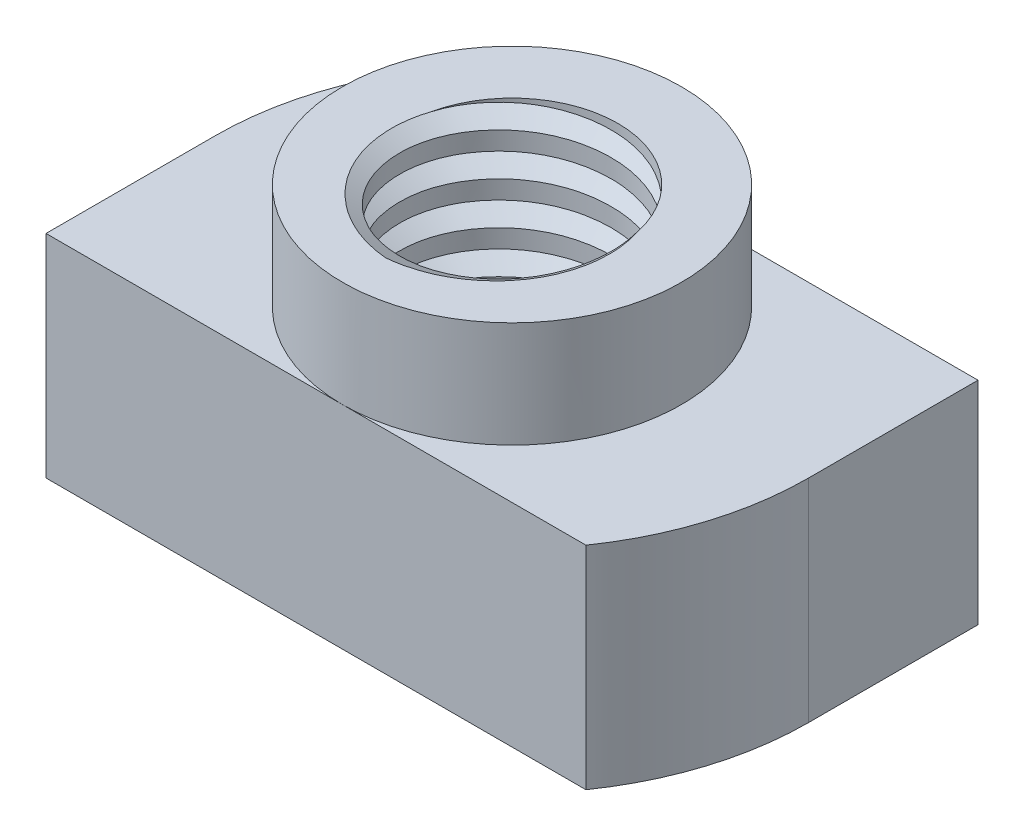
ISO-10303-21;
HEADER;
FILE_DESCRIPTION(('STEP AP214'),'2;1');
FILE_NAME('part.step','',(''),(''),'','','');
FILE_SCHEMA(('AUTOMOTIVE_DESIGN { 1 0 10303 214 1 1 1 1 }'));
ENDSEC;
DATA;
#1=APPLICATION_CONTEXT('core data for automotive mechanical design processes');
#2=APPLICATION_PROTOCOL_DEFINITION('international standard','automotive_design',2000,#1);
#3=PRODUCT_CONTEXT('',#1,'mechanical');
#4=PRODUCT('Part','Part','',(#3));
#5=PRODUCT_RELATED_PRODUCT_CATEGORY('part','',(#4));
#6=PRODUCT_DEFINITION_FORMATION('','',#4);
#7=PRODUCT_DEFINITION_CONTEXT('part definition',#1,'design');
#8=PRODUCT_DEFINITION('design','',#6,#7);
#9=PRODUCT_DEFINITION_SHAPE('','',#8);
#10=(LENGTH_UNIT() NAMED_UNIT(*) SI_UNIT(.MILLI.,.METRE.));
#11=(NAMED_UNIT(*) PLANE_ANGLE_UNIT() SI_UNIT($,.RADIAN.));
#12=(NAMED_UNIT(*) SI_UNIT($,.STERADIAN.) SOLID_ANGLE_UNIT());
#13=UNCERTAINTY_MEASURE_WITH_UNIT(LENGTH_MEASURE(1.E-05),#10,'distance_accuracy_value','');
#14=(GEOMETRIC_REPRESENTATION_CONTEXT(3) GLOBAL_UNCERTAINTY_ASSIGNED_CONTEXT((#13)) GLOBAL_UNIT_ASSIGNED_CONTEXT((#10,
#11,#12)) REPRESENTATION_CONTEXT('',''));
#15=CARTESIAN_POINT('',(0.,0.,0.));
#16=DIRECTION('',(0.,0.,1.));
#17=DIRECTION('',(1.,0.,0.));
#18=AXIS2_PLACEMENT_3D('',#15,#16,#17);
#19=CARTESIAN_POINT('',(-7.,0.,4.));
#20=DIRECTION('',(0.,1.,0.));
#21=DIRECTION('',(-1.,0.,0.));
#22=AXIS2_PLACEMENT_3D('',#19,#20,#21);
#23=PLANE('',#22);
#24=DIRECTION('',(0.,0.,-1.));
#25=VECTOR('',#24,1.);
#26=CARTESIAN_POINT('',(-7.,0.,4.));
#27=LINE('',#26,#25);
#28=CARTESIAN_POINT('',(-7.,0.,4.));
#29=VERTEX_POINT('',#28);
#30=CARTESIAN_POINT('',(-7.,0.,0.));
#31=VERTEX_POINT('',#30);
#32=EDGE_CURVE('E243',#29,#31,#27,.T.);
#33=ORIENTED_EDGE('',*,*,#32,.T.);
#34=CARTESIAN_POINT('',(0.,0.,0.));
#35=DIRECTION('',(0.,1.,0.));
#36=DIRECTION('',(-1.,0.,0.));
#37=AXIS2_PLACEMENT_3D('',#34,#35,#36);
#38=CIRCLE('',#37,7.);
#39=CARTESIAN_POINT('',(-5.74456264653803,0.,-4.));
#40=VERTEX_POINT('',#39);
#41=EDGE_CURVE('E207',#31,#40,#38,.F.);
#42=ORIENTED_EDGE('',*,*,#41,.T.);
#43=DIRECTION('',(1.,0.,0.));
#44=VECTOR('',#43,1.);
#45=CARTESIAN_POINT('',(-7.,0.,-4.));
#46=LINE('',#45,#44);
#47=CARTESIAN_POINT('',(7.,0.,-4.));
#48=VERTEX_POINT('',#47);
#49=EDGE_CURVE('E217',#40,#48,#46,.T.);
#50=ORIENTED_EDGE('',*,*,#49,.T.);
#51=DIRECTION('',(0.,0.,-1.));
#52=VECTOR('',#51,1.);
#53=CARTESIAN_POINT('',(7.,0.,4.));
#54=LINE('',#53,#52);
#55=CARTESIAN_POINT('',(7.,0.,0.));
#56=VERTEX_POINT('',#55);
#57=EDGE_CURVE('E240',#56,#48,#54,.T.);
#58=ORIENTED_EDGE('',*,*,#57,.F.);
#59=CARTESIAN_POINT('',(0.,0.,0.));
#60=DIRECTION('',(0.,1.,0.));
#61=DIRECTION('',(-1.,0.,0.));
#62=AXIS2_PLACEMENT_3D('',#59,#60,#61);
#63=CIRCLE('',#62,7.);
#64=CARTESIAN_POINT('',(5.74456264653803,0.,4.));
#65=VERTEX_POINT('',#64);
#66=EDGE_CURVE('E214',#56,#65,#63,.F.);
#67=ORIENTED_EDGE('',*,*,#66,.T.);
#68=DIRECTION('',(1.,0.,0.));
#69=VECTOR('',#68,1.);
#70=CARTESIAN_POINT('',(-7.,0.,4.));
#71=LINE('',#70,#69);
#72=EDGE_CURVE('E221',#29,#65,#71,.T.);
#73=ORIENTED_EDGE('',*,*,#72,.F.);
#74=EDGE_LOOP('',(#33,#42,#50,#58,#67,#73));
#75=FACE_BOUND('',#74,.T.);
#76=CARTESIAN_POINT('',(-6.85554040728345E-09,0.,-2.99069279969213));
#77=CARTESIAN_POINT('',(0.0805582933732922,0.,-2.98366195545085));
#78=CARTESIAN_POINT('',(0.160817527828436,0.,-2.97321749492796));
#79=CARTESIAN_POINT('',(0.320166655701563,0.,-2.94560946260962));
#80=CARTESIAN_POINT('',(0.399256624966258,0.,-2.92844632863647));
#81=CARTESIAN_POINT('',(0.555616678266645,0.,-2.88753167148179));
#82=CARTESIAN_POINT('',(0.632888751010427,0.,-2.8637877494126));
#83=CARTESIAN_POINT('',(0.785157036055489,0.,-2.80987081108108));
#84=CARTESIAN_POINT('',(0.860153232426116,0.,-2.77969774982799));
#85=CARTESIAN_POINT('',(1.00732306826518,0.,-2.7131386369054));
#86=CARTESIAN_POINT('',(1.0794971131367,0.,-2.67675348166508));
#87=CARTESIAN_POINT('',(1.2205190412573,0.,-2.59802543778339));
#88=CARTESIAN_POINT('',(1.28936692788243,0.,-2.55568255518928));
#89=CARTESIAN_POINT('',(1.42326888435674,0.,-2.46532228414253));
#90=CARTESIAN_POINT('',(1.4883215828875,0.,-2.41730286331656));
#91=CARTESIAN_POINT('',(1.61415318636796,0.,-2.31594506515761));
#92=CARTESIAN_POINT('',(1.67493155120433,0.,-2.26260601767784));
#93=CARTESIAN_POINT('',(1.79178818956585,0.,-2.1509488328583));
#94=CARTESIAN_POINT('',(1.84786452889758,0.,-2.09262866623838));
#95=CARTESIAN_POINT('',(1.92816403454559,0.,-2.00180762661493));
#96=CARTESIAN_POINT('',(1.95429595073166,0.,-1.97097547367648));
#97=CARTESIAN_POINT('',(2.00514658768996,0.,-1.90816668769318));
#98=CARTESIAN_POINT('',(2.02986534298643,0.,-1.87619008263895));
#99=CARTESIAN_POINT('',(2.10174837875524,0.,-1.77867134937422));
#100=CARTESIAN_POINT('',(2.14669733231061,0.,-1.71147513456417));
#101=CARTESIAN_POINT('',(2.23028688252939,0.,-1.57327597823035));
#102=CARTESIAN_POINT('',(2.26892720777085,0.,-1.50227287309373));
#103=CARTESIAN_POINT('',(2.33782965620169,0.,-1.36062616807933));
#104=CARTESIAN_POINT('',(2.36841124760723,0.,-1.29013790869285));
#105=CARTESIAN_POINT('',(2.42334642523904,0.,-1.14677579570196));
#106=CARTESIAN_POINT('',(2.44770011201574,0.,-1.07390198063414));
#107=CARTESIAN_POINT('',(2.49001369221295,0.,-0.926247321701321));
#108=CARTESIAN_POINT('',(2.50796757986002,0.,-0.851464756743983));
#109=CARTESIAN_POINT('',(2.53731214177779,0.,-0.70062350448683));
#110=CARTESIAN_POINT('',(2.54870289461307,0.,-0.624564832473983));
#111=CARTESIAN_POINT('',(2.56460886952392,0.,-0.473927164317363));
#112=CARTESIAN_POINT('',(2.56931099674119,0.,-0.399367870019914));
#113=CARTESIAN_POINT('',(2.57240231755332,0.,-0.250117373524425));
#114=CARTESIAN_POINT('',(2.57079114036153,0.,-0.175426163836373));
#115=CARTESIAN_POINT('',(2.56131612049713,0.,-0.0265128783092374));
#116=CARTESIAN_POINT('',(2.55345915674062,0.,0.0477096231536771));
#117=CARTESIAN_POINT('',(2.5309254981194,0.,0.195108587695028));
#118=CARTESIAN_POINT('',(2.51625017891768,0.,0.26828525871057));
#119=CARTESIAN_POINT('',(2.48081316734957,0.,0.410835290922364));
#120=CARTESIAN_POINT('',(2.46024532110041,0.,0.480257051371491));
#121=CARTESIAN_POINT('',(2.41300864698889,0.,0.617007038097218));
#122=CARTESIAN_POINT('',(2.38633891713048,0.,0.684334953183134));
#123=CARTESIAN_POINT('',(2.32709280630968,0.,0.816394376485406));
#124=CARTESIAN_POINT('',(2.29451238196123,0.,0.881124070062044));
#125=CARTESIAN_POINT('',(2.22371207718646,0.,1.00742153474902));
#126=CARTESIAN_POINT('',(2.18549235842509,0.,1.06898939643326));
#127=CARTESIAN_POINT('',(2.10591926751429,0.,1.18525376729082));
#128=CARTESIAN_POINT('',(2.06484519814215,0.,1.24014175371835));
#129=CARTESIAN_POINT('',(1.97820936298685,0.,1.34626872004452));
#130=CARTESIAN_POINT('',(1.93264702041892,0.,1.39750722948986));
#131=CARTESIAN_POINT('',(1.83739207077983,0.,1.49590910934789));
#132=CARTESIAN_POINT('',(1.78770256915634,0.,1.54307549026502));
#133=CARTESIAN_POINT('',(1.68456527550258,0.,1.63309737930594));
#134=CARTESIAN_POINT('',(1.63111818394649,0.,1.67595368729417));
#135=CARTESIAN_POINT('',(1.52089038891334,0.,1.75621720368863));
#136=CARTESIAN_POINT('',(1.46413869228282,0.,1.7936640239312));
#137=CARTESIAN_POINT('',(1.34747195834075,0.,1.8632103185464));
#138=CARTESIAN_POINT('',(1.2875566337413,0.,1.8953093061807));
#139=CARTESIAN_POINT('',(1.1037400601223,0.,1.98313890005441));
#140=CARTESIAN_POINT('',(0.975674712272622,0.,2.03047008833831));
#141=CARTESIAN_POINT('',(0.723717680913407,0.,2.09805598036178));
#142=CARTESIAN_POINT('',(0.600312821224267,0.,2.12017519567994));
#143=CARTESIAN_POINT('',(0.351715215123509,0.,2.14327448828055));
#144=CARTESIAN_POINT('',(0.226527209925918,0.,2.14430285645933));
#145=CARTESIAN_POINT('',(0.068111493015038,0.,2.13224966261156));
#146=CARTESIAN_POINT('',(0.0339987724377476,0.,2.12885504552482));
#147=CARTESIAN_POINT('',(4.87031009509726E-09,0.,2.12466739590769));
#148=B_SPLINE_CURVE_WITH_KNOTS('',3,(#76,#77,#78,#79,#80,#81,#82,#83,#84,#85,#86,#87,#88,#89,
#90,#91,#92,#93,#94,#95,#96,#97,#98,#99,#100,#101,#102,#103,#104,#105,#106,#107,#108,#109,#110,
#111,#112,#113,#114,#115,#116,#117,#118,#119,#120,#121,#122,#123,#124,#125,#126,#127,#128,#129,
#130,#131,#132,#133,#134,#135,#136,#137,#138,#139,#140,#141,#142,#143,#144,#145,#146,#147),
.UNSPECIFIED.,.F.,.F.,(4,2,2,2,2,2,2,2,2,2,2,2,2,2,2,2,2,2,2,2,2,2,2,2,2,2,2,2,2,2,2,2,2,2,2,4),
(0.,0.242520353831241,0.48502490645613,0.727250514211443,0.969477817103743,1.21167019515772,
1.45386232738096,1.69614143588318,1.93845110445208,2.18085996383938,2.30207688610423,
2.4232908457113,2.66545822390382,2.90763601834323,3.13785652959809,3.36807332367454,
3.59850559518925,3.82893510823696,4.05278980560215,4.27665765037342,4.50027927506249,
4.72385580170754,4.94078773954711,5.15775176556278,5.37486477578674,5.59197156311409,
5.79739538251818,6.00284563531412,6.20814267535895,6.41340154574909,6.6170715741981,
6.8207601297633,7.22779559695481,7.60224083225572,7.97582861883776,8.07863093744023),.UNSPECIFIED.);
#149=CARTESIAN_POINT('',(-6.8555323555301E-09,0.,-2.99069279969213));
#150=VERTEX_POINT('',#149);
#151=CARTESIAN_POINT('',(2.44352768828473,0.,0.528367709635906));
#152=VERTEX_POINT('',#151);
#153=EDGE_CURVE('E121',#150,#152,#148,.T.);
#154=ORIENTED_EDGE('',*,*,#153,.F.);
#155=CARTESIAN_POINT('',(4.87029469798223E-09,0.,2.12466739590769));
#156=CARTESIAN_POINT('',(-0.0618752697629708,0.,2.13227939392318));
#157=CARTESIAN_POINT('',(-0.124044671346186,0.,2.13727729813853));
#158=CARTESIAN_POINT('',(-0.248582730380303,0.,2.14202349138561));
#159=CARTESIAN_POINT('',(-0.310951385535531,0.,2.1417718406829));
#160=CARTESIAN_POINT('',(-0.497615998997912,0.,2.13311795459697));
#161=CARTESIAN_POINT('',(-0.62163046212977,0.,2.11683629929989));
#162=CARTESIAN_POINT('',(-0.865203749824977,0.,2.06363575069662));
#163=CARTESIAN_POINT('',(-0.984760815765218,0.,2.02670880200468));
#164=CARTESIAN_POINT('',(-1.1580386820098,0.,1.95675350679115));
#165=CARTESIAN_POINT('',(-1.21479349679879,0.,1.93100443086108));
#166=CARTESIAN_POINT('',(-1.32594350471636,0.,1.87482481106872));
#167=CARTESIAN_POINT('',(-1.38033902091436,0.,1.84439491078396));
#168=CARTESIAN_POINT('',(-1.4863395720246,0.,1.77910869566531));
#169=CARTESIAN_POINT('',(-1.53794696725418,0.,1.74425621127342));
#170=CARTESIAN_POINT('',(-1.63804531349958,0.,1.67032984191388));
#171=CARTESIAN_POINT('',(-1.68653577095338,0.,1.63125529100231));
#172=CARTESIAN_POINT('',(-1.7804638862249,0.,1.54950702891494));
#173=CARTESIAN_POINT('',(-1.82589833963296,0.,1.50682964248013));
#174=CARTESIAN_POINT('',(-1.91334344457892,0.,1.41811911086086));
#175=CARTESIAN_POINT('',(-1.95535422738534,0.,1.37208609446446));
#176=CARTESIAN_POINT('',(-2.08077861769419,0.,1.22356538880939));
#177=CARTESIAN_POINT('',(-2.1578546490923,0.,1.11560150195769));
#178=CARTESIAN_POINT('',(-2.29338011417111,0.,0.888686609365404));
#179=CARTESIAN_POINT('',(-2.35184517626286,0.,0.769744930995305));
#180=CARTESIAN_POINT('',(-2.42536977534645,0.,0.583333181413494));
#181=CARTESIAN_POINT('',(-2.44777090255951,0.,0.518672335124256));
#182=CARTESIAN_POINT('',(-2.48706165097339,0.,0.387691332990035));
#183=CARTESIAN_POINT('',(-2.50395183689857,0.,0.321371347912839));
#184=CARTESIAN_POINT('',(-2.53212147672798,0.,0.18748908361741));
#185=CARTESIAN_POINT('',(-2.54339643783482,0.,0.119925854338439));
#186=CARTESIAN_POINT('',(-2.55600330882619,0.,0.0180649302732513));
#187=CARTESIAN_POINT('',(-2.55948818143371,0.,-0.0159792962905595));
#188=CARTESIAN_POINT('',(-2.56514874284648,0.,-0.0841822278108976));
#189=CARTESIAN_POINT('',(-2.56732416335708,0.,-0.118340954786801));
#190=CARTESIAN_POINT('',(-2.57190450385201,0.,-0.221873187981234));
#191=CARTESIAN_POINT('',(-2.572246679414,0.,-0.291351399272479));
#192=CARTESIAN_POINT('',(-2.56748442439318,0.,-0.430116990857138));
#193=CARTESIAN_POINT('',(-2.5623785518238,0.,-0.499404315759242));
#194=CARTESIAN_POINT('',(-2.53891968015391,0.,-0.706285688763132));
#195=CARTESIAN_POINT('',(-2.51243150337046,0.,-0.843039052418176));
#196=CARTESIAN_POINT('',(-2.43561112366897,0.,-1.1206083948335));
#197=CARTESIAN_POINT('',(-2.38366598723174,0.,-1.26098138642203));
#198=CARTESIAN_POINT('',(-2.28872040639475,0.,-1.46338739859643));
#199=CARTESIAN_POINT('',(-2.25421547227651,0.,-1.52952372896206));
#200=CARTESIAN_POINT('',(-2.17978842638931,0.,-1.65867145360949));
#201=CARTESIAN_POINT('',(-2.13986655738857,0.,-1.72168298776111));
#202=CARTESIAN_POINT('',(-2.01238034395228,0.,-1.90512241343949));
#203=CARTESIAN_POINT('',(-1.9169672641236,0.,-2.02022846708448));
#204=CARTESIAN_POINT('',(-1.76162030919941,0.,-2.18074221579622));
#205=CARTESIAN_POINT('',(-1.70775554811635,0.,-2.2322563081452));
#206=CARTESIAN_POINT('',(-1.59617222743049,0.,-2.33093685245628));
#207=CARTESIAN_POINT('',(-1.53845399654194,0.,-2.37810367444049));
#208=CARTESIAN_POINT('',(-1.35278913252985,0.,-2.51810852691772));
#209=CARTESIAN_POINT('',(-1.21862811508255,0.,-2.60289195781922));
#210=CARTESIAN_POINT('',(-0.938305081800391,0.,-2.74912717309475));
#211=CARTESIAN_POINT('',(-0.792152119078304,0.,-2.81059636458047));
#212=CARTESIAN_POINT('',(-0.537913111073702,0.,-2.89362971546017));
#213=CARTESIAN_POINT('',(-0.431892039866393,0.,-2.92165032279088));
#214=CARTESIAN_POINT('',(-0.217441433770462,0.,-2.96542379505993));
#215=CARTESIAN_POINT('',(-0.109014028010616,0.,-2.98118709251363));
#216=CARTESIAN_POINT('',(-6.85554080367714E-09,0.,-2.99069279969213));
#217=B_SPLINE_CURVE_WITH_KNOTS('',3,(#155,#156,#157,#158,#159,#160,#161,#162,#163,#164,#165,
#166,#167,#168,#169,#170,#171,#172,#173,#174,#175,#176,#177,#178,#179,#180,#181,#182,#183,#184,
#185,#186,#187,#188,#189,#190,#191,#192,#193,#194,#195,#196,#197,#198,#199,#200,#201,#202,#203,
#204,#205,#206,#207,#208,#209,#210,#211,#212,#213,#214,#215,#216),.UNSPECIFIED.,.F.,.F.,(4,2,2,
2,2,2,2,2,2,2,2,2,2,2,2,2,2,2,2,2,2,2,2,2,2,2,2,2,2,2,4),(0.,0.186915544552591,
0.373828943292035,0.747178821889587,1.12067447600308,1.30745810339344,1.49421607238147,
1.68081337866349,1.86744015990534,2.05425967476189,2.24107202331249,2.63715111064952,
3.03289671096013,3.23798357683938,3.44304942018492,3.64827907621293,3.7509212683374,
3.85358448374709,4.06177871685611,4.27002806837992,4.68611128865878,5.13284949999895,
5.35641015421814,5.57996079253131,6.02616812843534,6.24960389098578,6.47302061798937,
6.94681407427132,7.42025308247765,7.74855964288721,8.07658646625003),.UNSPECIFIED.);
#218=CARTESIAN_POINT('',(-2.44352768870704,0.,0.528367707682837));
#219=VERTEX_POINT('',#218);
#220=EDGE_CURVE('E122',#219,#150,#217,.T.);
#221=ORIENTED_EDGE('',*,*,#220,.F.);
#222=CARTESIAN_POINT('',(0.,0.,0.));
#223=DIRECTION('',(0.,1.,0.));
#224=DIRECTION('',(-1.,0.,0.));
#225=AXIS2_PLACEMENT_3D('',#222,#223,#224);
#226=CIRCLE('',#225,2.5);
#227=EDGE_CURVE('E192',#219,#152,#226,.T.);
#228=ORIENTED_EDGE('',*,*,#227,.T.);
#229=EDGE_LOOP('',(#154,#221,#228));
#230=FACE_BOUND('',#229,.T.);
#231=ADVANCED_FACE('F33',(#75,#230),#23,.F.);
#232=CARTESIAN_POINT('',(0.,7.5,0.));
#233=DIRECTION('',(0.,1.,0.));
#234=DIRECTION('',(-1.,0.,0.));
#235=AXIS2_PLACEMENT_3D('',#232,#233,#234);
#236=PLANE('',#235);
#237=CARTESIAN_POINT('',(0.,7.5,0.));
#238=DIRECTION('',(0.,1.,0.));
#239=DIRECTION('',(-1.,0.,0.));
#240=AXIS2_PLACEMENT_3D('',#237,#238,#239);
#241=CIRCLE('',#240,4.);
#242=CARTESIAN_POINT('',(-4.,7.5,0.));
#243=VERTEX_POINT('',#242);
#244=EDGE_CURVE('E197',#243,#243,#241,.T.);
#245=ORIENTED_EDGE('',*,*,#244,.T.);
#246=EDGE_LOOP('',(#245));
#247=FACE_BOUND('',#246,.T.);
#248=CARTESIAN_POINT('',(-4.87057700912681E-09,7.5,-2.12466739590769));
#249=CARTESIAN_POINT('',(0.0618752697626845,7.5,-2.13227939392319));
#250=CARTESIAN_POINT('',(0.124044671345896,7.5,-2.13727729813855));
#251=CARTESIAN_POINT('',(0.248582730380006,7.5,-2.14202349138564));
#252=CARTESIAN_POINT('',(0.31095138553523,7.5,-2.14177184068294));
#253=CARTESIAN_POINT('',(0.497615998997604,7.5,-2.13311795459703));
#254=CARTESIAN_POINT('',(0.621630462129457,7.5,-2.11683629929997));
#255=CARTESIAN_POINT('',(0.865203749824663,7.5,-2.06363575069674));
#256=CARTESIAN_POINT('',(0.984760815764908,7.50000000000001,-2.02670880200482));
#257=CARTESIAN_POINT('',(1.1580386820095,7.5,-1.95675350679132));
#258=CARTESIAN_POINT('',(1.21479349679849,7.49999999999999,-1.93100443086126));
#259=CARTESIAN_POINT('',(1.32594350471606,7.50000000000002,-1.87482481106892));
#260=CARTESIAN_POINT('',(1.38033902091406,7.50000000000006,-1.84439491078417));
#261=CARTESIAN_POINT('',(1.48633957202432,7.50000000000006,-1.77910869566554));
#262=CARTESIAN_POINT('',(1.53794696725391,7.50000000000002,-1.74425621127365));
#263=CARTESIAN_POINT('',(1.63804531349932,7.49999999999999,-1.67032984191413));
#264=CARTESIAN_POINT('',(1.68653577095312,7.49999999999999,-1.63125529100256));
#265=CARTESIAN_POINT('',(1.78046388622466,7.50000000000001,-1.5495070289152));
#266=CARTESIAN_POINT('',(1.82589833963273,7.50000000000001,-1.5068296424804));
#267=CARTESIAN_POINT('',(1.9133434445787,7.49999999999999,-1.41811911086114));
#268=CARTESIAN_POINT('',(1.95535422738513,7.49999999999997,-1.37208609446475));
#269=CARTESIAN_POINT('',(2.080778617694,7.49999999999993,-1.2235653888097));
#270=CARTESIAN_POINT('',(2.15785464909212,7.49999999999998,-1.11560150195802));
#271=CARTESIAN_POINT('',(2.29338011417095,7.50000000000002,-0.888686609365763));
#272=CARTESIAN_POINT('',(2.35184517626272,7.50000000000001,-0.769744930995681));
#273=CARTESIAN_POINT('',(2.42536977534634,7.5,-0.583333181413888));
#274=CARTESIAN_POINT('',(2.44777090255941,7.5,-0.518672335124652));
#275=CARTESIAN_POINT('',(2.48706165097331,7.5,-0.387691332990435));
#276=CARTESIAN_POINT('',(2.50395183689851,7.5,-0.321371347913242));
#277=CARTESIAN_POINT('',(2.53212147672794,7.5,-0.187489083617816));
#278=CARTESIAN_POINT('',(2.5433964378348,7.5,-0.119925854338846));
#279=CARTESIAN_POINT('',(2.55600330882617,7.5,-0.0180649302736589));
#280=CARTESIAN_POINT('',(2.5594881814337,7.5,0.0159792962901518));
#281=CARTESIAN_POINT('',(2.56514874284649,7.5,0.0841822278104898));
#282=CARTESIAN_POINT('',(2.56732416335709,7.5,0.118340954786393));
#283=CARTESIAN_POINT('',(2.57190450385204,7.5,0.221873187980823));
#284=CARTESIAN_POINT('',(2.57224667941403,7.5,0.291351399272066));
#285=CARTESIAN_POINT('',(2.56748442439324,7.5,0.43011699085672));
#286=CARTESIAN_POINT('',(2.56237855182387,7.5,0.499404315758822));
#287=CARTESIAN_POINT('',(2.53891968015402,7.5,0.706285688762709));
#288=CARTESIAN_POINT('',(2.51243150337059,7.50000000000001,0.843039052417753));
#289=CARTESIAN_POINT('',(2.43561112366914,7.50000000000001,1.12060839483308));
#290=CARTESIAN_POINT('',(2.38366598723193,7.5,1.26098138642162));
#291=CARTESIAN_POINT('',(2.28872040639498,7.5,1.46338739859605));
#292=CARTESIAN_POINT('',(2.25421547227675,7.5,1.52952372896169));
#293=CARTESIAN_POINT('',(2.17978842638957,7.5,1.65867145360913));
#294=CARTESIAN_POINT('',(2.13986655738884,7.5,1.72168298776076));
#295=CARTESIAN_POINT('',(2.01238034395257,7.5,1.90512241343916));
#296=CARTESIAN_POINT('',(1.91696726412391,7.5,2.02022846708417));
#297=CARTESIAN_POINT('',(1.76162030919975,7.5,2.18074221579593));
#298=CARTESIAN_POINT('',(1.70775554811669,7.5,2.23225630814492));
#299=CARTESIAN_POINT('',(1.59617222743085,7.5,2.33093685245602));
#300=CARTESIAN_POINT('',(1.53845399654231,7.5,2.37810367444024));
#301=CARTESIAN_POINT('',(1.35278913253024,7.5,2.51810852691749));
#302=CARTESIAN_POINT('',(1.21862811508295,7.5,2.60289195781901));
#303=CARTESIAN_POINT('',(0.938305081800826,7.5,2.74912717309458));
#304=CARTESIAN_POINT('',(0.792152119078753,7.50000000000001,2.81059636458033));
#305=CARTESIAN_POINT('',(0.537913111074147,7.50000000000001,2.89362971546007));
#306=CARTESIAN_POINT('',(0.431892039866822,7.5,2.92165032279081));
#307=CARTESIAN_POINT('',(0.217441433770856,7.5,2.9654237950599));
#308=CARTESIAN_POINT('',(0.109014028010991,7.5,2.98118709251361));
#309=CARTESIAN_POINT('',(6.85589647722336E-09,7.5,2.99069279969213));
#310=B_SPLINE_CURVE_WITH_KNOTS('',3,(#248,#249,#250,#251,#252,#253,#254,#255,#256,#257,#258,
#259,#260,#261,#262,#263,#264,#265,#266,#267,#268,#269,#270,#271,#272,#273,#274,#275,#276,#277,
#278,#279,#280,#281,#282,#283,#284,#285,#286,#287,#288,#289,#290,#291,#292,#293,#294,#295,#296,
#297,#298,#299,#300,#301,#302,#303,#304,#305,#306,#307,#308,#309),.UNSPECIFIED.,.F.,.F.,(4,2,2,
2,2,2,2,2,2,2,2,2,2,2,2,2,2,2,2,2,2,2,2,2,2,2,2,2,2,2,4),(0.,0.186915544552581,
0.373828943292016,0.74717882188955,1.12067447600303,1.30745810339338,1.49421607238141,
1.68081337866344,1.86744015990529,2.05425967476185,2.24107202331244,2.63715111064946,
3.03289671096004,3.2379835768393,3.44304942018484,3.64827907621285,3.75092126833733,
3.85358448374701,4.06177871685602,4.27002806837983,4.68611128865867,5.13284949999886,
5.35641015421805,5.57996079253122,6.02616812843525,6.2496038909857,6.47302061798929,
6.94681407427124,7.42025308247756,7.74855964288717,8.07658646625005),.UNSPECIFIED.);
#311=CARTESIAN_POINT('',(2.44352768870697,7.50000000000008,-0.528367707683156));
#312=VERTEX_POINT('',#311);
#313=CARTESIAN_POINT('',(6.85588262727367E-09,7.5,2.99069279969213));
#314=VERTEX_POINT('',#313);
#315=EDGE_CURVE('E50',#312,#314,#310,.T.);
#316=ORIENTED_EDGE('',*,*,#315,.T.);
#317=CARTESIAN_POINT('',(6.85589595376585E-09,7.5,2.99069279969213));
#318=CARTESIAN_POINT('',(-0.0805582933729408,7.5,2.98366195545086));
#319=CARTESIAN_POINT('',(-0.160817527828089,7.5,2.97321749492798));
#320=CARTESIAN_POINT('',(-0.320166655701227,7.5,2.94560946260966));
#321=CARTESIAN_POINT('',(-0.399256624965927,7.5,2.92844632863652));
#322=CARTESIAN_POINT('',(-0.555616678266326,7.5,2.88753167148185));
#323=CARTESIAN_POINT('',(-0.632888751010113,7.5,2.86378774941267));
#324=CARTESIAN_POINT('',(-0.785157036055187,7.5,2.80987081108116));
#325=CARTESIAN_POINT('',(-0.860153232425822,7.5,2.77969774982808));
#326=CARTESIAN_POINT('',(-1.00732306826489,7.5,2.7131386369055));
#327=CARTESIAN_POINT('',(-1.07949711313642,7.5,2.67675348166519));
#328=CARTESIAN_POINT('',(-1.22051904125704,7.5,2.59802543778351));
#329=CARTESIAN_POINT('',(-1.28936692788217,7.5,2.55568255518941));
#330=CARTESIAN_POINT('',(-1.42326888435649,7.5,2.46532228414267));
#331=CARTESIAN_POINT('',(-1.48832158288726,7.5,2.41730286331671));
#332=CARTESIAN_POINT('',(-1.61415318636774,7.5,2.31594506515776));
#333=CARTESIAN_POINT('',(-1.67493155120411,7.5,2.26260601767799));
#334=CARTESIAN_POINT('',(-1.79178818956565,7.5,2.15094883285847));
#335=CARTESIAN_POINT('',(-1.84786452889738,7.5,2.09262866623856));
#336=CARTESIAN_POINT('',(-1.92816403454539,7.5,2.00180762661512));
#337=CARTESIAN_POINT('',(-1.95429595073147,7.5,1.97097547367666));
#338=CARTESIAN_POINT('',(-2.00514658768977,7.5,1.90816668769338));
#339=CARTESIAN_POINT('',(-2.02986534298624,7.5,1.87619008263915));
#340=CARTESIAN_POINT('',(-2.10174837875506,7.5,1.77867134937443));
#341=CARTESIAN_POINT('',(-2.14669733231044,7.5,1.71147513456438));
#342=CARTESIAN_POINT('',(-2.23028688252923,7.5,1.57327597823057));
#343=CARTESIAN_POINT('',(-2.26892720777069,7.5,1.50227287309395));
#344=CARTESIAN_POINT('',(-2.33782965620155,7.5,1.36062616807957));
#345=CARTESIAN_POINT('',(-2.3684112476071,7.5,1.29013790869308));
#346=CARTESIAN_POINT('',(-2.42334642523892,7.5,1.14677579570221));
#347=CARTESIAN_POINT('',(-2.44770011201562,7.5,1.07390198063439));
#348=CARTESIAN_POINT('',(-2.49001369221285,7.5,0.926247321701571));
#349=CARTESIAN_POINT('',(-2.50796757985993,7.5,0.851464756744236));
#350=CARTESIAN_POINT('',(-2.53731214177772,7.5,0.700623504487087));
#351=CARTESIAN_POINT('',(-2.548702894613,7.5,0.624564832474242));
#352=CARTESIAN_POINT('',(-2.56460886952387,7.5,0.473927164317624));
#353=CARTESIAN_POINT('',(-2.56931099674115,7.5,0.399367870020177));
#354=CARTESIAN_POINT('',(-2.57240231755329,7.5,0.250117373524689));
#355=CARTESIAN_POINT('',(-2.57079114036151,7.5,0.175426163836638));
#356=CARTESIAN_POINT('',(-2.56131612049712,7.5,0.0265128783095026));
#357=CARTESIAN_POINT('',(-2.55345915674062,7.5,-0.0477096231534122));
#358=CARTESIAN_POINT('',(-2.53092549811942,7.5,-0.195108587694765));
#359=CARTESIAN_POINT('',(-2.51625017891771,7.5,-0.268285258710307));
#360=CARTESIAN_POINT('',(-2.48081316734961,7.5,-0.410835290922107));
#361=CARTESIAN_POINT('',(-2.46024532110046,7.5,-0.480257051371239));
#362=CARTESIAN_POINT('',(-2.41300864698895,7.5,-0.617007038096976));
#363=CARTESIAN_POINT('',(-2.38633891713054,7.5,-0.684334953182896));
#364=CARTESIAN_POINT('',(-2.32709280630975,7.5,-0.816394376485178));
#365=CARTESIAN_POINT('',(-2.29451238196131,7.5,-0.881124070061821));
#366=CARTESIAN_POINT('',(-2.22371207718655,7.5,-1.00742153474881));
#367=CARTESIAN_POINT('',(-2.18549235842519,7.50000000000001,-1.06898939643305));
#368=CARTESIAN_POINT('',(-2.10591926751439,7.50000000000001,-1.18525376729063));
#369=CARTESIAN_POINT('',(-2.06484519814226,7.5,-1.24014175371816));
#370=CARTESIAN_POINT('',(-1.97820936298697,7.5,-1.34626872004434));
#371=CARTESIAN_POINT('',(-1.93264702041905,7.5,-1.39750722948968));
#372=CARTESIAN_POINT('',(-1.83739207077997,7.5,-1.49590910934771));
#373=CARTESIAN_POINT('',(-1.78770256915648,7.5,-1.54307549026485));
#374=CARTESIAN_POINT('',(-1.68456527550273,7.5,-1.63309737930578));
#375=CARTESIAN_POINT('',(-1.63111818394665,7.5,-1.67595368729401));
#376=CARTESIAN_POINT('',(-1.52089038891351,7.5,-1.75621720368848));
#377=CARTESIAN_POINT('',(-1.46413869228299,7.5,-1.79366402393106));
#378=CARTESIAN_POINT('',(-1.34747195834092,7.5,-1.86321031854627));
#379=CARTESIAN_POINT('',(-1.28755663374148,7.5,-1.89530930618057));
#380=CARTESIAN_POINT('',(-1.10374006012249,7.5,-1.9831389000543));
#381=CARTESIAN_POINT('',(-0.975674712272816,7.5,-2.03047008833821));
#382=CARTESIAN_POINT('',(-0.723717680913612,7.5,-2.09805598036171));
#383=CARTESIAN_POINT('',(-0.600312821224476,7.5,-2.12017519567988));
#384=CARTESIAN_POINT('',(-0.351715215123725,7.5,-2.14327448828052));
#385=CARTESIAN_POINT('',(-0.226527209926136,7.5,-2.1443028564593));
#386=CARTESIAN_POINT('',(-0.0681114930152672,7.5,-2.13224966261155));
#387=CARTESIAN_POINT('',(-0.0339987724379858,7.5,-2.12885504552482));
#388=CARTESIAN_POINT('',(-4.87055727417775E-09,7.5,-2.12466739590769));
#389=B_SPLINE_CURVE_WITH_KNOTS('',3,(#317,#318,#319,#320,#321,#322,#323,#324,#325,#326,#327,
#328,#329,#330,#331,#332,#333,#334,#335,#336,#337,#338,#339,#340,#341,#342,#343,#344,#345,#346,
#347,#348,#349,#350,#351,#352,#353,#354,#355,#356,#357,#358,#359,#360,#361,#362,#363,#364,#365,
#366,#367,#368,#369,#370,#371,#372,#373,#374,#375,#376,#377,#378,#379,#380,#381,#382,#383,#384,
#385,#386,#387,#388),.UNSPECIFIED.,.F.,.F.,(4,2,2,2,2,2,2,2,2,2,2,2,2,2,2,2,2,2,2,2,2,2,2,2,2,2,
2,2,2,2,2,2,2,2,2,4),(0.,0.242520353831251,0.48502490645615,0.727250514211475,0.969477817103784,
1.21167019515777,1.45386232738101,1.69614143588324,1.93845110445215,2.18085996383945,
2.3020768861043,2.42329084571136,2.66545822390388,2.90763601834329,3.13785652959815,
3.3680733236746,3.5985055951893,3.82893510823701,4.0527898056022,4.27665765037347,
4.50027927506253,4.72385580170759,4.94078773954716,5.15775176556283,5.37486477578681,
5.59197156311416,5.79739538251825,6.00284563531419,6.20814267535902,6.41340154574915,
6.61707157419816,6.82076012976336,7.22779559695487,7.60224083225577,7.9758286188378,
8.07863093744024),.UNSPECIFIED.);
#390=CARTESIAN_POINT('',(-2.44352768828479,7.49999999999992,-0.528367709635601));
#391=VERTEX_POINT('',#390);
#392=EDGE_CURVE('E113',#314,#391,#389,.T.);
#393=ORIENTED_EDGE('',*,*,#392,.T.);
#394=CARTESIAN_POINT('',(0.,7.5,0.));
#395=DIRECTION('',(0.,1.,0.));
#396=DIRECTION('',(-1.,0.,0.));
#397=AXIS2_PLACEMENT_3D('',#394,#395,#396);
#398=CIRCLE('',#397,2.5);
#399=EDGE_CURVE('E128',#312,#391,#398,.T.);
#400=ORIENTED_EDGE('',*,*,#399,.F.);
#401=EDGE_LOOP('',(#316,#393,#400));
#402=FACE_BOUND('',#401,.T.);
#403=ADVANCED_FACE('F127',(#247,#402),#236,.T.);
#404=CARTESIAN_POINT('',(0.,0.,0.));
#405=DIRECTION('',(0.,1.,0.));
#406=DIRECTION('',(-1.,0.,0.));
#407=AXIS2_PLACEMENT_3D('',#404,#405,#406);
#408=CYLINDRICAL_SURFACE('',#407,2.5);
#409=CARTESIAN_POINT('',(-1.76776687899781,8.40830161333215,-1.76776702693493));
#410=CARTESIAN_POINT('',(-1.03553380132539,8.34580161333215,-2.50000004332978));
#411=CARTESIAN_POINT('',(1.04607342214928E-07,8.28330161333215,-2.5));
#412=CARTESIAN_POINT('',(1.03553401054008,8.22080161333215,-2.49999995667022));
#413=CARTESIAN_POINT('',(1.76776702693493,8.15830161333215,-1.76776687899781));
#414=CARTESIAN_POINT('',(2.50000004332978,8.09580161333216,-1.03553380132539));
#415=CARTESIAN_POINT('',(2.5,8.03330161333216,1.04607343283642E-07));
#416=CARTESIAN_POINT('',(2.49999995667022,7.97080161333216,1.03553401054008));
#417=CARTESIAN_POINT('',(1.7677668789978,7.90830161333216,1.76776702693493));
#418=CARTESIAN_POINT('',(1.03553380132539,7.84580161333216,2.50000004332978));
#419=CARTESIAN_POINT('',(-1.04607344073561E-07,7.78330161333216,2.5));
#420=CARTESIAN_POINT('',(-1.03553401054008,7.72080161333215,2.49999995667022));
#421=CARTESIAN_POINT('',(-1.76776702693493,7.65830161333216,1.76776687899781));
#422=CARTESIAN_POINT('',(-2.50000004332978,7.59580161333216,1.03553380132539));
#423=CARTESIAN_POINT('',(-2.5,7.53330161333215,-1.04607342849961E-07));
#424=CARTESIAN_POINT('',(-2.49999995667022,7.47080161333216,-1.03553401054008));
#425=CARTESIAN_POINT('',(-1.76776687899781,7.40830161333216,-1.76776702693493));
#426=CARTESIAN_POINT('',(-1.03553380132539,7.34580161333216,-2.50000004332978));
#427=CARTESIAN_POINT('',(1.04607342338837E-07,7.28330161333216,-2.5));
#428=CARTESIAN_POINT('',(1.03553401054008,7.22080161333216,-2.49999995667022));
#429=CARTESIAN_POINT('',(1.76776702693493,7.15830161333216,-1.76776687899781));
#430=CARTESIAN_POINT('',(2.50000004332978,7.09580161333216,-1.03553380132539));
#431=CARTESIAN_POINT('',(2.5,7.03330161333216,1.04607343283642E-07));
#432=CARTESIAN_POINT('',(2.49999995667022,6.97080161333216,1.03553401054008));
#433=CARTESIAN_POINT('',(1.7677668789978,6.90830161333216,1.76776702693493));
#434=CARTESIAN_POINT('',(1.03553380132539,6.84580161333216,2.50000004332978));
#435=CARTESIAN_POINT('',(-1.04607343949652E-07,6.78330161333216,2.5));
#436=CARTESIAN_POINT('',(-1.03553401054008,6.72080161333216,2.49999995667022));
#437=CARTESIAN_POINT('',(-1.76776702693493,6.65830161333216,1.76776687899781));
#438=CARTESIAN_POINT('',(-2.50000004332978,6.59580161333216,1.03553380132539));
#439=CARTESIAN_POINT('',(-2.5,6.53330161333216,-1.04607342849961E-07));
#440=CARTESIAN_POINT('',(-2.49999995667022,6.47080161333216,-1.03553401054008));
#441=CARTESIAN_POINT('',(-1.76776687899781,6.40830161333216,-1.76776702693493));
#442=CARTESIAN_POINT('',(-1.03553380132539,6.34580161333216,-2.50000004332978));
#443=CARTESIAN_POINT('',(1.04607342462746E-07,6.28330161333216,-2.5));
#444=CARTESIAN_POINT('',(1.03553401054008,6.22080161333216,-2.49999995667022));
#445=CARTESIAN_POINT('',(1.76776702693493,6.15830161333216,-1.76776687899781));
#446=CARTESIAN_POINT('',(2.50000004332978,6.09580161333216,-1.03553380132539));
#447=CARTESIAN_POINT('',(2.5,6.03330161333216,1.04607343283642E-07));
#448=CARTESIAN_POINT('',(2.49999995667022,5.97080161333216,1.03553401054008));
#449=CARTESIAN_POINT('',(1.76776687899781,5.90830161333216,1.76776702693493));
#450=CARTESIAN_POINT('',(1.03553380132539,5.84580161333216,2.50000004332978));
#451=CARTESIAN_POINT('',(-1.04607343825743E-07,5.78330161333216,2.5));
#452=CARTESIAN_POINT('',(-1.03553401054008,5.72080161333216,2.49999995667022));
#453=CARTESIAN_POINT('',(-1.76776702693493,5.65830161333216,1.76776687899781));
#454=CARTESIAN_POINT('',(-2.50000004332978,5.59580161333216,1.03553380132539));
#455=CARTESIAN_POINT('',(-2.5,5.53330161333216,-1.04607342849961E-07));
#456=CARTESIAN_POINT('',(-2.49999995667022,5.47080161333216,-1.03553401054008));
#457=CARTESIAN_POINT('',(-1.76776687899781,5.40830161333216,-1.76776702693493));
#458=CARTESIAN_POINT('',(-1.03553380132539,5.34580161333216,-2.50000004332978));
#459=CARTESIAN_POINT('',(1.04607342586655E-07,5.28330161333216,-2.5));
#460=CARTESIAN_POINT('',(1.03553401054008,5.22080161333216,-2.49999995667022));
#461=CARTESIAN_POINT('',(1.76776702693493,5.15830161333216,-1.76776687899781));
#462=CARTESIAN_POINT('',(2.50000004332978,5.09580161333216,-1.03553380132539));
#463=CARTESIAN_POINT('',(2.5,5.03330161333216,1.04607343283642E-07));
#464=CARTESIAN_POINT('',(2.49999995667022,4.97080161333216,1.03553401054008));
#465=CARTESIAN_POINT('',(1.76776687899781,4.90830161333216,1.76776702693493));
#466=CARTESIAN_POINT('',(1.03553380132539,4.84580161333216,2.50000004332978));
#467=CARTESIAN_POINT('',(-1.04607343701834E-07,4.78330161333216,2.5));
#468=CARTESIAN_POINT('',(-1.03553401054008,4.72080161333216,2.49999995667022));
#469=CARTESIAN_POINT('',(-1.76776702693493,4.65830161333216,1.76776687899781));
#470=CARTESIAN_POINT('',(-2.50000004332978,4.59580161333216,1.03553380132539));
#471=CARTESIAN_POINT('',(-2.5,4.53330161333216,-1.04607342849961E-07));
#472=CARTESIAN_POINT('',(-2.49999995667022,4.47080161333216,-1.03553401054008));
#473=CARTESIAN_POINT('',(-1.76776687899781,4.40830161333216,-1.76776702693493));
#474=CARTESIAN_POINT('',(-1.03553380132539,4.34580161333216,-2.50000004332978));
#475=CARTESIAN_POINT('',(1.04607342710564E-07,4.28330161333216,-2.5));
#476=CARTESIAN_POINT('',(1.03553401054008,4.22080161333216,-2.49999995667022));
#477=CARTESIAN_POINT('',(1.76776702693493,4.15830161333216,-1.76776687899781));
#478=CARTESIAN_POINT('',(2.50000004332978,4.09580161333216,-1.03553380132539));
#479=CARTESIAN_POINT('',(2.5,4.03330161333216,1.04607343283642E-07));
#480=CARTESIAN_POINT('',(2.49999995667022,3.97080161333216,1.03553401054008));
#481=CARTESIAN_POINT('',(1.76776687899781,3.90830161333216,1.76776702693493));
#482=CARTESIAN_POINT('',(1.03553380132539,3.84580161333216,2.50000004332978));
#483=CARTESIAN_POINT('',(-1.04607343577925E-07,3.78330161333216,2.5));
#484=CARTESIAN_POINT('',(-1.03553401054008,3.72080161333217,2.49999995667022));
#485=CARTESIAN_POINT('',(-1.76776702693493,3.65830161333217,1.76776687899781));
#486=CARTESIAN_POINT('',(-2.50000004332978,3.59580161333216,1.03553380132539));
#487=CARTESIAN_POINT('',(-2.5,3.53330161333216,-1.04607342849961E-07));
#488=CARTESIAN_POINT('',(-2.49999995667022,3.47080161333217,-1.03553401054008));
#489=CARTESIAN_POINT('',(-1.76776687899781,3.40830161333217,-1.76776702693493));
#490=CARTESIAN_POINT('',(-1.03553380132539,3.34580161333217,-2.50000004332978));
#491=CARTESIAN_POINT('',(1.04607342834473E-07,3.28330161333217,-2.5));
#492=CARTESIAN_POINT('',(1.03553401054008,3.22080161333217,-2.49999995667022));
#493=CARTESIAN_POINT('',(1.76776702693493,3.15830161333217,-1.76776687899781));
#494=CARTESIAN_POINT('',(2.50000004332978,3.09580161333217,-1.03553380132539));
#495=CARTESIAN_POINT('',(2.5,3.03330161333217,1.04607343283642E-07));
#496=CARTESIAN_POINT('',(2.49999995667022,2.97080161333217,1.03553401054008));
#497=CARTESIAN_POINT('',(1.76776687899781,2.90830161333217,1.76776702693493));
#498=CARTESIAN_POINT('',(1.03553380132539,2.84580161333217,2.50000004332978));
#499=CARTESIAN_POINT('',(-1.04607343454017E-07,2.78330161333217,2.5));
#500=CARTESIAN_POINT('',(-1.03553401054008,2.72080161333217,2.49999995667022));
#501=CARTESIAN_POINT('',(-1.76776702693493,2.65830161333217,1.76776687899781));
#502=CARTESIAN_POINT('',(-2.50000004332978,2.59580161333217,1.03553380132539));
#503=CARTESIAN_POINT('',(-2.5,2.53330161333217,-1.04607342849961E-07));
#504=CARTESIAN_POINT('',(-2.49999995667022,2.47080161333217,-1.03553401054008));
#505=CARTESIAN_POINT('',(-1.76776687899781,2.40830161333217,-1.76776702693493));
#506=CARTESIAN_POINT('',(-1.03553380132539,2.34580161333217,-2.50000004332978));
#507=CARTESIAN_POINT('',(1.04607342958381E-07,2.28330161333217,-2.5));
#508=CARTESIAN_POINT('',(1.03553401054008,2.22080161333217,-2.49999995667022));
#509=CARTESIAN_POINT('',(1.76776702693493,2.15830161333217,-1.76776687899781));
#510=CARTESIAN_POINT('',(2.50000004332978,2.09580161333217,-1.03553380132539));
#511=CARTESIAN_POINT('',(2.5,2.03330161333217,1.04607343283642E-07));
#512=CARTESIAN_POINT('',(2.49999995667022,1.97080161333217,1.03553401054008));
#513=CARTESIAN_POINT('',(1.76776687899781,1.90830161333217,1.76776702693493));
#514=CARTESIAN_POINT('',(1.03553380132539,1.84580161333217,2.50000004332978));
#515=CARTESIAN_POINT('',(-1.04607343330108E-07,1.78330161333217,2.5));
#516=CARTESIAN_POINT('',(-1.03553401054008,1.72080161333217,2.49999995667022));
#517=CARTESIAN_POINT('',(-1.76776702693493,1.65830161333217,1.76776687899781));
#518=CARTESIAN_POINT('',(-2.50000004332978,1.59580161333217,1.03553380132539));
#519=CARTESIAN_POINT('',(-2.5,1.53330161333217,-1.04607342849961E-07));
#520=CARTESIAN_POINT('',(-2.49999995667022,1.47080161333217,-1.03553401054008));
#521=CARTESIAN_POINT('',(-1.76776687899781,1.40830161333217,-1.76776702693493));
#522=CARTESIAN_POINT('',(-1.03553380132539,1.34580161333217,-2.50000004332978));
#523=CARTESIAN_POINT('',(1.0460734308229E-07,1.28330161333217,-2.5));
#524=CARTESIAN_POINT('',(1.03553401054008,1.22080161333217,-2.49999995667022));
#525=CARTESIAN_POINT('',(1.76776702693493,1.15830161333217,-1.76776687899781));
#526=CARTESIAN_POINT('',(2.50000004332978,1.09580161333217,-1.03553380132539));
#527=CARTESIAN_POINT('',(2.5,1.03330161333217,1.04607343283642E-07));
#528=CARTESIAN_POINT('',(2.49999995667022,0.970801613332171,1.03553401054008));
#529=CARTESIAN_POINT('',(1.76776687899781,0.908301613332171,1.76776702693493));
#530=CARTESIAN_POINT('',(1.03553380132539,0.845801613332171,2.50000004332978));
#531=CARTESIAN_POINT('',(-1.04607343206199E-07,0.783301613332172,2.5));
#532=CARTESIAN_POINT('',(-1.03553401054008,0.720801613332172,2.49999995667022));
#533=CARTESIAN_POINT('',(-1.76776702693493,0.658301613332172,1.76776687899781));
#534=CARTESIAN_POINT('',(-2.50000004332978,0.595801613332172,1.03553380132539));
#535=CARTESIAN_POINT('',(-2.5,0.533301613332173,-1.04607342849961E-07));
#536=CARTESIAN_POINT('',(-2.49999995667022,0.470801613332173,-1.03553401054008));
#537=CARTESIAN_POINT('',(-1.76776687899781,0.408301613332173,-1.76776702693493));
#538=CARTESIAN_POINT('',(-1.03553380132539,0.345801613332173,-2.50000004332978));
#539=CARTESIAN_POINT('',(1.04607343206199E-07,0.283301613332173,-2.5));
#540=CARTESIAN_POINT('',(1.03553401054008,0.220801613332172,-2.49999995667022));
#541=CARTESIAN_POINT('',(1.76776702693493,0.158301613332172,-1.76776687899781));
#542=CARTESIAN_POINT('',(2.50000004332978,0.095801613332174,-1.03553380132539));
#543=CARTESIAN_POINT('',(2.5,0.033301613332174,1.04607343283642E-07));
#544=CARTESIAN_POINT('',(2.49999995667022,-0.029198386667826,1.03553401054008));
#545=CARTESIAN_POINT('',(1.76776687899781,-0.0916983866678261,1.76776702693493));
#546=CARTESIAN_POINT('',(1.03553380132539,-0.154198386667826,2.50000004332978));
#547=CARTESIAN_POINT('',(-1.0460734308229E-07,-0.216698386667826,2.5));
#548=CARTESIAN_POINT('',(-1.03553401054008,-0.279198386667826,2.49999995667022));
#549=CARTESIAN_POINT('',(-1.76776702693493,-0.341698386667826,1.76776687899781));
#550=CARTESIAN_POINT('',(-2.50000004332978,-0.404198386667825,1.03553380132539));
#551=CARTESIAN_POINT('',(-2.5,-0.466698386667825,-1.04607342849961E-07));
#552=CARTESIAN_POINT('',(-2.49999995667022,-0.529198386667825,-1.03553401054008));
#553=CARTESIAN_POINT('',(-1.76776687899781,-0.591698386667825,-1.76776702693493));
#554=CARTESIAN_POINT('',(-1.03553380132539,-0.654198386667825,-2.50000004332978));
#555=CARTESIAN_POINT('',(1.04607343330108E-07,-0.716698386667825,-2.5));
#556=CARTESIAN_POINT('',(1.03553401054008,-0.779198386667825,-2.49999995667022));
#557=CARTESIAN_POINT('',(1.76776702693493,-0.841698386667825,-1.76776687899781));
#558=CARTESIAN_POINT('',(2.50000004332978,-0.904198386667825,-1.03553380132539));
#559=CARTESIAN_POINT('',(2.5,-0.966698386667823,1.04607343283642E-07));
#560=CARTESIAN_POINT('',(2.49999995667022,-1.02919838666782,1.03553401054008));
#561=CARTESIAN_POINT('',(1.76776687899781,-1.09169838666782,1.76776702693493));
#562=CARTESIAN_POINT('',(1.03553380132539,-1.15419838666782,2.50000004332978));
#563=CARTESIAN_POINT('',(-1.04607342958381E-07,-1.21669838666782,2.5));
#564=CARTESIAN_POINT('',(-1.03553401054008,-1.27919838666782,2.49999995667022));
#565=CARTESIAN_POINT('',(-1.76776702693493,-1.34169838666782,1.76776687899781));
#566=CARTESIAN_POINT('',(-2.50000004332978,-1.40419838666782,1.03553380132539));
#567=CARTESIAN_POINT('',(-2.5,-1.46669838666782,-1.04607342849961E-07));
#568=CARTESIAN_POINT('',(-2.49999995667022,-1.52919838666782,-1.03553401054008));
#569=CARTESIAN_POINT('',(-1.76776687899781,-1.59169838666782,-1.76776702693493));
#570=CARTESIAN_POINT('',(-1.03553380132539,-1.65419838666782,-2.50000004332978));
#571=CARTESIAN_POINT('',(1.04607343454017E-07,-1.71669838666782,-2.5));
#572=CARTESIAN_POINT('',(1.03553401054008,-1.77919838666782,-2.49999995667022));
#573=CARTESIAN_POINT('',(1.76776702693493,-1.84169838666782,-1.76776687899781));
#574=CARTESIAN_POINT('',(2.50000004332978,-1.90419838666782,-1.03553380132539));
#575=CARTESIAN_POINT('',(2.5,-1.96669838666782,1.04607343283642E-07));
#576=CARTESIAN_POINT('',(2.49999995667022,-2.02919838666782,1.03553401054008));
#577=CARTESIAN_POINT('',(1.76776687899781,-2.09169838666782,1.76776702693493));
#578=CARTESIAN_POINT('',(1.03553380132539,-2.15419838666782,2.50000004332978));
#579=CARTESIAN_POINT('',(-1.04607342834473E-07,-2.21669838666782,2.5));
#580=CARTESIAN_POINT('',(-1.03553401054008,-2.27919838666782,2.49999995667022));
#581=CARTESIAN_POINT('',(-1.76776702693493,-2.34169838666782,1.76776687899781));
#582=CARTESIAN_POINT('',(-2.50000004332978,-2.40419838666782,1.03553380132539));
#583=CARTESIAN_POINT('',(-2.5,-2.46669838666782,-1.04607342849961E-07));
#584=CARTESIAN_POINT('',(-2.49999995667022,-2.52919838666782,-1.03553401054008));
#585=CARTESIAN_POINT('',(-1.76776687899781,-2.59169838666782,-1.76776702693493));
#586=(BOUNDED_CURVE() B_SPLINE_CURVE(2,(#409,#410,#411,#412,#413,#414,#415,#416,#417,#418,#419,
#420,#421,#422,#423,#424,#425,#426,#427,#428,#429,#430,#431,#432,#433,#434,#435,#436,#437,#438,
#439,#440,#441,#442,#443,#444,#445,#446,#447,#448,#449,#450,#451,#452,#453,#454,#455,#456,#457,
#458,#459,#460,#461,#462,#463,#464,#465,#466,#467,#468,#469,#470,#471,#472,#473,#474,#475,#476,
#477,#478,#479,#480,#481,#482,#483,#484,#485,#486,#487,#488,#489,#490,#491,#492,#493,#494,#495,
#496,#497,#498,#499,#500,#501,#502,#503,#504,#505,#506,#507,#508,#509,#510,#511,#512,#513,#514,
#515,#516,#517,#518,#519,#520,#521,#522,#523,#524,#525,#526,#527,#528,#529,#530,#531,#532,#533,
#534,#535,#536,#537,#538,#539,#540,#541,#542,#543,#544,#545,#546,#547,#548,#549,#550,#551,#552,
#553,#554,#555,#556,#557,#558,#559,#560,#561,#562,#563,#564,#565,#566,#567,#568,#569,#570,#571,
#572,#573,#574,#575,#576,#577,#578,#579,#580,#581,#582,#583,#584,#585),.UNSPECIFIED.,.F.,
.F.) B_SPLINE_CURVE_WITH_KNOTS((3,2,2,2,2,2,2,2,2,2,2,2,2,2,2,2,2,2,2,2,2,2,2,2,2,2,2,2,2,2,2,2,
2,2,2,2,2,2,2,2,2,2,2,2,2,2,2,2,2,2,2,2,2,2,2,2,2,2,2,2,2,2,2,2,2,2,2,2,2,2,2,2,2,2,2,2,2,2,2,2,
2,2,2,2,2,2,2,2,3),(0.,0.0113636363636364,0.0227272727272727,0.0340909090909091,
0.0454545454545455,0.0568181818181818,0.0681818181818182,0.0795454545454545,0.0909090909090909,
0.102272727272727,0.113636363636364,0.125,0.136363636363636,0.147727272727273,0.159090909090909,
0.170454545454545,0.181818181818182,0.193181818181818,0.204545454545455,0.215909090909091,
0.227272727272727,0.238636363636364,0.25,0.261363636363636,0.272727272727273,0.284090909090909,
0.295454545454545,0.306818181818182,0.318181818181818,0.329545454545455,0.340909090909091,
0.352272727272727,0.363636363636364,0.375,0.386363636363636,0.397727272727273,0.409090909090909,
0.420454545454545,0.431818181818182,0.443181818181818,0.454545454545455,0.465909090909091,
0.477272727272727,0.488636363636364,0.5,0.511363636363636,0.522727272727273,0.534090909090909,
0.545454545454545,0.556818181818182,0.568181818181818,0.579545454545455,0.590909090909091,
0.602272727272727,0.613636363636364,0.625,0.636363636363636,0.647727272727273,0.659090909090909,
0.670454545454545,0.681818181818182,0.693181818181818,0.704545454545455,0.715909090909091,
0.727272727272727,0.738636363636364,0.75,0.761363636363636,0.772727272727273,0.784090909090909,
0.795454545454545,0.806818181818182,0.818181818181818,0.829545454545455,0.840909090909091,
0.852272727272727,0.863636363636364,0.875,0.886363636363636,0.897727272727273,0.909090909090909,
0.920454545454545,0.931818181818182,0.943181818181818,0.954545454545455,0.965909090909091,
0.977272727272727,0.988636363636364,1.),
.UNSPECIFIED.) CURVE() GEOMETRIC_REPRESENTATION_ITEM() RATIONAL_B_SPLINE_CURVE((1.,
0.923879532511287,1.,0.923879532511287,1.,0.923879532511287,1.,0.923879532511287,1.,
0.923879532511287,1.,0.923879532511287,1.,0.923879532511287,1.,0.923879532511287,1.,
0.923879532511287,1.,0.923879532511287,1.,0.923879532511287,1.,0.923879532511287,1.,
0.923879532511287,1.,0.923879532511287,1.,0.923879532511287,1.,0.923879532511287,1.,
0.923879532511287,1.,0.923879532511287,1.,0.923879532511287,1.,0.923879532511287,1.,
0.923879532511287,1.,0.923879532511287,1.,0.923879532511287,1.,0.923879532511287,1.,
0.923879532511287,1.,0.923879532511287,1.,0.923879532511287,1.,0.923879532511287,1.,
0.923879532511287,1.,0.923879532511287,1.,0.923879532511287,1.,0.923879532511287,1.,
0.923879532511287,1.,0.923879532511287,1.,0.923879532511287,1.,0.923879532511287,1.,
0.923879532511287,1.,0.923879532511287,1.,0.923879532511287,1.,0.923879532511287,1.,
0.923879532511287,1.,0.923879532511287,1.,0.923879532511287,1.,0.923879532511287,1.,
0.923879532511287,1.,0.923879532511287,1.,0.923879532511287,1.,0.923879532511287,1.,
0.923879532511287,1.,0.923879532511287,1.,0.923879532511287,1.,0.923879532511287,1.,
0.923879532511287,1.,0.923879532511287,1.,0.923879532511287,1.,0.923879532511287,1.,
0.923879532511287,1.,0.923879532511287,1.,0.923879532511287,1.,0.923879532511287,1.,
0.923879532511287,1.,0.923879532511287,1.,0.923879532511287,1.,0.923879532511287,1.,
0.923879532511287,1.,0.923879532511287,1.,0.923879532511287,1.,0.923879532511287,1.,
0.923879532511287,1.,0.923879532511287,1.,0.923879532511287,1.,0.923879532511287,1.,
0.923879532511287,1.,0.923879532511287,1.,0.923879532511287,1.,0.923879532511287,1.,
0.923879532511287,1.,0.923879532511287,1.,0.923879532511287,1.,0.923879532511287,1.,
0.923879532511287,1.,0.923879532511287,1.,0.923879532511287,1.,0.923879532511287,1.,
0.923879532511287,1.,0.923879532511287,1.,0.923879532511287,1.,0.923879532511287,1.)) REPRESENTATION_ITEM(''));
#587=EDGE_CURVE('E11',#152,#391,#586,.F.);
#588=ORIENTED_EDGE('',*,*,#587,.F.);
#589=ORIENTED_EDGE('',*,*,#227,.F.);
#590=CARTESIAN_POINT('',(-1.76776687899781,7.84169837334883,-1.76776702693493));
#591=CARTESIAN_POINT('',(-1.03553380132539,7.77919837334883,-2.50000004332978));
#592=CARTESIAN_POINT('',(1.04607341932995E-07,7.71669837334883,-2.5));
#593=CARTESIAN_POINT('',(1.03553401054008,7.65419837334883,-2.49999995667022));
#594=CARTESIAN_POINT('',(1.76776702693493,7.59169837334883,-1.76776687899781));
#595=CARTESIAN_POINT('',(2.50000004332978,7.52919837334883,-1.03553380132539));
#596=CARTESIAN_POINT('',(2.5,7.46669837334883,1.04607342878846E-07));
#597=CARTESIAN_POINT('',(2.49999995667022,7.40419837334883,1.03553401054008));
#598=CARTESIAN_POINT('',(1.76776687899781,7.34169837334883,1.76776702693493));
#599=CARTESIAN_POINT('',(1.03553380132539,7.27919837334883,2.50000004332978));
#600=CARTESIAN_POINT('',(-1.04607343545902E-07,7.21669837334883,2.5));
#601=CARTESIAN_POINT('',(-1.03553401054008,7.15419837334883,2.49999995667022));
#602=CARTESIAN_POINT('',(-1.76776702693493,7.09169837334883,1.76776687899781));
#603=CARTESIAN_POINT('',(-2.50000004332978,7.02919837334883,1.03553380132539));
#604=CARTESIAN_POINT('',(-2.5,6.96669837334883,-1.04607342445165E-07));
#605=CARTESIAN_POINT('',(-2.49999995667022,6.90419837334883,-1.03553401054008));
#606=CARTESIAN_POINT('',(-1.76776687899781,6.84169837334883,-1.76776702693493));
#607=CARTESIAN_POINT('',(-1.03553380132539,6.77919837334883,-2.50000004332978));
#608=CARTESIAN_POINT('',(1.04607342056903E-07,6.71669837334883,-2.5));
#609=CARTESIAN_POINT('',(1.03553401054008,6.65419837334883,-2.49999995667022));
#610=CARTESIAN_POINT('',(1.76776702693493,6.59169837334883,-1.76776687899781));
#611=CARTESIAN_POINT('',(2.50000004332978,6.52919837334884,-1.03553380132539));
#612=CARTESIAN_POINT('',(2.5,6.46669837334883,1.04607342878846E-07));
#613=CARTESIAN_POINT('',(2.49999995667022,6.40419837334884,1.03553401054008));
#614=CARTESIAN_POINT('',(1.76776687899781,6.34169837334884,1.76776702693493));
#615=CARTESIAN_POINT('',(1.03553380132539,6.27919837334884,2.50000004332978));
#616=CARTESIAN_POINT('',(-1.04607343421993E-07,6.21669837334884,2.5));
#617=CARTESIAN_POINT('',(-1.03553401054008,6.15419837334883,2.49999995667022));
#618=CARTESIAN_POINT('',(-1.76776702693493,6.09169837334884,1.76776687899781));
#619=CARTESIAN_POINT('',(-2.50000004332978,6.02919837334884,1.03553380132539));
#620=CARTESIAN_POINT('',(-2.5,5.96669837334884,-1.04607342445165E-07));
#621=CARTESIAN_POINT('',(-2.49999995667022,5.90419837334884,-1.03553401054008));
#622=CARTESIAN_POINT('',(-1.76776687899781,5.84169837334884,-1.76776702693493));
#623=CARTESIAN_POINT('',(-1.03553380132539,5.77919837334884,-2.50000004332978));
#624=CARTESIAN_POINT('',(1.04607342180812E-07,5.71669837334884,-2.5));
#625=CARTESIAN_POINT('',(1.03553401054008,5.65419837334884,-2.49999995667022));
#626=CARTESIAN_POINT('',(1.76776702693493,5.59169837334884,-1.76776687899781));
#627=CARTESIAN_POINT('',(2.50000004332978,5.52919837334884,-1.03553380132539));
#628=CARTESIAN_POINT('',(2.5,5.46669837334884,1.04607342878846E-07));
#629=CARTESIAN_POINT('',(2.49999995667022,5.40419837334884,1.03553401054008));
#630=CARTESIAN_POINT('',(1.76776687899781,5.34169837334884,1.76776702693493));
#631=CARTESIAN_POINT('',(1.03553380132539,5.27919837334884,2.50000004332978));
#632=CARTESIAN_POINT('',(-1.04607343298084E-07,5.21669837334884,2.5));
#633=CARTESIAN_POINT('',(-1.03553401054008,5.15419837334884,2.49999995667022));
#634=CARTESIAN_POINT('',(-1.76776702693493,5.09169837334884,1.76776687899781));
#635=CARTESIAN_POINT('',(-2.50000004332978,5.02919837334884,1.03553380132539));
#636=CARTESIAN_POINT('',(-2.5,4.96669837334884,-1.04607342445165E-07));
#637=CARTESIAN_POINT('',(-2.49999995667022,4.90419837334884,-1.03553401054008));
#638=CARTESIAN_POINT('',(-1.76776687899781,4.84169837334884,-1.76776702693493));
#639=CARTESIAN_POINT('',(-1.03553380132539,4.77919837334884,-2.50000004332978));
#640=CARTESIAN_POINT('',(1.04607342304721E-07,4.71669837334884,-2.5));
#641=CARTESIAN_POINT('',(1.03553401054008,4.65419837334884,-2.49999995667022));
#642=CARTESIAN_POINT('',(1.76776702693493,4.59169837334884,-1.76776687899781));
#643=CARTESIAN_POINT('',(2.50000004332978,4.52919837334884,-1.03553380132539));
#644=CARTESIAN_POINT('',(2.5,4.46669837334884,1.04607342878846E-07));
#645=CARTESIAN_POINT('',(2.49999995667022,4.40419837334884,1.03553401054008));
#646=CARTESIAN_POINT('',(1.76776687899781,4.34169837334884,1.76776702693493));
#647=CARTESIAN_POINT('',(1.03553380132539,4.27919837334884,2.50000004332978));
#648=CARTESIAN_POINT('',(-1.04607343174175E-07,4.21669837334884,2.5));
#649=CARTESIAN_POINT('',(-1.03553401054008,4.15419837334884,2.49999995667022));
#650=CARTESIAN_POINT('',(-1.76776702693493,4.09169837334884,1.76776687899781));
#651=CARTESIAN_POINT('',(-2.50000004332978,4.02919837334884,1.03553380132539));
#652=CARTESIAN_POINT('',(-2.5,3.96669837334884,-1.04607342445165E-07));
#653=CARTESIAN_POINT('',(-2.49999995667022,3.90419837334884,-1.03553401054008));
#654=CARTESIAN_POINT('',(-1.76776687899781,3.84169837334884,-1.76776702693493));
#655=CARTESIAN_POINT('',(-1.03553380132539,3.77919837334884,-2.50000004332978));
#656=CARTESIAN_POINT('',(1.0460734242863E-07,3.71669837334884,-2.5));
#657=CARTESIAN_POINT('',(1.03553401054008,3.65419837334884,-2.49999995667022));
#658=CARTESIAN_POINT('',(1.76776702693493,3.59169837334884,-1.76776687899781));
#659=CARTESIAN_POINT('',(2.50000004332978,3.52919837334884,-1.03553380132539));
#660=CARTESIAN_POINT('',(2.5,3.46669837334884,1.04607342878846E-07));
#661=CARTESIAN_POINT('',(2.49999995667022,3.40419837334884,1.03553401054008));
#662=CARTESIAN_POINT('',(1.76776687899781,3.34169837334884,1.76776702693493));
#663=CARTESIAN_POINT('',(1.03553380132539,3.27919837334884,2.50000004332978));
#664=CARTESIAN_POINT('',(-1.04607343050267E-07,3.21669837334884,2.5));
#665=CARTESIAN_POINT('',(-1.03553401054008,3.15419837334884,2.49999995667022));
#666=CARTESIAN_POINT('',(-1.76776702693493,3.09169837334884,1.76776687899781));
#667=CARTESIAN_POINT('',(-2.50000004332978,3.02919837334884,1.03553380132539));
#668=CARTESIAN_POINT('',(-2.5,2.96669837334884,-1.04607342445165E-07));
#669=CARTESIAN_POINT('',(-2.49999995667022,2.90419837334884,-1.03553401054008));
#670=CARTESIAN_POINT('',(-1.76776687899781,2.84169837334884,-1.76776702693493));
#671=CARTESIAN_POINT('',(-1.03553380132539,2.77919837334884,-2.50000004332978));
#672=CARTESIAN_POINT('',(1.04607342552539E-07,2.71669837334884,-2.5));
#673=CARTESIAN_POINT('',(1.03553401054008,2.65419837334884,-2.49999995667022));
#674=CARTESIAN_POINT('',(1.76776702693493,2.59169837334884,-1.76776687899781));
#675=CARTESIAN_POINT('',(2.50000004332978,2.52919837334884,-1.03553380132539));
#676=CARTESIAN_POINT('',(2.5,2.46669837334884,1.04607342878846E-07));
#677=CARTESIAN_POINT('',(2.49999995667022,2.40419837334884,1.03553401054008));
#678=CARTESIAN_POINT('',(1.76776687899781,2.34169837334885,1.76776702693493));
#679=CARTESIAN_POINT('',(1.03553380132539,2.27919837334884,2.50000004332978));
#680=CARTESIAN_POINT('',(-1.04607342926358E-07,2.21669837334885,2.5));
#681=CARTESIAN_POINT('',(-1.03553401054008,2.15419837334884,2.49999995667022));
#682=CARTESIAN_POINT('',(-1.76776702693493,2.09169837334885,1.76776687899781));
#683=CARTESIAN_POINT('',(-2.50000004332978,2.02919837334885,1.03553380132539));
#684=CARTESIAN_POINT('',(-2.5,1.96669837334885,-1.04607342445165E-07));
#685=CARTESIAN_POINT('',(-2.49999995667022,1.90419837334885,-1.03553401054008));
#686=CARTESIAN_POINT('',(-1.76776687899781,1.84169837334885,-1.76776702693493));
#687=CARTESIAN_POINT('',(-1.03553380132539,1.77919837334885,-2.50000004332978));
#688=CARTESIAN_POINT('',(1.04607342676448E-07,1.71669837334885,-2.5));
#689=CARTESIAN_POINT('',(1.03553401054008,1.65419837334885,-2.49999995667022));
#690=CARTESIAN_POINT('',(1.76776702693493,1.59169837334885,-1.76776687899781));
#691=CARTESIAN_POINT('',(2.50000004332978,1.52919837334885,-1.03553380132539));
#692=CARTESIAN_POINT('',(2.5,1.46669837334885,1.04607342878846E-07));
#693=CARTESIAN_POINT('',(2.49999995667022,1.40419837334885,1.03553401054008));
#694=CARTESIAN_POINT('',(1.76776687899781,1.34169837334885,1.76776702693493));
#695=CARTESIAN_POINT('',(1.03553380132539,1.27919837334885,2.50000004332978));
#696=CARTESIAN_POINT('',(-1.04607342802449E-07,1.21669837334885,2.5));
#697=CARTESIAN_POINT('',(-1.03553401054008,1.15419837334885,2.49999995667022));
#698=CARTESIAN_POINT('',(-1.76776702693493,1.09169837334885,1.76776687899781));
#699=CARTESIAN_POINT('',(-2.50000004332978,1.02919837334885,1.03553380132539));
#700=CARTESIAN_POINT('',(-2.5,0.966698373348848,-1.04607342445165E-07));
#701=CARTESIAN_POINT('',(-2.49999995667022,0.904198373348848,-1.03553401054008));
#702=CARTESIAN_POINT('',(-1.76776687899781,0.841698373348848,-1.76776702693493));
#703=CARTESIAN_POINT('',(-1.03553380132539,0.779198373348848,-2.50000004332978));
#704=CARTESIAN_POINT('',(1.04607342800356E-07,0.716698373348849,-2.5));
#705=CARTESIAN_POINT('',(1.03553401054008,0.654198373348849,-2.49999995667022));
#706=CARTESIAN_POINT('',(1.76776702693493,0.591698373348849,-1.76776687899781));
#707=CARTESIAN_POINT('',(2.50000004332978,0.529198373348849,-1.03553380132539));
#708=CARTESIAN_POINT('',(2.5,0.46669837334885,1.04607342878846E-07));
#709=CARTESIAN_POINT('',(2.49999995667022,0.40419837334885,1.03553401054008));
#710=CARTESIAN_POINT('',(1.76776687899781,0.341698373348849,1.76776702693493));
#711=CARTESIAN_POINT('',(1.03553380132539,0.279198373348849,2.50000004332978));
#712=CARTESIAN_POINT('',(-1.0460734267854E-07,0.21669837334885,2.5));
#713=CARTESIAN_POINT('',(-1.03553401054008,0.15419837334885,2.49999995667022));
#714=CARTESIAN_POINT('',(-1.76776702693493,0.0916983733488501,1.76776687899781));
#715=CARTESIAN_POINT('',(-2.50000004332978,0.02919837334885,1.03553380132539));
#716=CARTESIAN_POINT('',(-2.5,-0.0333016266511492,-1.04607342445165E-07));
#717=CARTESIAN_POINT('',(-2.49999995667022,-0.0958016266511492,-1.03553401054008));
#718=CARTESIAN_POINT('',(-1.76776687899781,-0.158301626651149,-1.76776702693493));
#719=CARTESIAN_POINT('',(-1.03553380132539,-0.220801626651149,-2.50000004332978));
#720=CARTESIAN_POINT('',(1.04607342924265E-07,-0.283301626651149,-2.5));
#721=CARTESIAN_POINT('',(1.03553401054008,-0.345801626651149,-2.49999995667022));
#722=CARTESIAN_POINT('',(1.76776702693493,-0.408301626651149,-1.76776687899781));
#723=CARTESIAN_POINT('',(2.50000004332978,-0.470801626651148,-1.03553380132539));
#724=CARTESIAN_POINT('',(2.5,-0.533301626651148,1.04607342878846E-07));
#725=CARTESIAN_POINT('',(2.49999995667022,-0.595801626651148,1.03553401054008));
#726=CARTESIAN_POINT('',(1.76776687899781,-0.658301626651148,1.76776702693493));
#727=CARTESIAN_POINT('',(1.03553380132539,-0.720801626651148,2.50000004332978));
#728=CARTESIAN_POINT('',(-1.04607342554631E-07,-0.783301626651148,2.5));
#729=CARTESIAN_POINT('',(-1.03553401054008,-0.845801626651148,2.49999995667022));
#730=CARTESIAN_POINT('',(-1.76776702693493,-0.908301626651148,1.76776687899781));
#731=CARTESIAN_POINT('',(-2.50000004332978,-0.970801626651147,1.03553380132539));
#732=CARTESIAN_POINT('',(-2.5,-1.03330162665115,-1.04607342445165E-07));
#733=CARTESIAN_POINT('',(-2.49999995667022,-1.09580162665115,-1.03553401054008));
#734=CARTESIAN_POINT('',(-1.76776687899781,-1.15830162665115,-1.76776702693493));
#735=CARTESIAN_POINT('',(-1.03553380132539,-1.22080162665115,-2.50000004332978));
#736=CARTESIAN_POINT('',(1.04607343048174E-07,-1.28330162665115,-2.5));
#737=CARTESIAN_POINT('',(1.03553401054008,-1.34580162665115,-2.49999995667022));
#738=CARTESIAN_POINT('',(1.76776702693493,-1.40830162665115,-1.76776687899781));
#739=CARTESIAN_POINT('',(2.50000004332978,-1.47080162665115,-1.03553380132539));
#740=CARTESIAN_POINT('',(2.5,-1.53330162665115,1.04607342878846E-07));
#741=CARTESIAN_POINT('',(2.49999995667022,-1.59580162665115,1.03553401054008));
#742=CARTESIAN_POINT('',(1.76776687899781,-1.65830162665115,1.76776702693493));
#743=CARTESIAN_POINT('',(1.03553380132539,-1.72080162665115,2.50000004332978));
#744=CARTESIAN_POINT('',(-1.04607342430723E-07,-1.78330162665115,2.5));
#745=CARTESIAN_POINT('',(-1.03553401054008,-1.84580162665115,2.49999995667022));
#746=CARTESIAN_POINT('',(-1.76776702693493,-1.90830162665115,1.76776687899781));
#747=CARTESIAN_POINT('',(-2.50000004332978,-1.97080162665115,1.03553380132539));
#748=CARTESIAN_POINT('',(-2.5,-2.03330162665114,-1.04607342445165E-07));
#749=CARTESIAN_POINT('',(-2.49999995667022,-2.09580162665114,-1.03553401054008));
#750=CARTESIAN_POINT('',(-1.76776687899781,-2.15830162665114,-1.76776702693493));
#751=CARTESIAN_POINT('',(-1.03553380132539,-2.22080162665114,-2.50000004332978));
#752=CARTESIAN_POINT('',(1.04607343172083E-07,-2.28330162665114,-2.5));
#753=CARTESIAN_POINT('',(1.03553401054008,-2.34580162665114,-2.49999995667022));
#754=CARTESIAN_POINT('',(1.76776702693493,-2.40830162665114,-1.76776687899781));
#755=CARTESIAN_POINT('',(2.50000004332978,-2.47080162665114,-1.03553380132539));
#756=CARTESIAN_POINT('',(2.5,-2.53330162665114,1.04607342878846E-07));
#757=CARTESIAN_POINT('',(2.49999995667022,-2.59580162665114,1.03553401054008));
#758=CARTESIAN_POINT('',(1.76776687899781,-2.65830162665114,1.76776702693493));
#759=CARTESIAN_POINT('',(1.03553380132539,-2.72080162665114,2.50000004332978));
#760=CARTESIAN_POINT('',(-1.04607342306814E-07,-2.78330162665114,2.5));
#761=CARTESIAN_POINT('',(-1.03553401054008,-2.84580162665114,2.49999995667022));
#762=CARTESIAN_POINT('',(-1.76776702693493,-2.90830162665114,1.76776687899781));
#763=CARTESIAN_POINT('',(-2.50000004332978,-2.97080162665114,1.03553380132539));
#764=CARTESIAN_POINT('',(-2.5,-3.03330162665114,-1.04607342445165E-07));
#765=CARTESIAN_POINT('',(-2.49999995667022,-3.09580162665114,-1.03553401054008));
#766=CARTESIAN_POINT('',(-1.76776687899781,-3.15830162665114,-1.76776702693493));
#767=(BOUNDED_CURVE() B_SPLINE_CURVE(2,(#590,#591,#592,#593,#594,#595,#596,#597,#598,#599,#600,
#601,#602,#603,#604,#605,#606,#607,#608,#609,#610,#611,#612,#613,#614,#615,#616,#617,#618,#619,
#620,#621,#622,#623,#624,#625,#626,#627,#628,#629,#630,#631,#632,#633,#634,#635,#636,#637,#638,
#639,#640,#641,#642,#643,#644,#645,#646,#647,#648,#649,#650,#651,#652,#653,#654,#655,#656,#657,
#658,#659,#660,#661,#662,#663,#664,#665,#666,#667,#668,#669,#670,#671,#672,#673,#674,#675,#676,
#677,#678,#679,#680,#681,#682,#683,#684,#685,#686,#687,#688,#689,#690,#691,#692,#693,#694,#695,
#696,#697,#698,#699,#700,#701,#702,#703,#704,#705,#706,#707,#708,#709,#710,#711,#712,#713,#714,
#715,#716,#717,#718,#719,#720,#721,#722,#723,#724,#725,#726,#727,#728,#729,#730,#731,#732,#733,
#734,#735,#736,#737,#738,#739,#740,#741,#742,#743,#744,#745,#746,#747,#748,#749,#750,#751,#752,
#753,#754,#755,#756,#757,#758,#759,#760,#761,#762,#763,#764,#765,#766),.UNSPECIFIED.,.F.,
.F.) B_SPLINE_CURVE_WITH_KNOTS((3,2,2,2,2,2,2,2,2,2,2,2,2,2,2,2,2,2,2,2,2,2,2,2,2,2,2,2,2,2,2,2,
2,2,2,2,2,2,2,2,2,2,2,2,2,2,2,2,2,2,2,2,2,2,2,2,2,2,2,2,2,2,2,2,2,2,2,2,2,2,2,2,2,2,2,2,2,2,2,2,
2,2,2,2,2,2,2,2,3),(0.,0.0113636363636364,0.0227272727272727,0.0340909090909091,
0.0454545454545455,0.0568181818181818,0.0681818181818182,0.0795454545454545,0.0909090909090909,
0.102272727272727,0.113636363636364,0.125,0.136363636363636,0.147727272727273,0.159090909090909,
0.170454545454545,0.181818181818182,0.193181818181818,0.204545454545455,0.215909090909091,
0.227272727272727,0.238636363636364,0.25,0.261363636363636,0.272727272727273,0.284090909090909,
0.295454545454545,0.306818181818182,0.318181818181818,0.329545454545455,0.340909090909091,
0.352272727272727,0.363636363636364,0.375,0.386363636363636,0.397727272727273,0.409090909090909,
0.420454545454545,0.431818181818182,0.443181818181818,0.454545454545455,0.465909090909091,
0.477272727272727,0.488636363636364,0.5,0.511363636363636,0.522727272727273,0.534090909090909,
0.545454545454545,0.556818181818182,0.568181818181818,0.579545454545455,0.590909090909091,
0.602272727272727,0.613636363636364,0.625,0.636363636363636,0.647727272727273,0.659090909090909,
0.670454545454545,0.681818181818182,0.693181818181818,0.704545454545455,0.715909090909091,
0.727272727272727,0.738636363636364,0.75,0.761363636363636,0.772727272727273,0.784090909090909,
0.795454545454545,0.806818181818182,0.818181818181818,0.829545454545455,0.840909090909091,
0.852272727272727,0.863636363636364,0.875,0.886363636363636,0.897727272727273,0.909090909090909,
0.920454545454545,0.931818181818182,0.943181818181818,0.954545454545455,0.965909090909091,
0.977272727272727,0.988636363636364,1.),
.UNSPECIFIED.) CURVE() GEOMETRIC_REPRESENTATION_ITEM() RATIONAL_B_SPLINE_CURVE((1.,
0.923879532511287,1.,0.923879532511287,1.,0.923879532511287,1.,0.923879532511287,1.,
0.923879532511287,1.,0.923879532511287,1.,0.923879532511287,1.,0.923879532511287,1.,
0.923879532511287,1.,0.923879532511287,1.,0.923879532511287,1.,0.923879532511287,1.,
0.923879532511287,1.,0.923879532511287,1.,0.923879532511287,1.,0.923879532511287,1.,
0.923879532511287,1.,0.923879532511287,1.,0.923879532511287,1.,0.923879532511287,1.,
0.923879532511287,1.,0.923879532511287,1.,0.923879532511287,1.,0.923879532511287,1.,
0.923879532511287,1.,0.923879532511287,1.,0.923879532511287,1.,0.923879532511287,1.,
0.923879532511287,1.,0.923879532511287,1.,0.923879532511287,1.,0.923879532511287,1.,
0.923879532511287,1.,0.923879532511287,1.,0.923879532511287,1.,0.923879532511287,1.,
0.923879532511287,1.,0.923879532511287,1.,0.923879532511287,1.,0.923879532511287,1.,
0.923879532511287,1.,0.923879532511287,1.,0.923879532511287,1.,0.923879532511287,1.,
0.923879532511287,1.,0.923879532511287,1.,0.923879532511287,1.,0.923879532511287,1.,
0.923879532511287,1.,0.923879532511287,1.,0.923879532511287,1.,0.923879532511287,1.,
0.923879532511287,1.,0.923879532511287,1.,0.923879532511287,1.,0.923879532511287,1.,
0.923879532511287,1.,0.923879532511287,1.,0.923879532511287,1.,0.923879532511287,1.,
0.923879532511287,1.,0.923879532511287,1.,0.923879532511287,1.,0.923879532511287,1.,
0.923879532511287,1.,0.923879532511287,1.,0.923879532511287,1.,0.923879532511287,1.,
0.923879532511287,1.,0.923879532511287,1.,0.923879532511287,1.,0.923879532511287,1.,
0.923879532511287,1.,0.923879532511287,1.,0.923879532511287,1.,0.923879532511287,1.,
0.923879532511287,1.,0.923879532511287,1.,0.923879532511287,1.,0.923879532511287,1.,
0.923879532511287,1.,0.923879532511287,1.,0.923879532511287,1.,0.923879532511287,1.,
0.923879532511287,1.,0.923879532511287,1.,0.923879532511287,1.,0.923879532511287,1.)) REPRESENTATION_ITEM(''));
#768=EDGE_CURVE('E43',#312,#219,#767,.T.);
#769=ORIENTED_EDGE('',*,*,#768,.F.);
#770=ORIENTED_EDGE('',*,*,#399,.T.);
#771=EDGE_LOOP('',(#588,#589,#769,#770));
#772=FACE_BOUND('',#771,.T.);
#773=ADVANCED_FACE('F152',(#772),#408,.F.);
#774=CARTESIAN_POINT('',(-7.,5.,4.));
#775=DIRECTION('',(0.,-1.,0.));
#776=DIRECTION('',(1.,0.,0.));
#777=AXIS2_PLACEMENT_3D('',#774,#775,#776);
#778=PLANE('',#777);
#779=CARTESIAN_POINT('',(0.,5.,0.));
#780=DIRECTION('',(0.,1.,0.));
#781=DIRECTION('',(-1.,0.,0.));
#782=AXIS2_PLACEMENT_3D('',#779,#780,#781);
#783=CIRCLE('',#782,4.);
#784=CARTESIAN_POINT('',(0.,5.,4.));
#785=VERTEX_POINT('',#784);
#786=CARTESIAN_POINT('',(0.,5.,-4.));
#787=VERTEX_POINT('',#786);
#788=EDGE_CURVE('E195',#785,#787,#783,.T.);
#789=ORIENTED_EDGE('',*,*,#788,.F.);
#790=DIRECTION('',(-1.,0.,0.));
#791=VECTOR('',#790,1.);
#792=CARTESIAN_POINT('',(-7.,5.,4.));
#793=LINE('',#792,#791);
#794=CARTESIAN_POINT('',(5.74456264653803,5.,4.));
#795=VERTEX_POINT('',#794);
#796=EDGE_CURVE('E226',#795,#785,#793,.T.);
#797=ORIENTED_EDGE('',*,*,#796,.F.);
#798=CARTESIAN_POINT('',(0.,5.,0.));
#799=DIRECTION('',(0.,-1.,0.));
#800=DIRECTION('',(-1.,0.,0.));
#801=AXIS2_PLACEMENT_3D('',#798,#799,#800);
#802=CIRCLE('',#801,7.);
#803=CARTESIAN_POINT('',(7.,5.,0.));
#804=VERTEX_POINT('',#803);
#805=EDGE_CURVE('E210',#804,#795,#802,.T.);
#806=ORIENTED_EDGE('',*,*,#805,.F.);
#807=DIRECTION('',(0.,0.,-1.));
#808=VECTOR('',#807,1.);
#809=CARTESIAN_POINT('',(7.,5.,4.));
#810=LINE('',#809,#808);
#811=CARTESIAN_POINT('',(7.,5.,-4.));
#812=VERTEX_POINT('',#811);
#813=EDGE_CURVE('E238',#804,#812,#810,.T.);
#814=ORIENTED_EDGE('',*,*,#813,.T.);
#815=DIRECTION('',(-1.,0.,0.));
#816=VECTOR('',#815,1.);
#817=CARTESIAN_POINT('',(-7.,5.,-4.));
#818=LINE('',#817,#816);
#819=EDGE_CURVE('E222',#812,#787,#818,.T.);
#820=ORIENTED_EDGE('',*,*,#819,.T.);
#821=EDGE_LOOP('',(#789,#797,#806,#814,#820));
#822=FACE_BOUND('',#821,.T.);
#823=ADVANCED_FACE('F161',(#822),#778,.F.);
#824=EDGE_CURVE('E58',#787,#785,#783,.T.);
#825=ORIENTED_EDGE('',*,*,#824,.F.);
#826=CARTESIAN_POINT('',(-5.74456264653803,5.,-4.));
#827=VERTEX_POINT('',#826);
#828=EDGE_CURVE('E233',#787,#827,#818,.T.);
#829=ORIENTED_EDGE('',*,*,#828,.T.);
#830=CARTESIAN_POINT('',(0.,5.,0.));
#831=DIRECTION('',(0.,-1.,0.));
#832=DIRECTION('',(-1.,0.,0.));
#833=AXIS2_PLACEMENT_3D('',#830,#831,#832);
#834=CIRCLE('',#833,7.);
#835=CARTESIAN_POINT('',(-7.,5.,0.));
#836=VERTEX_POINT('',#835);
#837=EDGE_CURVE('E200',#836,#827,#834,.T.);
#838=ORIENTED_EDGE('',*,*,#837,.F.);
#839=DIRECTION('',(0.,0.,-1.));
#840=VECTOR('',#839,1.);
#841=CARTESIAN_POINT('',(-7.,5.,4.));
#842=LINE('',#841,#840);
#843=CARTESIAN_POINT('',(-7.,5.,4.));
#844=VERTEX_POINT('',#843);
#845=EDGE_CURVE('E228',#844,#836,#842,.T.);
#846=ORIENTED_EDGE('',*,*,#845,.F.);
#847=EDGE_CURVE('E225',#785,#844,#793,.T.);
#848=ORIENTED_EDGE('',*,*,#847,.F.);
#849=EDGE_LOOP('',(#825,#829,#838,#846,#848));
#850=FACE_BOUND('',#849,.T.);
#851=ADVANCED_FACE('F168',(#850),#778,.F.);
#852=CARTESIAN_POINT('',(-7.,5.,4.));
#853=DIRECTION('',(1.,0.,0.));
#854=DIRECTION('',(0.,1.,0.));
#855=AXIS2_PLACEMENT_3D('',#852,#853,#854);
#856=PLANE('',#855);
#857=ORIENTED_EDGE('',*,*,#845,.T.);
#858=DIRECTION('',(0.,1.,0.));
#859=VECTOR('',#858,1.);
#860=CARTESIAN_POINT('',(-7.,-3.,0.));
#861=LINE('',#860,#859);
#862=EDGE_CURVE('E205',#31,#836,#861,.T.);
#863=ORIENTED_EDGE('',*,*,#862,.F.);
#864=ORIENTED_EDGE('',*,*,#32,.F.);
#865=DIRECTION('',(0.,-1.,0.));
#866=VECTOR('',#865,1.);
#867=CARTESIAN_POINT('',(-7.,5.,4.));
#868=LINE('',#867,#866);
#869=EDGE_CURVE('E218',#844,#29,#868,.T.);
#870=ORIENTED_EDGE('',*,*,#869,.F.);
#871=EDGE_LOOP('',(#857,#863,#864,#870));
#872=FACE_BOUND('',#871,.T.);
#873=ADVANCED_FACE('F35',(#872),#856,.F.);
#874=CARTESIAN_POINT('',(7.,5.,4.));
#875=DIRECTION('',(-1.,0.,0.));
#876=DIRECTION('',(0.,-1.,0.));
#877=AXIS2_PLACEMENT_3D('',#874,#875,#876);
#878=PLANE('',#877);
#879=ORIENTED_EDGE('',*,*,#813,.F.);
#880=DIRECTION('',(0.,1.,0.));
#881=VECTOR('',#880,1.);
#882=CARTESIAN_POINT('',(7.,-3.,0.));
#883=LINE('',#882,#881);
#884=EDGE_CURVE('E212',#56,#804,#883,.T.);
#885=ORIENTED_EDGE('',*,*,#884,.F.);
#886=ORIENTED_EDGE('',*,*,#57,.T.);
#887=DIRECTION('',(0.,1.,0.));
#888=VECTOR('',#887,1.);
#889=CARTESIAN_POINT('',(7.,5.,-4.));
#890=LINE('',#889,#888);
#891=EDGE_CURVE('E230',#48,#812,#890,.T.);
#892=ORIENTED_EDGE('',*,*,#891,.T.);
#893=EDGE_LOOP('',(#879,#885,#886,#892));
#894=FACE_BOUND('',#893,.T.);
#895=ADVANCED_FACE('F182',(#894),#878,.F.);
#896=CARTESIAN_POINT('',(0.,0.,4.));
#897=DIRECTION('',(0.,0.,1.));
#898=DIRECTION('',(1.,0.,0.));
#899=AXIS2_PLACEMENT_3D('',#896,#897,#898);
#900=PLANE('',#899);
#901=DIRECTION('',(0.,1.,0.));
#902=VECTOR('',#901,1.);
#903=CARTESIAN_POINT('',(5.74456264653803,-3.,4.));
#904=LINE('',#903,#902);
#905=EDGE_CURVE('E245',#795,#65,#904,.F.);
#906=ORIENTED_EDGE('',*,*,#905,.F.);
#907=ORIENTED_EDGE('',*,*,#796,.T.);
#908=ORIENTED_EDGE('',*,*,#847,.T.);
#909=ORIENTED_EDGE('',*,*,#869,.T.);
#910=ORIENTED_EDGE('',*,*,#72,.T.);
#911=EDGE_LOOP('',(#906,#907,#908,#909,#910));
#912=FACE_BOUND('',#911,.T.);
#913=ADVANCED_FACE('F277',(#912),#900,.T.);
#914=CARTESIAN_POINT('',(0.,0.,-4.));
#915=DIRECTION('',(0.,0.,1.));
#916=DIRECTION('',(1.,0.,0.));
#917=AXIS2_PLACEMENT_3D('',#914,#915,#916);
#918=PLANE('',#917);
#919=ORIENTED_EDGE('',*,*,#49,.F.);
#920=DIRECTION('',(0.,1.,0.));
#921=VECTOR('',#920,1.);
#922=CARTESIAN_POINT('',(-5.74456264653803,-3.,-4.));
#923=LINE('',#922,#921);
#924=EDGE_CURVE('E247',#40,#827,#923,.T.);
#925=ORIENTED_EDGE('',*,*,#924,.T.);
#926=ORIENTED_EDGE('',*,*,#828,.F.);
#927=ORIENTED_EDGE('',*,*,#819,.F.);
#928=ORIENTED_EDGE('',*,*,#891,.F.);
#929=EDGE_LOOP('',(#919,#925,#926,#927,#928));
#930=FACE_BOUND('',#929,.T.);
#931=ADVANCED_FACE('F265',(#930),#918,.F.);
#932=CARTESIAN_POINT('',(0.,-3.,0.));
#933=DIRECTION('',(0.,1.,0.));
#934=DIRECTION('',(-1.,0.,0.));
#935=AXIS2_PLACEMENT_3D('',#932,#933,#934);
#936=CYLINDRICAL_SURFACE('',#935,7.);
#937=ORIENTED_EDGE('',*,*,#884,.T.);
#938=ORIENTED_EDGE('',*,*,#805,.T.);
#939=ORIENTED_EDGE('',*,*,#905,.T.);
#940=ORIENTED_EDGE('',*,*,#66,.F.);
#941=EDGE_LOOP('',(#937,#938,#939,#940));
#942=FACE_BOUND('',#941,.T.);
#943=ADVANCED_FACE('F279',(#942),#936,.T.);
#944=CARTESIAN_POINT('',(0.,-3.,0.));
#945=DIRECTION('',(0.,1.,0.));
#946=DIRECTION('',(-1.,0.,0.));
#947=AXIS2_PLACEMENT_3D('',#944,#945,#946);
#948=CYLINDRICAL_SURFACE('',#947,7.);
#949=ORIENTED_EDGE('',*,*,#862,.T.);
#950=ORIENTED_EDGE('',*,*,#837,.T.);
#951=ORIENTED_EDGE('',*,*,#924,.F.);
#952=ORIENTED_EDGE('',*,*,#41,.F.);
#953=EDGE_LOOP('',(#949,#950,#951,#952));
#954=FACE_BOUND('',#953,.T.);
#955=ADVANCED_FACE('F269',(#954),#948,.T.);
#956=CARTESIAN_POINT('',(0.,7.5,0.));
#957=DIRECTION('',(0.,-1.,0.));
#958=DIRECTION('',(1.,0.,0.));
#959=AXIS2_PLACEMENT_3D('',#956,#957,#958);
#960=CYLINDRICAL_SURFACE('',#959,4.);
#961=ORIENTED_EDGE('',*,*,#244,.F.);
#962=EDGE_LOOP('',(#961));
#963=FACE_BOUND('',#962,.T.);
#964=ORIENTED_EDGE('',*,*,#788,.T.);
#965=ORIENTED_EDGE('',*,*,#824,.T.);
#966=EDGE_LOOP('',(#964,#965));
#967=FACE_BOUND('',#966,.T.);
#968=ADVANCED_FACE('F256',(#963,#967),#960,.T.);
#969=CARTESIAN_POINT('',(-1.50236666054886,8.62499999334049,-1.50236678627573));
#970=CARTESIAN_POINT('',(-0.880065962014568,8.56249999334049,-2.12466743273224));
#971=CARTESIAN_POINT('',(8.89023234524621E-08,8.49999999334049,-2.12466739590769));
#972=CARTESIAN_POINT('',(0.880066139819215,8.43749999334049,-2.12466735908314));
#973=CARTESIAN_POINT('',(1.50236678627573,8.37499999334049,-1.50236666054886));
#974=CARTESIAN_POINT('',(2.12466743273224,8.3124999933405,-0.880065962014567));
#975=CARTESIAN_POINT('',(2.12466739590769,8.24999999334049,8.89023245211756E-08));
#976=CARTESIAN_POINT('',(2.12466735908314,8.18749999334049,0.880066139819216));
#977=CARTESIAN_POINT('',(1.50236666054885,8.12499999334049,1.50236678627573));
#978=CARTESIAN_POINT('',(0.880065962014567,8.06249999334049,2.12466743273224));
#979=CARTESIAN_POINT('',(-8.89023253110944E-08,7.99999999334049,2.12466739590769));
#980=CARTESIAN_POINT('',(-0.880066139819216,7.93749999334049,2.12466735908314));
#981=CARTESIAN_POINT('',(-1.50236678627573,7.87499999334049,1.50236666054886));
#982=CARTESIAN_POINT('',(-2.12466743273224,7.81249999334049,0.880065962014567));
#983=CARTESIAN_POINT('',(-2.12466739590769,7.74999999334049,-8.89023240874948E-08));
#984=CARTESIAN_POINT('',(-2.12466735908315,7.6874999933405,-0.880066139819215));
#985=CARTESIAN_POINT('',(-1.50236666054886,7.6249999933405,-1.50236678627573));
#986=CARTESIAN_POINT('',(-0.880065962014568,7.5624999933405,-2.12466743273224));
#987=CARTESIAN_POINT('',(8.89023235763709E-08,7.4999999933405,-2.12466739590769));
#988=CARTESIAN_POINT('',(0.880066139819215,7.4374999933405,-2.12466735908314));
#989=CARTESIAN_POINT('',(1.50236678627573,7.3749999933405,-1.50236666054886));
#990=CARTESIAN_POINT('',(2.12466743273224,7.3124999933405,-0.880065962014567));
#991=CARTESIAN_POINT('',(2.12466739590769,7.2499999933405,8.89023245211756E-08));
#992=CARTESIAN_POINT('',(2.12466735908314,7.1874999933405,0.880066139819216));
#993=CARTESIAN_POINT('',(1.50236666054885,7.1249999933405,1.50236678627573));
#994=CARTESIAN_POINT('',(0.880065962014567,7.0624999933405,2.12466743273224));
#995=CARTESIAN_POINT('',(-8.89023251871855E-08,6.9999999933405,2.12466739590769));
#996=CARTESIAN_POINT('',(-0.880066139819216,6.9374999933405,2.12466735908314));
#997=CARTESIAN_POINT('',(-1.50236678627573,6.8749999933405,1.50236666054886));
#998=CARTESIAN_POINT('',(-2.12466743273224,6.8124999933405,0.880065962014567));
#999=CARTESIAN_POINT('',(-2.12466739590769,6.7499999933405,-8.89023240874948E-08));
#1000=CARTESIAN_POINT('',(-2.12466735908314,6.6874999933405,-0.880066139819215));
#1001=CARTESIAN_POINT('',(-1.50236666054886,6.6249999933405,-1.50236678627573));
#1002=CARTESIAN_POINT('',(-0.880065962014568,6.5624999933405,-2.12466743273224));
#1003=CARTESIAN_POINT('',(8.89023237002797E-08,6.4999999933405,-2.12466739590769));
#1004=CARTESIAN_POINT('',(0.880066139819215,6.4374999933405,-2.12466735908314));
#1005=CARTESIAN_POINT('',(1.50236678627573,6.3749999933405,-1.50236666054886));
#1006=CARTESIAN_POINT('',(2.12466743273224,6.3124999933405,-0.880065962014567));
#1007=CARTESIAN_POINT('',(2.12466739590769,6.2499999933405,8.89023245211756E-08));
#1008=CARTESIAN_POINT('',(2.12466735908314,6.1874999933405,0.880066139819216));
#1009=CARTESIAN_POINT('',(1.50236666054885,6.1249999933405,1.50236678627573));
#1010=CARTESIAN_POINT('',(0.880065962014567,6.0624999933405,2.12466743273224));
#1011=CARTESIAN_POINT('',(-8.89023250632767E-08,5.9999999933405,2.12466739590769));
#1012=CARTESIAN_POINT('',(-0.880066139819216,5.9374999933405,2.12466735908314));
#1013=CARTESIAN_POINT('',(-1.50236678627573,5.8749999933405,1.50236666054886));
#1014=CARTESIAN_POINT('',(-2.12466743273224,5.8124999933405,0.880065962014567));
#1015=CARTESIAN_POINT('',(-2.12466739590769,5.7499999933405,-8.89023240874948E-08));
#1016=CARTESIAN_POINT('',(-2.12466735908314,5.6874999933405,-0.880066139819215));
#1017=CARTESIAN_POINT('',(-1.50236666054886,5.6249999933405,-1.50236678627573));
#1018=CARTESIAN_POINT('',(-0.880065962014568,5.5624999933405,-2.12466743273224));
#1019=CARTESIAN_POINT('',(8.89023238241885E-08,5.4999999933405,-2.12466739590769));
#1020=CARTESIAN_POINT('',(0.880066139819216,5.4374999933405,-2.12466735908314));
#1021=CARTESIAN_POINT('',(1.50236678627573,5.3749999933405,-1.50236666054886));
#1022=CARTESIAN_POINT('',(2.12466743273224,5.3124999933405,-0.880065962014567));
#1023=CARTESIAN_POINT('',(2.12466739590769,5.2499999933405,8.89023245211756E-08));
#1024=CARTESIAN_POINT('',(2.12466735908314,5.1874999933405,0.880066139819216));
#1025=CARTESIAN_POINT('',(1.50236666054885,5.1249999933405,1.50236678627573));
#1026=CARTESIAN_POINT('',(0.880065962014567,5.0624999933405,2.12466743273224));
#1027=CARTESIAN_POINT('',(-8.89023249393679E-08,4.9999999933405,2.12466739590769));
#1028=CARTESIAN_POINT('',(-0.880066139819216,4.9374999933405,2.12466735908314));
#1029=CARTESIAN_POINT('',(-1.50236678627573,4.8749999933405,1.50236666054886));
#1030=CARTESIAN_POINT('',(-2.12466743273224,4.8124999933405,0.880065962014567));
#1031=CARTESIAN_POINT('',(-2.12466739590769,4.7499999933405,-8.89023240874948E-08));
#1032=CARTESIAN_POINT('',(-2.12466735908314,4.6874999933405,-0.880066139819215));
#1033=CARTESIAN_POINT('',(-1.50236666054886,4.6249999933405,-1.50236678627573));
#1034=CARTESIAN_POINT('',(-0.880065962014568,4.5624999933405,-2.12466743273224));
#1035=CARTESIAN_POINT('',(8.89023239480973E-08,4.4999999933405,-2.12466739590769));
#1036=CARTESIAN_POINT('',(0.880066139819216,4.4374999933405,-2.12466735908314));
#1037=CARTESIAN_POINT('',(1.50236678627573,4.3749999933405,-1.50236666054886));
#1038=CARTESIAN_POINT('',(2.12466743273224,4.3124999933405,-0.880065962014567));
#1039=CARTESIAN_POINT('',(2.12466739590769,4.2499999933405,8.89023245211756E-08));
#1040=CARTESIAN_POINT('',(2.12466735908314,4.1874999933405,0.880066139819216));
#1041=CARTESIAN_POINT('',(1.50236666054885,4.1249999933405,1.50236678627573));
#1042=CARTESIAN_POINT('',(0.880065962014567,4.0624999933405,2.12466743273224));
#1043=CARTESIAN_POINT('',(-8.89023248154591E-08,3.9999999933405,2.12466739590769));
#1044=CARTESIAN_POINT('',(-0.880066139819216,3.9374999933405,2.12466735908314));
#1045=CARTESIAN_POINT('',(-1.50236678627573,3.8749999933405,1.50236666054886));
#1046=CARTESIAN_POINT('',(-2.12466743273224,3.8124999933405,0.880065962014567));
#1047=CARTESIAN_POINT('',(-2.12466739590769,3.7499999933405,-8.89023240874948E-08));
#1048=CARTESIAN_POINT('',(-2.12466735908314,3.6874999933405,-0.880066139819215));
#1049=CARTESIAN_POINT('',(-1.50236666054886,3.6249999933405,-1.50236678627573));
#1050=CARTESIAN_POINT('',(-0.880065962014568,3.5624999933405,-2.12466743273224));
#1051=CARTESIAN_POINT('',(8.89023240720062E-08,3.4999999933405,-2.12466739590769));
#1052=CARTESIAN_POINT('',(0.880066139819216,3.4374999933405,-2.12466735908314));
#1053=CARTESIAN_POINT('',(1.50236678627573,3.37499999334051,-1.50236666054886));
#1054=CARTESIAN_POINT('',(2.12466743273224,3.31249999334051,-0.880065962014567));
#1055=CARTESIAN_POINT('',(2.12466739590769,3.24999999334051,8.89023245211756E-08));
#1056=CARTESIAN_POINT('',(2.12466735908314,3.18749999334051,0.880066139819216));
#1057=CARTESIAN_POINT('',(1.50236666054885,3.12499999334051,1.50236678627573));
#1058=CARTESIAN_POINT('',(0.880065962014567,3.06249999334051,2.12466743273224));
#1059=CARTESIAN_POINT('',(-8.89023246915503E-08,2.99999999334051,2.12466739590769));
#1060=CARTESIAN_POINT('',(-0.880066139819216,2.93749999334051,2.12466735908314));
#1061=CARTESIAN_POINT('',(-1.50236678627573,2.87499999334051,1.50236666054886));
#1062=CARTESIAN_POINT('',(-2.12466743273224,2.81249999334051,0.880065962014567));
#1063=CARTESIAN_POINT('',(-2.12466739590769,2.74999999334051,-8.89023240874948E-08));
#1064=CARTESIAN_POINT('',(-2.12466735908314,2.68749999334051,-0.880066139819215));
#1065=CARTESIAN_POINT('',(-1.50236666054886,2.62499999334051,-1.50236678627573));
#1066=CARTESIAN_POINT('',(-0.880065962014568,2.56249999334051,-2.12466743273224));
#1067=CARTESIAN_POINT('',(8.8902324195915E-08,2.49999999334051,-2.12466739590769));
#1068=CARTESIAN_POINT('',(0.880066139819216,2.43749999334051,-2.12466735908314));
#1069=CARTESIAN_POINT('',(1.50236678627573,2.37499999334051,-1.50236666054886));
#1070=CARTESIAN_POINT('',(2.12466743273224,2.31249999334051,-0.880065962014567));
#1071=CARTESIAN_POINT('',(2.12466739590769,2.24999999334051,8.89023245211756E-08));
#1072=CARTESIAN_POINT('',(2.12466735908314,2.18749999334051,0.880066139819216));
#1073=CARTESIAN_POINT('',(1.50236666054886,2.12499999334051,1.50236678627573));
#1074=CARTESIAN_POINT('',(0.880065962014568,2.06249999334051,2.12466743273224));
#1075=CARTESIAN_POINT('',(-8.89023245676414E-08,1.99999999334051,2.12466739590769));
#1076=CARTESIAN_POINT('',(-0.880066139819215,1.93749999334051,2.12466735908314));
#1077=CARTESIAN_POINT('',(-1.50236678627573,1.87499999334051,1.50236666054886));
#1078=CARTESIAN_POINT('',(-2.12466743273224,1.81249999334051,0.880065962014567));
#1079=CARTESIAN_POINT('',(-2.12466739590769,1.74999999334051,-8.89023240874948E-08));
#1080=CARTESIAN_POINT('',(-2.12466735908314,1.68749999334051,-0.880066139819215));
#1081=CARTESIAN_POINT('',(-1.50236666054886,1.62499999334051,-1.50236678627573));
#1082=CARTESIAN_POINT('',(-0.880065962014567,1.56249999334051,-2.12466743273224));
#1083=CARTESIAN_POINT('',(8.89023243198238E-08,1.49999999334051,-2.12466739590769));
#1084=CARTESIAN_POINT('',(0.880066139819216,1.43749999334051,-2.12466735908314));
#1085=CARTESIAN_POINT('',(1.50236678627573,1.37499999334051,-1.50236666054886));
#1086=CARTESIAN_POINT('',(2.12466743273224,1.31249999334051,-0.880065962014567));
#1087=CARTESIAN_POINT('',(2.12466739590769,1.24999999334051,8.89023245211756E-08));
#1088=CARTESIAN_POINT('',(2.12466735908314,1.18749999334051,0.880066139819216));
#1089=CARTESIAN_POINT('',(1.50236666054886,1.12499999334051,1.50236678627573));
#1090=CARTESIAN_POINT('',(0.880065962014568,1.06249999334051,2.12466743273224));
#1091=CARTESIAN_POINT('',(-8.89023244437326E-08,0.999999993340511,2.12466739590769));
#1092=CARTESIAN_POINT('',(-0.880066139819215,0.937499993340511,2.12466735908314));
#1093=CARTESIAN_POINT('',(-1.50236678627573,0.874999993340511,1.50236666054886));
#1094=CARTESIAN_POINT('',(-2.12466743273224,0.812499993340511,0.880065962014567));
#1095=CARTESIAN_POINT('',(-2.12466739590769,0.749999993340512,-8.89023240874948E-08));
#1096=CARTESIAN_POINT('',(-2.12466735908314,0.687499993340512,-0.880066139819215));
#1097=CARTESIAN_POINT('',(-1.50236666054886,0.624999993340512,-1.50236678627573));
#1098=CARTESIAN_POINT('',(-0.880065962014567,0.562499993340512,-2.12466743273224));
#1099=CARTESIAN_POINT('',(8.89023244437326E-08,0.499999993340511,-2.12466739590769));
#1100=CARTESIAN_POINT('',(0.880066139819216,0.437499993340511,-2.12466735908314));
#1101=CARTESIAN_POINT('',(1.50236678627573,0.374999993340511,-1.50236666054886));
#1102=CARTESIAN_POINT('',(2.12466743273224,0.312499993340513,-0.880065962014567));
#1103=CARTESIAN_POINT('',(2.12466739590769,0.249999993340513,8.89023245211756E-08));
#1104=CARTESIAN_POINT('',(2.12466735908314,0.187499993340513,0.880066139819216));
#1105=CARTESIAN_POINT('',(1.50236666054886,0.124999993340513,1.50236678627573));
#1106=CARTESIAN_POINT('',(0.880065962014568,0.0624999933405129,2.12466743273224));
#1107=CARTESIAN_POINT('',(-8.89023243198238E-08,-6.65948719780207E-09,2.12466739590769));
#1108=CARTESIAN_POINT('',(-0.880066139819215,-0.0625000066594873,2.12466735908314));
#1109=CARTESIAN_POINT('',(-1.50236678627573,-0.125000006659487,1.50236666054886));
#1110=CARTESIAN_POINT('',(-2.12466743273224,-0.187500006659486,0.880065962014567));
#1111=CARTESIAN_POINT('',(-2.12466739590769,-0.250000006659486,-8.89023240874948E-08));
#1112=CARTESIAN_POINT('',(-2.12466735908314,-0.312500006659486,-0.880066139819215));
#1113=CARTESIAN_POINT('',(-1.50236666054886,-0.375000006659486,-1.50236678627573));
#1114=CARTESIAN_POINT('',(-0.880065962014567,-0.437500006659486,-2.12466743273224));
#1115=CARTESIAN_POINT('',(8.89023245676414E-08,-0.500000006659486,-2.12466739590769));
#1116=CARTESIAN_POINT('',(0.880066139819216,-0.562500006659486,-2.12466735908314));
#1117=CARTESIAN_POINT('',(1.50236678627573,-0.625000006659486,-1.50236666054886));
#1118=CARTESIAN_POINT('',(2.12466743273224,-0.687500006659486,-0.880065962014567));
#1119=CARTESIAN_POINT('',(2.12466739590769,-0.750000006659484,8.89023245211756E-08));
#1120=CARTESIAN_POINT('',(2.12466735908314,-0.812500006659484,0.880066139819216));
#1121=CARTESIAN_POINT('',(1.50236666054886,-0.875000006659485,1.50236678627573));
#1122=CARTESIAN_POINT('',(0.880065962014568,-0.937500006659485,2.12466743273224));
#1123=CARTESIAN_POINT('',(-8.8902324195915E-08,-1.00000000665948,2.12466739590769));
#1124=CARTESIAN_POINT('',(-0.880066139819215,-1.06250000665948,2.12466735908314));
#1125=CARTESIAN_POINT('',(-1.50236678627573,-1.12500000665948,1.50236666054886));
#1126=CARTESIAN_POINT('',(-2.12466743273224,-1.18750000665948,0.880065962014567));
#1127=CARTESIAN_POINT('',(-2.12466739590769,-1.25000000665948,-8.89023240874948E-08));
#1128=CARTESIAN_POINT('',(-2.12466735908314,-1.31250000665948,-0.880066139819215));
#1129=CARTESIAN_POINT('',(-1.50236666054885,-1.37500000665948,-1.50236678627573));
#1130=CARTESIAN_POINT('',(-0.880065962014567,-1.43750000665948,-2.12466743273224));
#1131=CARTESIAN_POINT('',(8.89023246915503E-08,-1.50000000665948,-2.12466739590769));
#1132=CARTESIAN_POINT('',(0.880066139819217,-1.56250000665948,-2.12466735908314));
#1133=CARTESIAN_POINT('',(1.50236678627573,-1.62500000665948,-1.50236666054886));
#1134=CARTESIAN_POINT('',(2.12466743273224,-1.68750000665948,-0.880065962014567));
#1135=CARTESIAN_POINT('',(2.12466739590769,-1.75000000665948,8.89023245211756E-08));
#1136=CARTESIAN_POINT('',(2.12466735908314,-1.81250000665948,0.880066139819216));
#1137=CARTESIAN_POINT('',(1.50236666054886,-1.87500000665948,1.50236678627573));
#1138=CARTESIAN_POINT('',(0.880065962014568,-1.93750000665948,2.12466743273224));
#1139=CARTESIAN_POINT('',(-8.89023240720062E-08,-2.00000000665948,2.12466739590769));
#1140=CARTESIAN_POINT('',(-0.880066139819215,-2.06250000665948,2.12466735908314));
#1141=CARTESIAN_POINT('',(-1.50236678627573,-2.12500000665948,1.50236666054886));
#1142=CARTESIAN_POINT('',(-2.12466743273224,-2.18750000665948,0.880065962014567));
#1143=CARTESIAN_POINT('',(-2.12466739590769,-2.25000000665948,-8.89023240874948E-08));
#1144=CARTESIAN_POINT('',(-2.12466735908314,-2.31250000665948,-0.880066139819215));
#1145=CARTESIAN_POINT('',(-1.50236666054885,-2.37500000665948,-1.50236678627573));
#1146=CARTESIAN_POINT('',(-2.11473907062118,8.12499999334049,-2.11473924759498));
#1147=CARTESIAN_POINT('',(-1.23878539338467,8.06249999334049,-2.99069285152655));
#1148=CARTESIAN_POINT('',(1.2513937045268E-07,7.99999999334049,-2.99069279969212));
#1149=CARTESIAN_POINT('',(1.23878564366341,7.93749999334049,-2.9906927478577));
#1150=CARTESIAN_POINT('',(2.11473924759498,7.87499999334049,-2.11473907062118));
#1151=CARTESIAN_POINT('',(2.99069285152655,7.81249999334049,-1.23878539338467));
#1152=CARTESIAN_POINT('',(2.99069279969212,7.74999999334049,1.25139371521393E-07));
#1153=CARTESIAN_POINT('',(2.9906927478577,7.68749999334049,1.23878564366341));
#1154=CARTESIAN_POINT('',(2.11473907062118,7.62499999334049,2.11473924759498));
#1155=CARTESIAN_POINT('',(1.23878539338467,7.56249999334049,2.99069285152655));
#1156=CARTESIAN_POINT('',(-1.25139372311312E-07,7.49999999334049,2.99069279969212));
#1157=CARTESIAN_POINT('',(-1.23878564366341,7.43749999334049,2.9906927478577));
#1158=CARTESIAN_POINT('',(-2.11473924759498,7.37499999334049,2.11473907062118));
#1159=CARTESIAN_POINT('',(-2.99069285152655,7.31249999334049,1.23878539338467));
#1160=CARTESIAN_POINT('',(-2.99069279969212,7.24999999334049,-1.25139371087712E-07));
#1161=CARTESIAN_POINT('',(-2.9906927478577,7.18749999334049,-1.23878564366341));
#1162=CARTESIAN_POINT('',(-2.11473907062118,7.12499999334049,-2.11473924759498));
#1163=CARTESIAN_POINT('',(-1.23878539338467,7.06249999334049,-2.99069285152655));
#1164=CARTESIAN_POINT('',(1.25139370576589E-07,6.99999999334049,-2.99069279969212));
#1165=CARTESIAN_POINT('',(1.23878564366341,6.93749999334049,-2.9906927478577));
#1166=CARTESIAN_POINT('',(2.11473924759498,6.87499999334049,-2.11473907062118));
#1167=CARTESIAN_POINT('',(2.99069285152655,6.81249999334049,-1.23878539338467));
#1168=CARTESIAN_POINT('',(2.99069279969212,6.74999999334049,1.25139371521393E-07));
#1169=CARTESIAN_POINT('',(2.9906927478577,6.68749999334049,1.23878564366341));
#1170=CARTESIAN_POINT('',(2.11473907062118,6.62499999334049,2.11473924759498));
#1171=CARTESIAN_POINT('',(1.23878539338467,6.56249999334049,2.99069285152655));
#1172=CARTESIAN_POINT('',(-1.25139372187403E-07,6.49999999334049,2.99069279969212));
#1173=CARTESIAN_POINT('',(-1.23878564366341,6.43749999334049,2.9906927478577));
#1174=CARTESIAN_POINT('',(-2.11473924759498,6.37499999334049,2.11473907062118));
#1175=CARTESIAN_POINT('',(-2.99069285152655,6.3124999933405,1.23878539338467));
#1176=CARTESIAN_POINT('',(-2.99069279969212,6.2499999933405,-1.25139371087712E-07));
#1177=CARTESIAN_POINT('',(-2.9906927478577,6.1874999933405,-1.23878564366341));
#1178=CARTESIAN_POINT('',(-2.11473907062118,6.1249999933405,-2.11473924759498));
#1179=CARTESIAN_POINT('',(-1.23878539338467,6.0624999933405,-2.99069285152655));
#1180=CARTESIAN_POINT('',(1.25139370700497E-07,5.9999999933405,-2.99069279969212));
#1181=CARTESIAN_POINT('',(1.23878564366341,5.9374999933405,-2.9906927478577));
#1182=CARTESIAN_POINT('',(2.11473924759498,5.8749999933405,-2.11473907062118));
#1183=CARTESIAN_POINT('',(2.99069285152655,5.8124999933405,-1.23878539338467));
#1184=CARTESIAN_POINT('',(2.99069279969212,5.7499999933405,1.25139371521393E-07));
#1185=CARTESIAN_POINT('',(2.9906927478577,5.6874999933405,1.23878564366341));
#1186=CARTESIAN_POINT('',(2.11473907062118,5.6249999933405,2.11473924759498));
#1187=CARTESIAN_POINT('',(1.23878539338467,5.5624999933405,2.99069285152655));
#1188=CARTESIAN_POINT('',(-1.25139372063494E-07,5.4999999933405,2.99069279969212));
#1189=CARTESIAN_POINT('',(-1.23878564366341,5.4374999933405,2.9906927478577));
#1190=CARTESIAN_POINT('',(-2.11473924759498,5.3749999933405,2.11473907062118));
#1191=CARTESIAN_POINT('',(-2.99069285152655,5.3124999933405,1.23878539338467));
#1192=CARTESIAN_POINT('',(-2.99069279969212,5.2499999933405,-1.25139371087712E-07));
#1193=CARTESIAN_POINT('',(-2.9906927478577,5.1874999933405,-1.23878564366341));
#1194=CARTESIAN_POINT('',(-2.11473907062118,5.1249999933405,-2.11473924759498));
#1195=CARTESIAN_POINT('',(-1.23878539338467,5.0624999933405,-2.99069285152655));
#1196=CARTESIAN_POINT('',(1.25139370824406E-07,4.9999999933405,-2.99069279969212));
#1197=CARTESIAN_POINT('',(1.23878564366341,4.9374999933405,-2.9906927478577));
#1198=CARTESIAN_POINT('',(2.11473924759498,4.8749999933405,-2.11473907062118));
#1199=CARTESIAN_POINT('',(2.99069285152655,4.8124999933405,-1.23878539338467));
#1200=CARTESIAN_POINT('',(2.99069279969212,4.7499999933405,1.25139371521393E-07));
#1201=CARTESIAN_POINT('',(2.9906927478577,4.6874999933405,1.23878564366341));
#1202=CARTESIAN_POINT('',(2.11473907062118,4.6249999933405,2.11473924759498));
#1203=CARTESIAN_POINT('',(1.23878539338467,4.5624999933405,2.99069285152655));
#1204=CARTESIAN_POINT('',(-1.25139371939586E-07,4.4999999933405,2.99069279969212));
#1205=CARTESIAN_POINT('',(-1.23878564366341,4.4374999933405,2.9906927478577));
#1206=CARTESIAN_POINT('',(-2.11473924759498,4.3749999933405,2.11473907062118));
#1207=CARTESIAN_POINT('',(-2.99069285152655,4.3124999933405,1.23878539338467));
#1208=CARTESIAN_POINT('',(-2.99069279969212,4.2499999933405,-1.25139371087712E-07));
#1209=CARTESIAN_POINT('',(-2.9906927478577,4.1874999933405,-1.23878564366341));
#1210=CARTESIAN_POINT('',(-2.11473907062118,4.1249999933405,-2.11473924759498));
#1211=CARTESIAN_POINT('',(-1.23878539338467,4.0624999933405,-2.99069285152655));
#1212=CARTESIAN_POINT('',(1.25139370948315E-07,3.9999999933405,-2.99069279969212));
#1213=CARTESIAN_POINT('',(1.23878564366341,3.9374999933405,-2.9906927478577));
#1214=CARTESIAN_POINT('',(2.11473924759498,3.8749999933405,-2.11473907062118));
#1215=CARTESIAN_POINT('',(2.99069285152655,3.8124999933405,-1.23878539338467));
#1216=CARTESIAN_POINT('',(2.99069279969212,3.7499999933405,1.25139371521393E-07));
#1217=CARTESIAN_POINT('',(2.9906927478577,3.6874999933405,1.23878564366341));
#1218=CARTESIAN_POINT('',(2.11473907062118,3.6249999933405,2.11473924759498));
#1219=CARTESIAN_POINT('',(1.23878539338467,3.5624999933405,2.99069285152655));
#1220=CARTESIAN_POINT('',(-1.25139371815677E-07,3.4999999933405,2.99069279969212));
#1221=CARTESIAN_POINT('',(-1.23878564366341,3.4374999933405,2.9906927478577));
#1222=CARTESIAN_POINT('',(-2.11473924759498,3.3749999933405,2.11473907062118));
#1223=CARTESIAN_POINT('',(-2.99069285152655,3.3124999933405,1.23878539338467));
#1224=CARTESIAN_POINT('',(-2.99069279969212,3.2499999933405,-1.25139371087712E-07));
#1225=CARTESIAN_POINT('',(-2.9906927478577,3.1874999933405,-1.23878564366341));
#1226=CARTESIAN_POINT('',(-2.11473907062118,3.1249999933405,-2.11473924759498));
#1227=CARTESIAN_POINT('',(-1.23878539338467,3.0624999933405,-2.99069285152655));
#1228=CARTESIAN_POINT('',(1.25139371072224E-07,2.9999999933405,-2.99069279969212));
#1229=CARTESIAN_POINT('',(1.23878564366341,2.9374999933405,-2.9906927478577));
#1230=CARTESIAN_POINT('',(2.11473924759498,2.8749999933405,-2.11473907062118));
#1231=CARTESIAN_POINT('',(2.99069285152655,2.8124999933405,-1.23878539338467));
#1232=CARTESIAN_POINT('',(2.99069279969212,2.7499999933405,1.25139371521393E-07));
#1233=CARTESIAN_POINT('',(2.9906927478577,2.6874999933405,1.23878564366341));
#1234=CARTESIAN_POINT('',(2.11473907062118,2.6249999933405,2.11473924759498));
#1235=CARTESIAN_POINT('',(1.23878539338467,2.5624999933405,2.99069285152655));
#1236=CARTESIAN_POINT('',(-1.25139371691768E-07,2.4999999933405,2.99069279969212));
#1237=CARTESIAN_POINT('',(-1.23878564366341,2.4374999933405,2.9906927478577));
#1238=CARTESIAN_POINT('',(-2.11473924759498,2.3749999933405,2.11473907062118));
#1239=CARTESIAN_POINT('',(-2.99069285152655,2.3124999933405,1.23878539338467));
#1240=CARTESIAN_POINT('',(-2.99069279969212,2.2499999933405,-1.25139371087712E-07));
#1241=CARTESIAN_POINT('',(-2.9906927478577,2.1874999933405,-1.23878564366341));
#1242=CARTESIAN_POINT('',(-2.11473907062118,2.1249999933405,-2.11473924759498));
#1243=CARTESIAN_POINT('',(-1.23878539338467,2.06249999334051,-2.99069285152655));
#1244=CARTESIAN_POINT('',(1.25139371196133E-07,1.99999999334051,-2.99069279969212));
#1245=CARTESIAN_POINT('',(1.23878564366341,1.93749999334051,-2.9906927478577));
#1246=CARTESIAN_POINT('',(2.11473924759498,1.8749999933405,-2.11473907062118));
#1247=CARTESIAN_POINT('',(2.99069285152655,1.81249999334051,-1.23878539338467));
#1248=CARTESIAN_POINT('',(2.99069279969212,1.74999999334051,1.25139371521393E-07));
#1249=CARTESIAN_POINT('',(2.9906927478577,1.68749999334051,1.23878564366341));
#1250=CARTESIAN_POINT('',(2.11473907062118,1.62499999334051,2.11473924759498));
#1251=CARTESIAN_POINT('',(1.23878539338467,1.56249999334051,2.99069285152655));
#1252=CARTESIAN_POINT('',(-1.25139371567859E-07,1.49999999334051,2.99069279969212));
#1253=CARTESIAN_POINT('',(-1.23878564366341,1.43749999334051,2.9906927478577));
#1254=CARTESIAN_POINT('',(-2.11473924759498,1.37499999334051,2.11473907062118));
#1255=CARTESIAN_POINT('',(-2.99069285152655,1.31249999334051,1.23878539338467));
#1256=CARTESIAN_POINT('',(-2.99069279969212,1.24999999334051,-1.25139371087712E-07));
#1257=CARTESIAN_POINT('',(-2.9906927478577,1.18749999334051,-1.23878564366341));
#1258=CARTESIAN_POINT('',(-2.11473907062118,1.12499999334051,-2.11473924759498));
#1259=CARTESIAN_POINT('',(-1.23878539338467,1.06249999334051,-2.99069285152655));
#1260=CARTESIAN_POINT('',(1.25139371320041E-07,0.999999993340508,-2.99069279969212));
#1261=CARTESIAN_POINT('',(1.23878564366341,0.937499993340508,-2.9906927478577));
#1262=CARTESIAN_POINT('',(2.11473924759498,0.874999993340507,-2.11473907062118));
#1263=CARTESIAN_POINT('',(2.99069285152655,0.812499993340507,-1.23878539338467));
#1264=CARTESIAN_POINT('',(2.99069279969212,0.749999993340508,1.25139371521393E-07));
#1265=CARTESIAN_POINT('',(2.9906927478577,0.687499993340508,1.23878564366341));
#1266=CARTESIAN_POINT('',(2.11473907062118,0.624999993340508,2.11473924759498));
#1267=CARTESIAN_POINT('',(1.23878539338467,0.562499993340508,2.99069285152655));
#1268=CARTESIAN_POINT('',(-1.2513937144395E-07,0.499999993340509,2.99069279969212));
#1269=CARTESIAN_POINT('',(-1.23878564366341,0.437499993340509,2.9906927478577));
#1270=CARTESIAN_POINT('',(-2.11473924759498,0.374999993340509,2.11473907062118));
#1271=CARTESIAN_POINT('',(-2.99069285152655,0.312499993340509,1.23878539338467));
#1272=CARTESIAN_POINT('',(-2.99069279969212,0.24999999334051,-1.25139371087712E-07));
#1273=CARTESIAN_POINT('',(-2.9906927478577,0.187499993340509,-1.23878564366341));
#1274=CARTESIAN_POINT('',(-2.11473907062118,0.124999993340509,-2.11473924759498));
#1275=CARTESIAN_POINT('',(-1.23878539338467,0.0624999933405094,-2.99069285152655));
#1276=CARTESIAN_POINT('',(1.2513937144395E-07,-6.65949066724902E-09,-2.99069279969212));
#1277=CARTESIAN_POINT('',(1.23878564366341,-0.0625000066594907,-2.9906927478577));
#1278=CARTESIAN_POINT('',(2.11473924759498,-0.125000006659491,-2.11473907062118));
#1279=CARTESIAN_POINT('',(2.99069285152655,-0.187500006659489,-1.23878539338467));
#1280=CARTESIAN_POINT('',(2.99069279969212,-0.250000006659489,1.25139371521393E-07));
#1281=CARTESIAN_POINT('',(2.9906927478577,-0.312500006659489,1.23878564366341));
#1282=CARTESIAN_POINT('',(2.11473907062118,-0.375000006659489,2.11473924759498));
#1283=CARTESIAN_POINT('',(1.23878539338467,-0.437500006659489,2.99069285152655));
#1284=CARTESIAN_POINT('',(-1.25139371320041E-07,-0.500000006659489,2.99069279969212));
#1285=CARTESIAN_POINT('',(-1.23878564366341,-0.562500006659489,2.9906927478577));
#1286=CARTESIAN_POINT('',(-2.11473924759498,-0.62500000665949,2.11473907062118));
#1287=CARTESIAN_POINT('',(-2.99069285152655,-0.687500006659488,1.23878539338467));
#1288=CARTESIAN_POINT('',(-2.99069279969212,-0.750000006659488,-1.25139371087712E-07));
#1289=CARTESIAN_POINT('',(-2.9906927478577,-0.812500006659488,-1.23878564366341));
#1290=CARTESIAN_POINT('',(-2.11473907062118,-0.875000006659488,-2.11473924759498));
#1291=CARTESIAN_POINT('',(-1.23878539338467,-0.937500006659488,-2.99069285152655));
#1292=CARTESIAN_POINT('',(1.25139371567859E-07,-1.00000000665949,-2.99069279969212));
#1293=CARTESIAN_POINT('',(1.23878564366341,-1.06250000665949,-2.9906927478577));
#1294=CARTESIAN_POINT('',(2.11473924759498,-1.12500000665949,-2.11473907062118));
#1295=CARTESIAN_POINT('',(2.99069285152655,-1.18750000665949,-1.23878539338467));
#1296=CARTESIAN_POINT('',(2.99069279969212,-1.25000000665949,1.25139371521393E-07));
#1297=CARTESIAN_POINT('',(2.9906927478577,-1.31250000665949,1.23878564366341));
#1298=CARTESIAN_POINT('',(2.11473907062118,-1.37500000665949,2.11473924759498));
#1299=CARTESIAN_POINT('',(1.23878539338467,-1.43750000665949,2.99069285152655));
#1300=CARTESIAN_POINT('',(-1.25139371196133E-07,-1.50000000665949,2.99069279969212));
#1301=CARTESIAN_POINT('',(-1.23878564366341,-1.56250000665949,2.9906927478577));
#1302=CARTESIAN_POINT('',(-2.11473924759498,-1.62500000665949,2.11473907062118));
#1303=CARTESIAN_POINT('',(-2.99069285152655,-1.68750000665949,1.23878539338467));
#1304=CARTESIAN_POINT('',(-2.99069279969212,-1.75000000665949,-1.25139371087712E-07));
#1305=CARTESIAN_POINT('',(-2.9906927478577,-1.81250000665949,-1.23878564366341));
#1306=CARTESIAN_POINT('',(-2.11473907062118,-1.87500000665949,-2.11473924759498));
#1307=CARTESIAN_POINT('',(-1.23878539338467,-1.93750000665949,-2.99069285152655));
#1308=CARTESIAN_POINT('',(1.25139371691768E-07,-2.00000000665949,-2.99069279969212));
#1309=CARTESIAN_POINT('',(1.23878564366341,-2.06250000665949,-2.9906927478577));
#1310=CARTESIAN_POINT('',(2.11473924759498,-2.12500000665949,-2.11473907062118));
#1311=CARTESIAN_POINT('',(2.99069285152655,-2.18750000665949,-1.23878539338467));
#1312=CARTESIAN_POINT('',(2.99069279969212,-2.25000000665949,1.25139371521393E-07));
#1313=CARTESIAN_POINT('',(2.9906927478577,-2.31250000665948,1.23878564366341));
#1314=CARTESIAN_POINT('',(2.11473907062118,-2.37500000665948,2.11473924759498));
#1315=CARTESIAN_POINT('',(1.23878539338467,-2.43750000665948,2.99069285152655));
#1316=CARTESIAN_POINT('',(-1.25139371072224E-07,-2.50000000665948,2.99069279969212));
#1317=CARTESIAN_POINT('',(-1.23878564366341,-2.56250000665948,2.9906927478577));
#1318=CARTESIAN_POINT('',(-2.11473924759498,-2.62500000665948,2.11473907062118));
#1319=CARTESIAN_POINT('',(-2.99069285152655,-2.68750000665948,1.23878539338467));
#1320=CARTESIAN_POINT('',(-2.99069279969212,-2.75000000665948,-1.25139371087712E-07));
#1321=CARTESIAN_POINT('',(-2.9906927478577,-2.81250000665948,-1.23878564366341));
#1322=CARTESIAN_POINT('',(-2.11473907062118,-2.87500000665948,-2.11473924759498));
#1323=(BOUNDED_SURFACE() B_SPLINE_SURFACE(1,2,((#969,#970,#971,#972,#973,#974,#975,#976,#977,
#978,#979,#980,#981,#982,#983,#984,#985,#986,#987,#988,#989,#990,#991,#992,#993,#994,#995,#996,
#997,#998,#999,#1000,#1001,#1002,#1003,#1004,#1005,#1006,#1007,#1008,#1009,#1010,#1011,#1012,
#1013,#1014,#1015,#1016,#1017,#1018,#1019,#1020,#1021,#1022,#1023,#1024,#1025,#1026,#1027,#1028,
#1029,#1030,#1031,#1032,#1033,#1034,#1035,#1036,#1037,#1038,#1039,#1040,#1041,#1042,#1043,#1044,
#1045,#1046,#1047,#1048,#1049,#1050,#1051,#1052,#1053,#1054,#1055,#1056,#1057,#1058,#1059,#1060,
#1061,#1062,#1063,#1064,#1065,#1066,#1067,#1068,#1069,#1070,#1071,#1072,#1073,#1074,#1075,#1076,
#1077,#1078,#1079,#1080,#1081,#1082,#1083,#1084,#1085,#1086,#1087,#1088,#1089,#1090,#1091,#1092,
#1093,#1094,#1095,#1096,#1097,#1098,#1099,#1100,#1101,#1102,#1103,#1104,#1105,#1106,#1107,#1108,
#1109,#1110,#1111,#1112,#1113,#1114,#1115,#1116,#1117,#1118,#1119,#1120,#1121,#1122,#1123,#1124,
#1125,#1126,#1127,#1128,#1129,#1130,#1131,#1132,#1133,#1134,#1135,#1136,#1137,#1138,#1139,#1140,
#1141,#1142,#1143,#1144,#1145),(#1146,#1147,#1148,#1149,#1150,#1151,#1152,#1153,#1154,#1155,
#1156,#1157,#1158,#1159,#1160,#1161,#1162,#1163,#1164,#1165,#1166,#1167,#1168,#1169,#1170,#1171,
#1172,#1173,#1174,#1175,#1176,#1177,#1178,#1179,#1180,#1181,#1182,#1183,#1184,#1185,#1186,#1187,
#1188,#1189,#1190,#1191,#1192,#1193,#1194,#1195,#1196,#1197,#1198,#1199,#1200,#1201,#1202,#1203,
#1204,#1205,#1206,#1207,#1208,#1209,#1210,#1211,#1212,#1213,#1214,#1215,#1216,#1217,#1218,#1219,
#1220,#1221,#1222,#1223,#1224,#1225,#1226,#1227,#1228,#1229,#1230,#1231,#1232,#1233,#1234,#1235,
#1236,#1237,#1238,#1239,#1240,#1241,#1242,#1243,#1244,#1245,#1246,#1247,#1248,#1249,#1250,#1251,
#1252,#1253,#1254,#1255,#1256,#1257,#1258,#1259,#1260,#1261,#1262,#1263,#1264,#1265,#1266,#1267,
#1268,#1269,#1270,#1271,#1272,#1273,#1274,#1275,#1276,#1277,#1278,#1279,#1280,#1281,#1282,#1283,
#1284,#1285,#1286,#1287,#1288,#1289,#1290,#1291,#1292,#1293,#1294,#1295,#1296,#1297,#1298,#1299,
#1300,#1301,#1302,#1303,#1304,#1305,#1306,#1307,#1308,#1309,#1310,#1311,#1312,#1313,#1314,#1315,
#1316,#1317,#1318,#1319,#1320,#1321,#1322)),.UNSPECIFIED.,.F.,.F.,
.F.) B_SPLINE_SURFACE_WITH_KNOTS((2,2),(3,2,2,2,2,2,2,2,2,2,2,2,2,2,2,2,2,2,2,2,2,2,2,2,2,2,2,2,
2,2,2,2,2,2,2,2,2,2,2,2,2,2,2,2,2,2,2,2,2,2,2,2,2,2,2,2,2,2,2,2,2,2,2,2,2,2,2,2,2,2,2,2,2,2,2,2,
2,2,2,2,2,2,2,2,2,2,2,2,3),(0.,1.),(0.,0.0113636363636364,0.0227272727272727,0.0340909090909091,
0.0454545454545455,0.0568181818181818,0.0681818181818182,0.0795454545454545,0.0909090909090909,
0.102272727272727,0.113636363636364,0.125,0.136363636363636,0.147727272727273,0.159090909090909,
0.170454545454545,0.181818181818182,0.193181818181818,0.204545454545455,0.215909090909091,
0.227272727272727,0.238636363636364,0.25,0.261363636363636,0.272727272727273,0.284090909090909,
0.295454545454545,0.306818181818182,0.318181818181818,0.329545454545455,0.340909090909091,
0.352272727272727,0.363636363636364,0.375,0.386363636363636,0.397727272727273,0.409090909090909,
0.420454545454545,0.431818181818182,0.443181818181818,0.454545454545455,0.465909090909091,
0.477272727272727,0.488636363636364,0.5,0.511363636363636,0.522727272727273,0.534090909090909,
0.545454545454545,0.556818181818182,0.568181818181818,0.579545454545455,0.590909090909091,
0.602272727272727,0.613636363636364,0.625,0.636363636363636,0.647727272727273,0.659090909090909,
0.670454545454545,0.681818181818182,0.693181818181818,0.704545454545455,0.715909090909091,
0.727272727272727,0.738636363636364,0.75,0.761363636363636,0.772727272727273,0.784090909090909,
0.795454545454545,0.806818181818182,0.818181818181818,0.829545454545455,0.840909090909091,
0.852272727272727,0.863636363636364,0.875,0.886363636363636,0.897727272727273,0.909090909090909,
0.920454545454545,0.931818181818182,0.943181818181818,0.954545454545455,0.965909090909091,
0.977272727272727,0.988636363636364,1.),
.UNSPECIFIED.) GEOMETRIC_REPRESENTATION_ITEM() RATIONAL_B_SPLINE_SURFACE(((1.,0.923879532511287,
1.,0.923879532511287,1.,0.923879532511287,1.,0.923879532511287,1.,0.923879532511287,1.,
0.923879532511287,1.,0.923879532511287,1.,0.923879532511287,1.,0.923879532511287,1.,
0.923879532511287,1.,0.923879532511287,1.,0.923879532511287,1.,0.923879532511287,1.,
0.923879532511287,1.,0.923879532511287,1.,0.923879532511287,1.,0.923879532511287,1.,
0.923879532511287,1.,0.923879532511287,1.,0.923879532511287,1.,0.923879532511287,1.,
0.923879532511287,1.,0.923879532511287,1.,0.923879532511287,1.,0.923879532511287,1.,
0.923879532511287,1.,0.923879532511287,1.,0.923879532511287,1.,0.923879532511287,1.,
0.923879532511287,1.,0.923879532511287,1.,0.923879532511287,1.,0.923879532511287,1.,
0.923879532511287,1.,0.923879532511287,1.,0.923879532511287,1.,0.923879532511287,1.,
0.923879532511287,1.,0.923879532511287,1.,0.923879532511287,1.,0.923879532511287,1.,
0.923879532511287,1.,0.923879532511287,1.,0.923879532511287,1.,0.923879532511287,1.,
0.923879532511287,1.,0.923879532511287,1.,0.923879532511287,1.,0.923879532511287,1.,
0.923879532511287,1.,0.923879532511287,1.,0.923879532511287,1.,0.923879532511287,1.,
0.923879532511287,1.,0.923879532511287,1.,0.923879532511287,1.,0.923879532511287,1.,
0.923879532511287,1.,0.923879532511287,1.,0.923879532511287,1.,0.923879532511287,1.,
0.923879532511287,1.,0.923879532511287,1.,0.923879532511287,1.,0.923879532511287,1.,
0.923879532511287,1.,0.923879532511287,1.,0.923879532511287,1.,0.923879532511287,1.,
0.923879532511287,1.,0.923879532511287,1.,0.923879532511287,1.,0.923879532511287,1.,
0.923879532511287,1.,0.923879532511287,1.,0.923879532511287,1.,0.923879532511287,1.,
0.923879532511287,1.,0.923879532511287,1.,0.923879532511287,1.,0.923879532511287,1.,
0.923879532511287,1.,0.923879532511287,1.,0.923879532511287,1.,0.923879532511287,1.,
0.923879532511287,1.,0.923879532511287,1.,0.923879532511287,1.),(1.,0.923879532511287,1.,
0.923879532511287,1.,0.923879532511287,1.,0.923879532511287,1.,0.923879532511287,1.,
0.923879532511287,1.,0.923879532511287,1.,0.923879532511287,1.,0.923879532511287,1.,
0.923879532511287,1.,0.923879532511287,1.,0.923879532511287,1.,0.923879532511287,1.,
0.923879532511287,1.,0.923879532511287,1.,0.923879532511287,1.,0.923879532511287,1.,
0.923879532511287,1.,0.923879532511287,1.,0.923879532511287,1.,0.923879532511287,1.,
0.923879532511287,1.,0.923879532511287,1.,0.923879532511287,1.,0.923879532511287,1.,
0.923879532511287,1.,0.923879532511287,1.,0.923879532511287,1.,0.923879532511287,1.,
0.923879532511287,1.,0.923879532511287,1.,0.923879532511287,1.,0.923879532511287,1.,
0.923879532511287,1.,0.923879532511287,1.,0.923879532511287,1.,0.923879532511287,1.,
0.923879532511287,1.,0.923879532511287,1.,0.923879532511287,1.,0.923879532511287,1.,
0.923879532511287,1.,0.923879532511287,1.,0.923879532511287,1.,0.923879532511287,1.,
0.923879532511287,1.,0.923879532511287,1.,0.923879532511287,1.,0.923879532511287,1.,
0.923879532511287,1.,0.923879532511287,1.,0.923879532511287,1.,0.923879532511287,1.,
0.923879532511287,1.,0.923879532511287,1.,0.923879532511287,1.,0.923879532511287,1.,
0.923879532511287,1.,0.923879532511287,1.,0.923879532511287,1.,0.923879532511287,1.,
0.923879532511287,1.,0.923879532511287,1.,0.923879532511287,1.,0.923879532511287,1.,
0.923879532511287,1.,0.923879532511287,1.,0.923879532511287,1.,0.923879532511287,1.,
0.923879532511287,1.,0.923879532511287,1.,0.923879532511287,1.,0.923879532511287,1.,
0.923879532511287,1.,0.923879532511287,1.,0.923879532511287,1.,0.923879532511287,1.,
0.923879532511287,1.,0.923879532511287,1.,0.923879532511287,1.,0.923879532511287,1.,
0.923879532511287,1.,0.923879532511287,1.,0.923879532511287,1.,0.923879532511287,1.,
0.923879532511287,1.,0.923879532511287,1.,0.923879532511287,1.))) REPRESENTATION_ITEM('') SURFACE());
#1324=CARTESIAN_POINT('',(-2.11473907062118,8.12499999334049,-2.11473924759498));
#1325=CARTESIAN_POINT('',(-1.23878539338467,8.06249999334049,-2.99069285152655));
#1326=CARTESIAN_POINT('',(1.25139369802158E-07,7.99999999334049,-2.99069279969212));
#1327=CARTESIAN_POINT('',(1.23878564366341,7.93749999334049,-2.9906927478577));
#1328=CARTESIAN_POINT('',(2.11473924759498,7.87499999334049,-2.11473907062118));
#1329=CARTESIAN_POINT('',(2.99069285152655,7.81249999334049,-1.23878539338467));
#1330=CARTESIAN_POINT('',(2.99069279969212,7.74999999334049,1.25139370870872E-07));
#1331=CARTESIAN_POINT('',(2.9906927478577,7.68749999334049,1.23878564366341));
#1332=CARTESIAN_POINT('',(2.11473907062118,7.62499999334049,2.11473924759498));
#1333=CARTESIAN_POINT('',(1.23878539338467,7.56249999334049,2.99069285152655));
#1334=CARTESIAN_POINT('',(-1.25139371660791E-07,7.49999999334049,2.99069279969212));
#1335=CARTESIAN_POINT('',(-1.23878564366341,7.43749999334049,2.9906927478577));
#1336=CARTESIAN_POINT('',(-2.11473924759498,7.37499999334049,2.11473907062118));
#1337=CARTESIAN_POINT('',(-2.99069285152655,7.31249999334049,1.23878539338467));
#1338=CARTESIAN_POINT('',(-2.99069279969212,7.24999999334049,-1.25139370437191E-07));
#1339=CARTESIAN_POINT('',(-2.9906927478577,7.18749999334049,-1.23878564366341));
#1340=CARTESIAN_POINT('',(-2.11473907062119,7.12499999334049,-2.11473924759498));
#1341=CARTESIAN_POINT('',(-1.23878539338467,7.06249999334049,-2.99069285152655));
#1342=CARTESIAN_POINT('',(1.25139369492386E-07,6.99999999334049,-2.99069279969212));
#1343=CARTESIAN_POINT('',(1.23878564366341,6.93749999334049,-2.9906927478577));
#1344=CARTESIAN_POINT('',(2.11473924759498,6.87499999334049,-2.11473907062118));
#1345=CARTESIAN_POINT('',(2.99069285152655,6.81249999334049,-1.23878539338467));
#1346=CARTESIAN_POINT('',(2.99069279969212,6.74999999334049,1.25139367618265E-07));
#1347=CARTESIAN_POINT('',(2.9906927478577,6.68749999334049,1.23878564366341));
#1348=CARTESIAN_POINT('',(2.11473907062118,6.62499999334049,2.11473924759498));
#1349=CARTESIAN_POINT('',(1.23878539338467,6.56249999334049,2.99069285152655));
#1350=CARTESIAN_POINT('',(-1.25139373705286E-07,6.49999999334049,2.99069279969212));
#1351=CARTESIAN_POINT('',(-1.23878564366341,6.43749999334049,2.9906927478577));
#1352=CARTESIAN_POINT('',(-2.11473924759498,6.37499999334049,2.11473907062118));
#1353=CARTESIAN_POINT('',(-2.99069285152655,6.3124999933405,1.23878539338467));
#1354=CARTESIAN_POINT('',(-2.99069279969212,6.2499999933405,-1.25139367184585E-07));
#1355=CARTESIAN_POINT('',(-2.9906927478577,6.1874999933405,-1.23878564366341));
#1356=CARTESIAN_POINT('',(-2.11473907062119,6.1249999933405,-2.11473924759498));
#1357=CARTESIAN_POINT('',(-1.23878539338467,6.0624999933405,-2.99069285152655));
#1358=CARTESIAN_POINT('',(1.25139371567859E-07,5.9999999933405,-2.99069279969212));
#1359=CARTESIAN_POINT('',(1.23878564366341,5.9374999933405,-2.9906927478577));
#1360=CARTESIAN_POINT('',(2.11473924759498,5.8749999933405,-2.11473907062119));
#1361=CARTESIAN_POINT('',(2.99069285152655,5.8124999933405,-1.23878539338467));
#1362=CARTESIAN_POINT('',(2.99069279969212,5.7499999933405,1.25139366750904E-07));
#1363=CARTESIAN_POINT('',(2.9906927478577,5.6874999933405,1.23878564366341));
#1364=CARTESIAN_POINT('',(2.11473907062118,5.6249999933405,2.11473924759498));
#1365=CARTESIAN_POINT('',(1.23878539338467,5.5624999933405,2.99069285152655));
#1366=CARTESIAN_POINT('',(-1.25139372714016E-07,5.4999999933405,2.99069279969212));
#1367=CARTESIAN_POINT('',(-1.23878564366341,5.4374999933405,2.9906927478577));
#1368=CARTESIAN_POINT('',(-2.11473924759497,5.3749999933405,2.11473907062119));
#1369=CARTESIAN_POINT('',(-2.99069285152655,5.3124999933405,1.23878539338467));
#1370=CARTESIAN_POINT('',(-2.99069279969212,5.2499999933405,-1.25139366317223E-07));
#1371=CARTESIAN_POINT('',(-2.9906927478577,5.1874999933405,-1.23878564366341));
#1372=CARTESIAN_POINT('',(-2.11473907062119,5.1249999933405,-2.11473924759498));
#1373=CARTESIAN_POINT('',(-1.23878539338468,5.0624999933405,-2.99069285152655));
#1374=CARTESIAN_POINT('',(1.25139370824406E-07,4.9999999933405,-2.99069279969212));
#1375=CARTESIAN_POINT('',(1.23878564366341,4.9374999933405,-2.9906927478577));
#1376=CARTESIAN_POINT('',(2.11473924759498,4.8749999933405,-2.11473907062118));
#1377=CARTESIAN_POINT('',(2.99069285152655,4.8124999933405,-1.23878539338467));
#1378=CARTESIAN_POINT('',(2.99069279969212,4.7499999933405,1.25139366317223E-07));
#1379=CARTESIAN_POINT('',(2.9906927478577,4.6874999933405,1.23878564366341));
#1380=CARTESIAN_POINT('',(2.11473907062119,4.6249999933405,2.11473924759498));
#1381=CARTESIAN_POINT('',(1.23878539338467,4.5624999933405,2.99069285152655));
#1382=CARTESIAN_POINT('',(-1.25139371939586E-07,4.4999999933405,2.99069279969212));
#1383=CARTESIAN_POINT('',(-1.23878564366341,4.4374999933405,2.9906927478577));
#1384=CARTESIAN_POINT('',(-2.11473924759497,4.3749999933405,2.11473907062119));
#1385=CARTESIAN_POINT('',(-2.99069285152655,4.3124999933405,1.23878539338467));
#1386=CARTESIAN_POINT('',(-2.99069279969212,4.2499999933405,-1.25139365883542E-07));
#1387=CARTESIAN_POINT('',(-2.9906927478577,4.1874999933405,-1.23878564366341));
#1388=CARTESIAN_POINT('',(-2.11473907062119,4.1249999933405,-2.11473924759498));
#1389=CARTESIAN_POINT('',(-1.23878539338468,4.0624999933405,-2.99069285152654));
#1390=CARTESIAN_POINT('',(1.25139370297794E-07,3.9999999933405,-2.99069279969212));
#1391=CARTESIAN_POINT('',(1.23878564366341,3.9374999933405,-2.9906927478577));
#1392=CARTESIAN_POINT('',(2.11473924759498,3.8749999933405,-2.11473907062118));
#1393=CARTESIAN_POINT('',(2.99069285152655,3.8124999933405,-1.23878539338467));
#1394=CARTESIAN_POINT('',(2.99069279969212,3.7499999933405,1.25139365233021E-07));
#1395=CARTESIAN_POINT('',(2.9906927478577,3.6874999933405,1.23878564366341));
#1396=CARTESIAN_POINT('',(2.11473907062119,3.6249999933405,2.11473924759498));
#1397=CARTESIAN_POINT('',(1.23878539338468,3.5624999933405,2.99069285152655));
#1398=CARTESIAN_POINT('',(-1.25139370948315E-07,3.4999999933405,2.99069279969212));
#1399=CARTESIAN_POINT('',(-1.23878564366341,3.4374999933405,2.9906927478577));
#1400=CARTESIAN_POINT('',(-2.11473924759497,3.3749999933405,2.11473907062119));
#1401=CARTESIAN_POINT('',(-2.99069285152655,3.3124999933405,1.23878539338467));
#1402=CARTESIAN_POINT('',(-2.99069279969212,3.2499999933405,-1.2513936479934E-07));
#1403=CARTESIAN_POINT('',(-2.9906927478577,3.1874999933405,-1.23878564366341));
#1404=CARTESIAN_POINT('',(-2.11473907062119,3.1249999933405,-2.11473924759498));
#1405=CARTESIAN_POINT('',(-1.23878539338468,3.0624999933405,-2.99069285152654));
#1406=CARTESIAN_POINT('',(1.2513935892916E-07,2.9999999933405,-2.99069279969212));
#1407=CARTESIAN_POINT('',(1.23878564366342,2.9374999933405,-2.9906927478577));
#1408=CARTESIAN_POINT('',(2.11473924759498,2.8749999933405,-2.11473907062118));
#1409=CARTESIAN_POINT('',(2.99069285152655,2.8124999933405,-1.23878539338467));
#1410=CARTESIAN_POINT('',(2.99069279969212,2.7499999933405,1.25139364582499E-07));
#1411=CARTESIAN_POINT('',(2.9906927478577,2.6874999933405,1.2387856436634));
#1412=CARTESIAN_POINT('',(2.11473907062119,2.6249999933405,2.11473924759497));
#1413=CARTESIAN_POINT('',(1.23878539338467,2.5624999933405,2.99069285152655));
#1414=CARTESIAN_POINT('',(-1.25139369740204E-07,2.4999999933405,2.99069279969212));
#1415=CARTESIAN_POINT('',(-1.23878564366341,2.4374999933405,2.9906927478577));
#1416=CARTESIAN_POINT('',(-2.11473924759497,2.3749999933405,2.11473907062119));
#1417=CARTESIAN_POINT('',(-2.99069285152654,2.3124999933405,1.23878539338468));
#1418=CARTESIAN_POINT('',(-2.99069279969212,2.2499999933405,-1.25139374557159E-07));
#1419=CARTESIAN_POINT('',(-2.9906927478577,2.1874999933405,-1.23878564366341));
#1420=CARTESIAN_POINT('',(-2.11473907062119,2.1249999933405,-2.11473924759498));
#1421=CARTESIAN_POINT('',(-1.23878539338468,2.06249999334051,-2.99069285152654));
#1422=CARTESIAN_POINT('',(1.25139358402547E-07,1.99999999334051,-2.99069279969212));
#1423=CARTESIAN_POINT('',(1.23878564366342,1.93749999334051,-2.9906927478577));
#1424=CARTESIAN_POINT('',(2.11473924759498,1.8749999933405,-2.11473907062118));
#1425=CARTESIAN_POINT('',(2.99069285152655,1.81249999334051,-1.23878539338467));
#1426=CARTESIAN_POINT('',(2.99069279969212,1.74999999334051,1.25139363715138E-07));
#1427=CARTESIAN_POINT('',(2.9906927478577,1.68749999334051,1.2387856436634));
#1428=CARTESIAN_POINT('',(2.11473907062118,1.62499999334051,2.11473924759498));
#1429=CARTESIAN_POINT('',(1.23878539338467,1.56249999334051,2.99069285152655));
#1430=CARTESIAN_POINT('',(-1.25139369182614E-07,1.49999999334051,2.99069279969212));
#1431=CARTESIAN_POINT('',(-1.23878564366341,1.43749999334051,2.9906927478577));
#1432=CARTESIAN_POINT('',(-2.11473924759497,1.37499999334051,2.11473907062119));
#1433=CARTESIAN_POINT('',(-2.99069285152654,1.31249999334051,1.23878539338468));
#1434=CARTESIAN_POINT('',(-2.99069279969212,1.24999999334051,-1.25139374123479E-07));
#1435=CARTESIAN_POINT('',(-2.9906927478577,1.18749999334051,-1.23878564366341));
#1436=CARTESIAN_POINT('',(-2.11473907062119,1.12499999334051,-2.11473924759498));
#1437=CARTESIAN_POINT('',(-1.23878539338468,1.06249999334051,-2.99069285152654));
#1438=CARTESIAN_POINT('',(1.25139357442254E-07,0.999999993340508,-2.99069279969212));
#1439=CARTESIAN_POINT('',(1.23878564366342,0.937499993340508,-2.9906927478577));
#1440=CARTESIAN_POINT('',(2.11473924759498,0.874999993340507,-2.11473907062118));
#1441=CARTESIAN_POINT('',(2.99069285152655,0.812499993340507,-1.23878539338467));
#1442=CARTESIAN_POINT('',(2.99069279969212,0.749999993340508,1.25139362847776E-07));
#1443=CARTESIAN_POINT('',(2.9906927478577,0.687499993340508,1.2387856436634));
#1444=CARTESIAN_POINT('',(2.1147390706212,0.624999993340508,2.11473924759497));
#1445=CARTESIAN_POINT('',(1.23878539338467,0.562499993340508,2.99069285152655));
#1446=CARTESIAN_POINT('',(-1.25139368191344E-07,0.499999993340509,2.99069279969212));
#1447=CARTESIAN_POINT('',(-1.2387856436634,0.437499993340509,2.9906927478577));
#1448=CARTESIAN_POINT('',(-2.11473924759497,0.374999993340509,2.11473907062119));
#1449=CARTESIAN_POINT('',(-2.99069285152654,0.312499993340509,1.23878539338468));
#1450=CARTESIAN_POINT('',(-2.99069279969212,0.24999999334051,-1.25139373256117E-07));
#1451=CARTESIAN_POINT('',(-2.9906927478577,0.187499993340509,-1.23878564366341));
#1452=CARTESIAN_POINT('',(-2.11473907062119,0.124999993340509,-2.11473924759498));
#1453=CARTESIAN_POINT('',(-1.23878539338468,0.0624999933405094,-2.99069285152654));
#1454=CARTESIAN_POINT('',(1.25139357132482E-07,-6.65949066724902E-09,-2.99069279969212));
#1455=CARTESIAN_POINT('',(1.23878564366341,-0.0625000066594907,-2.9906927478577));
#1456=CARTESIAN_POINT('',(2.11473924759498,-0.125000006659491,-2.11473907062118));
#1457=CARTESIAN_POINT('',(2.99069285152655,-0.187500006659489,-1.23878539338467));
#1458=CARTESIAN_POINT('',(2.99069279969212,-0.250000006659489,1.25139362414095E-07));
#1459=CARTESIAN_POINT('',(2.9906927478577,-0.312500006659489,1.2387856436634));
#1460=CARTESIAN_POINT('',(2.11473907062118,-0.375000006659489,2.11473924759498));
#1461=CARTESIAN_POINT('',(1.23878539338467,-0.437500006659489,2.99069285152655));
#1462=CARTESIAN_POINT('',(-1.25139367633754E-07,-0.500000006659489,2.99069279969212));
#1463=CARTESIAN_POINT('',(-1.2387856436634,-0.562500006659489,2.9906927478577));
#1464=CARTESIAN_POINT('',(-2.11473924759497,-0.62500000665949,2.11473907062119));
#1465=CARTESIAN_POINT('',(-2.99069285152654,-0.687500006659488,1.23878539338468));
#1466=CARTESIAN_POINT('',(-2.99069279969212,-0.750000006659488,-1.25139372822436E-07));
#1467=CARTESIAN_POINT('',(-2.9906927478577,-0.812500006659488,-1.23878564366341));
#1468=CARTESIAN_POINT('',(-2.11473907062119,-0.875000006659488,-2.11473924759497));
#1469=CARTESIAN_POINT('',(-1.23878539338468,-0.937500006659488,-2.99069285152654));
#1470=CARTESIAN_POINT('',(1.25139356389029E-07,-1.00000000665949,-2.99069279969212));
#1471=CARTESIAN_POINT('',(1.23878564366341,-1.06250000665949,-2.9906927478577));
#1472=CARTESIAN_POINT('',(2.11473924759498,-1.12500000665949,-2.11473907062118));
#1473=CARTESIAN_POINT('',(2.99069285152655,-1.18750000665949,-1.23878539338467));
#1474=CARTESIAN_POINT('',(2.99069279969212,-1.25000000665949,1.25139361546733E-07));
#1475=CARTESIAN_POINT('',(2.99069274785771,-1.31250000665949,1.2387856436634));
#1476=CARTESIAN_POINT('',(2.1147390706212,-1.37500000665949,2.11473924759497));
#1477=CARTESIAN_POINT('',(1.23878539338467,-1.43750000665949,2.99069285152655));
#1478=CARTESIAN_POINT('',(-1.25139366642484E-07,-1.50000000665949,2.99069279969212));
#1479=CARTESIAN_POINT('',(-1.2387856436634,-1.56250000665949,2.9906927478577));
#1480=CARTESIAN_POINT('',(-2.11473924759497,-1.62500000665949,2.11473907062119));
#1481=CARTESIAN_POINT('',(-2.99069285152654,-1.68750000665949,1.23878539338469));
#1482=CARTESIAN_POINT('',(-2.99069279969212,-1.75000000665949,-1.25139371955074E-07));
#1483=CARTESIAN_POINT('',(-2.9906927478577,-1.81250000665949,-1.23878564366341));
#1484=CARTESIAN_POINT('',(-2.11473907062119,-1.87500000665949,-2.11473924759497));
#1485=CARTESIAN_POINT('',(-1.23878539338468,-1.93750000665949,-2.99069285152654));
#1486=CARTESIAN_POINT('',(1.25139356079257E-07,-2.00000000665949,-2.99069279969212));
#1487=CARTESIAN_POINT('',(1.23878564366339,-2.06250000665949,-2.99069274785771));
#1488=CARTESIAN_POINT('',(2.11473924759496,-2.12500000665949,-2.1147390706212));
#1489=CARTESIAN_POINT('',(2.99069285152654,-2.18750000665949,-1.2387853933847));
#1490=CARTESIAN_POINT('',(2.99069279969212,-2.25000000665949,1.25139382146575E-07));
#1491=CARTESIAN_POINT('',(2.9906927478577,-2.31250000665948,1.23878564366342));
#1492=CARTESIAN_POINT('',(2.11473907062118,-2.37500000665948,2.11473924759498));
#1493=CARTESIAN_POINT('',(1.23878539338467,-2.43750000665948,2.99069285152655));
#1494=CARTESIAN_POINT('',(-1.25139366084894E-07,-2.50000000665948,2.99069279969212));
#1495=CARTESIAN_POINT('',(-1.2387856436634,-2.56250000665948,2.9906927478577));
#1496=CARTESIAN_POINT('',(-2.11473924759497,-2.62500000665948,2.11473907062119));
#1497=CARTESIAN_POINT('',(-2.99069285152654,-2.68750000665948,1.23878539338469));
#1498=CARTESIAN_POINT('',(-2.99069279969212,-2.75000000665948,-1.2513934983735E-07));
#1499=CARTESIAN_POINT('',(-2.99069274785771,-2.81250000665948,-1.23878564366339));
#1500=CARTESIAN_POINT('',(-2.1147390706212,-2.87500000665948,-2.11473924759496));
#1501=(BOUNDED_CURVE() B_SPLINE_CURVE(2,(#1324,#1325,#1326,#1327,#1328,#1329,#1330,#1331,#1332,
#1333,#1334,#1335,#1336,#1337,#1338,#1339,#1340,#1341,#1342,#1343,#1344,#1345,#1346,#1347,#1348,
#1349,#1350,#1351,#1352,#1353,#1354,#1355,#1356,#1357,#1358,#1359,#1360,#1361,#1362,#1363,#1364,
#1365,#1366,#1367,#1368,#1369,#1370,#1371,#1372,#1373,#1374,#1375,#1376,#1377,#1378,#1379,#1380,
#1381,#1382,#1383,#1384,#1385,#1386,#1387,#1388,#1389,#1390,#1391,#1392,#1393,#1394,#1395,#1396,
#1397,#1398,#1399,#1400,#1401,#1402,#1403,#1404,#1405,#1406,#1407,#1408,#1409,#1410,#1411,#1412,
#1413,#1414,#1415,#1416,#1417,#1418,#1419,#1420,#1421,#1422,#1423,#1424,#1425,#1426,#1427,#1428,
#1429,#1430,#1431,#1432,#1433,#1434,#1435,#1436,#1437,#1438,#1439,#1440,#1441,#1442,#1443,#1444,
#1445,#1446,#1447,#1448,#1449,#1450,#1451,#1452,#1453,#1454,#1455,#1456,#1457,#1458,#1459,#1460,
#1461,#1462,#1463,#1464,#1465,#1466,#1467,#1468,#1469,#1470,#1471,#1472,#1473,#1474,#1475,#1476,
#1477,#1478,#1479,#1480,#1481,#1482,#1483,#1484,#1485,#1486,#1487,#1488,#1489,#1490,#1491,#1492,
#1493,#1494,#1495,#1496,#1497,#1498,#1499,#1500),.UNSPECIFIED.,.F.,
.F.) B_SPLINE_CURVE_WITH_KNOTS((3,2,2,2,2,2,2,2,2,2,2,2,2,2,2,2,2,2,2,2,2,2,2,2,2,2,2,2,2,2,2,2,
2,2,2,2,2,2,2,2,2,2,2,2,2,2,2,2,2,2,2,2,2,2,2,2,2,2,2,2,2,2,2,2,2,2,2,2,2,2,2,2,2,2,2,2,2,2,2,2,
2,2,2,2,2,2,2,2,3),(0.,0.0113636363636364,0.0227272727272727,0.0340909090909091,
0.0454545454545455,0.0568181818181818,0.0681818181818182,0.0795454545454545,0.0909090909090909,
0.102272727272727,0.113636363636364,0.125,0.136363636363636,0.147727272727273,0.159090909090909,
0.170454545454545,0.181818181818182,0.193181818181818,0.204545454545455,0.215909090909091,
0.227272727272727,0.238636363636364,0.25,0.261363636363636,0.272727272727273,0.284090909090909,
0.295454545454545,0.306818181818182,0.318181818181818,0.329545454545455,0.340909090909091,
0.352272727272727,0.363636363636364,0.375,0.386363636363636,0.397727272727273,0.409090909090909,
0.420454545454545,0.431818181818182,0.443181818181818,0.454545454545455,0.465909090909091,
0.477272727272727,0.488636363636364,0.5,0.511363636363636,0.522727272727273,0.534090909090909,
0.545454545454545,0.556818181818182,0.568181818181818,0.579545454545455,0.590909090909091,
0.602272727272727,0.613636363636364,0.625,0.636363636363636,0.647727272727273,0.659090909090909,
0.670454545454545,0.681818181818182,0.693181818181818,0.704545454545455,0.715909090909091,
0.727272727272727,0.738636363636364,0.75,0.761363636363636,0.772727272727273,0.784090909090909,
0.795454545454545,0.806818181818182,0.818181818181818,0.829545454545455,0.840909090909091,
0.852272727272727,0.863636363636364,0.875,0.886363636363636,0.897727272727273,0.909090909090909,
0.920454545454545,0.931818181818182,0.943181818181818,0.954545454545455,0.965909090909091,
0.977272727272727,0.988636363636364,1.),
.UNSPECIFIED.) CURVE() GEOMETRIC_REPRESENTATION_ITEM() RATIONAL_B_SPLINE_CURVE((1.,
0.923879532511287,1.,0.923879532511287,1.,0.923879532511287,1.,0.923879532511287,1.,
0.923879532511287,1.,0.923879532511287,1.,0.923879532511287,1.,0.923879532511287,1.,
0.923879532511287,1.,0.923879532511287,1.,0.923879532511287,1.,0.923879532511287,1.,
0.923879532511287,1.,0.923879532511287,1.,0.923879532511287,1.,0.923879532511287,1.,
0.923879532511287,1.,0.923879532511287,1.,0.923879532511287,1.,0.923879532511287,1.,
0.923879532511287,1.,0.923879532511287,1.,0.923879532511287,1.,0.923879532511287,1.,
0.923879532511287,1.,0.923879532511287,1.,0.923879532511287,1.,0.923879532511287,1.,
0.923879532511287,1.,0.923879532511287,1.,0.923879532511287,1.,0.923879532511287,1.,
0.923879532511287,1.,0.923879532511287,1.,0.923879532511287,1.,0.923879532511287,1.,
0.923879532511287,1.,0.923879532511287,1.,0.923879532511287,1.,0.923879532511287,1.,
0.923879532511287,1.,0.923879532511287,1.,0.923879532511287,1.,0.923879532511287,1.,
0.923879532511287,1.,0.923879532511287,1.,0.923879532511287,1.,0.923879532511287,1.,
0.923879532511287,1.,0.923879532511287,1.,0.923879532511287,1.,0.923879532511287,1.,
0.923879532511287,1.,0.923879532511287,1.,0.923879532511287,1.,0.923879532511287,1.,
0.923879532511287,1.,0.923879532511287,1.,0.923879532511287,1.,0.923879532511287,1.,
0.923879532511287,1.,0.923879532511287,1.,0.923879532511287,1.,0.923879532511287,1.,
0.923879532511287,1.,0.923879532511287,1.,0.923879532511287,1.,0.923879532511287,1.,
0.923879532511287,1.,0.923879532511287,1.,0.923879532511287,1.,0.923879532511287,1.,
0.923879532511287,1.,0.923879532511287,1.,0.923879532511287,1.,0.923879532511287,1.,
0.923879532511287,1.,0.923879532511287,1.,0.923879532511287,1.,0.923879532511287,1.,
0.923879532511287,1.,0.923879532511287,1.,0.923879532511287,1.,0.923879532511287,1.,
0.923879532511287,1.,0.923879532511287,1.,0.923879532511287,1.,0.923879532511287,1.)) REPRESENTATION_ITEM(''));
#1502=EDGE_CURVE('E115',#314,#150,#1501,.T.);
#1503=ORIENTED_EDGE('',*,*,#153,.T.);
#1504=ORIENTED_EDGE('',*,*,#587,.T.);
#1505=ORIENTED_EDGE('',*,*,#392,.F.);
#1506=ORIENTED_EDGE('',*,*,#1502,.T.);
#1507=EDGE_LOOP('',(#1503,#1504,#1505,#1506));
#1508=FACE_BOUND('',#1507,.T.);
#1509=ADVANCED_FACE('F114',(#1508),#1323,.T.);
#1510=CARTESIAN_POINT('',(-2.11473907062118,8.12499999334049,-2.11473924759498));
#1511=CARTESIAN_POINT('',(-1.23878539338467,8.06249999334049,-2.99069285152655));
#1512=CARTESIAN_POINT('',(1.25139369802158E-07,7.99999999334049,-2.99069279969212));
#1513=CARTESIAN_POINT('',(1.23878564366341,7.93749999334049,-2.9906927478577));
#1514=CARTESIAN_POINT('',(2.11473924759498,7.87499999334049,-2.11473907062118));
#1515=CARTESIAN_POINT('',(2.99069285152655,7.81249999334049,-1.23878539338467));
#1516=CARTESIAN_POINT('',(2.99069279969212,7.74999999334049,1.25139370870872E-07));
#1517=CARTESIAN_POINT('',(2.9906927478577,7.68749999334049,1.23878564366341));
#1518=CARTESIAN_POINT('',(2.11473907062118,7.62499999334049,2.11473924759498));
#1519=CARTESIAN_POINT('',(1.23878539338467,7.56249999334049,2.99069285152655));
#1520=CARTESIAN_POINT('',(-1.25139371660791E-07,7.49999999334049,2.99069279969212));
#1521=CARTESIAN_POINT('',(-1.23878564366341,7.43749999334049,2.9906927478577));
#1522=CARTESIAN_POINT('',(-2.11473924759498,7.37499999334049,2.11473907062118));
#1523=CARTESIAN_POINT('',(-2.99069285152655,7.31249999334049,1.23878539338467));
#1524=CARTESIAN_POINT('',(-2.99069279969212,7.24999999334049,-1.25139370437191E-07));
#1525=CARTESIAN_POINT('',(-2.9906927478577,7.18749999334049,-1.23878564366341));
#1526=CARTESIAN_POINT('',(-2.11473907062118,7.12499999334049,-2.11473924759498));
#1527=CARTESIAN_POINT('',(-1.23878539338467,7.06249999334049,-2.99069285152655));
#1528=CARTESIAN_POINT('',(1.25139369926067E-07,6.99999999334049,-2.99069279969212));
#1529=CARTESIAN_POINT('',(1.23878564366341,6.93749999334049,-2.9906927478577));
#1530=CARTESIAN_POINT('',(2.11473924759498,6.87499999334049,-2.11473907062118));
#1531=CARTESIAN_POINT('',(2.99069285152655,6.81249999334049,-1.23878539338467));
#1532=CARTESIAN_POINT('',(2.99069279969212,6.74999999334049,1.25139370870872E-07));
#1533=CARTESIAN_POINT('',(2.9906927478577,6.68749999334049,1.23878564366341));
#1534=CARTESIAN_POINT('',(2.11473907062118,6.62499999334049,2.11473924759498));
#1535=CARTESIAN_POINT('',(1.23878539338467,6.56249999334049,2.99069285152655));
#1536=CARTESIAN_POINT('',(-1.25139371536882E-07,6.49999999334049,2.99069279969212));
#1537=CARTESIAN_POINT('',(-1.23878564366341,6.43749999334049,2.9906927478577));
#1538=CARTESIAN_POINT('',(-2.11473924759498,6.37499999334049,2.11473907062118));
#1539=CARTESIAN_POINT('',(-2.99069285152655,6.3124999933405,1.23878539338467));
#1540=CARTESIAN_POINT('',(-2.99069279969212,6.2499999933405,-1.25139370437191E-07));
#1541=CARTESIAN_POINT('',(-2.9906927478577,6.1874999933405,-1.23878564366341));
#1542=CARTESIAN_POINT('',(-2.11473907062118,6.1249999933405,-2.11473924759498));
#1543=CARTESIAN_POINT('',(-1.23878539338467,6.0624999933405,-2.99069285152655));
#1544=CARTESIAN_POINT('',(1.25139370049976E-07,5.9999999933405,-2.99069279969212));
#1545=CARTESIAN_POINT('',(1.23878564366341,5.9374999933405,-2.9906927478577));
#1546=CARTESIAN_POINT('',(2.11473924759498,5.8749999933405,-2.11473907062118));
#1547=CARTESIAN_POINT('',(2.99069285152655,5.8124999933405,-1.23878539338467));
#1548=CARTESIAN_POINT('',(2.99069279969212,5.7499999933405,1.25139370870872E-07));
#1549=CARTESIAN_POINT('',(2.9906927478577,5.6874999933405,1.23878564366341));
#1550=CARTESIAN_POINT('',(2.11473907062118,5.6249999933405,2.11473924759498));
#1551=CARTESIAN_POINT('',(1.23878539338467,5.5624999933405,2.99069285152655));
#1552=CARTESIAN_POINT('',(-1.25139371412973E-07,5.4999999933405,2.99069279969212));
#1553=CARTESIAN_POINT('',(-1.23878564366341,5.4374999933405,2.9906927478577));
#1554=CARTESIAN_POINT('',(-2.11473924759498,5.3749999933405,2.11473907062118));
#1555=CARTESIAN_POINT('',(-2.99069285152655,5.3124999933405,1.23878539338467));
#1556=CARTESIAN_POINT('',(-2.99069279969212,5.2499999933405,-1.25139370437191E-07));
#1557=CARTESIAN_POINT('',(-2.9906927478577,5.1874999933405,-1.23878564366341));
#1558=CARTESIAN_POINT('',(-2.11473907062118,5.1249999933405,-2.11473924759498));
#1559=CARTESIAN_POINT('',(-1.23878539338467,5.0624999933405,-2.99069285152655));
#1560=CARTESIAN_POINT('',(1.25139370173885E-07,4.9999999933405,-2.99069279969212));
#1561=CARTESIAN_POINT('',(1.23878564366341,4.9374999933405,-2.9906927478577));
#1562=CARTESIAN_POINT('',(2.11473924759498,4.8749999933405,-2.11473907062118));
#1563=CARTESIAN_POINT('',(2.99069285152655,4.8124999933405,-1.23878539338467));
#1564=CARTESIAN_POINT('',(2.99069279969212,4.7499999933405,1.25139370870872E-07));
#1565=CARTESIAN_POINT('',(2.9906927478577,4.6874999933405,1.23878564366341));
#1566=CARTESIAN_POINT('',(2.11473907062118,4.6249999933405,2.11473924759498));
#1567=CARTESIAN_POINT('',(1.23878539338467,4.5624999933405,2.99069285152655));
#1568=CARTESIAN_POINT('',(-1.25139371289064E-07,4.4999999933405,2.99069279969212));
#1569=CARTESIAN_POINT('',(-1.23878564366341,4.4374999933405,2.9906927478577));
#1570=CARTESIAN_POINT('',(-2.11473924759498,4.3749999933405,2.11473907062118));
#1571=CARTESIAN_POINT('',(-2.99069285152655,4.3124999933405,1.23878539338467));
#1572=CARTESIAN_POINT('',(-2.99069279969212,4.2499999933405,-1.25139370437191E-07));
#1573=CARTESIAN_POINT('',(-2.9906927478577,4.1874999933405,-1.23878564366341));
#1574=CARTESIAN_POINT('',(-2.11473907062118,4.1249999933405,-2.11473924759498));
#1575=CARTESIAN_POINT('',(-1.23878539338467,4.0624999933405,-2.99069285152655));
#1576=CARTESIAN_POINT('',(1.25139370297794E-07,3.9999999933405,-2.99069279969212));
#1577=CARTESIAN_POINT('',(1.23878564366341,3.9374999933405,-2.9906927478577));
#1578=CARTESIAN_POINT('',(2.11473924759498,3.8749999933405,-2.11473907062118));
#1579=CARTESIAN_POINT('',(2.99069285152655,3.8124999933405,-1.23878539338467));
#1580=CARTESIAN_POINT('',(2.99069279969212,3.7499999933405,1.25139370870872E-07));
#1581=CARTESIAN_POINT('',(2.9906927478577,3.6874999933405,1.23878564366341));
#1582=CARTESIAN_POINT('',(2.11473907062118,3.6249999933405,2.11473924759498));
#1583=CARTESIAN_POINT('',(1.23878539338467,3.5624999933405,2.99069285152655));
#1584=CARTESIAN_POINT('',(-1.25139371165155E-07,3.4999999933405,2.99069279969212));
#1585=CARTESIAN_POINT('',(-1.23878564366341,3.4374999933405,2.9906927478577));
#1586=CARTESIAN_POINT('',(-2.11473924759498,3.3749999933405,2.11473907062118));
#1587=CARTESIAN_POINT('',(-2.99069285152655,3.3124999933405,1.23878539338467));
#1588=CARTESIAN_POINT('',(-2.99069279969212,3.2499999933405,-1.25139370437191E-07));
#1589=CARTESIAN_POINT('',(-2.9906927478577,3.1874999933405,-1.23878564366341));
#1590=CARTESIAN_POINT('',(-2.11473907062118,3.1249999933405,-2.11473924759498));
#1591=CARTESIAN_POINT('',(-1.23878539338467,3.0624999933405,-2.99069285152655));
#1592=CARTESIAN_POINT('',(1.25139370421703E-07,2.9999999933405,-2.99069279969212));
#1593=CARTESIAN_POINT('',(1.23878564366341,2.9374999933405,-2.9906927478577));
#1594=CARTESIAN_POINT('',(2.11473924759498,2.8749999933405,-2.11473907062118));
#1595=CARTESIAN_POINT('',(2.99069285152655,2.8124999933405,-1.23878539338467));
#1596=CARTESIAN_POINT('',(2.99069279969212,2.7499999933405,1.25139370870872E-07));
#1597=CARTESIAN_POINT('',(2.9906927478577,2.6874999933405,1.23878564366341));
#1598=CARTESIAN_POINT('',(2.11473907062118,2.6249999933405,2.11473924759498));
#1599=CARTESIAN_POINT('',(1.23878539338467,2.5624999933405,2.99069285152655));
#1600=CARTESIAN_POINT('',(-1.25139371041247E-07,2.4999999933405,2.99069279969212));
#1601=CARTESIAN_POINT('',(-1.23878564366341,2.4374999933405,2.9906927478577));
#1602=CARTESIAN_POINT('',(-2.11473924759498,2.3749999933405,2.11473907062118));
#1603=CARTESIAN_POINT('',(-2.99069285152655,2.3124999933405,1.23878539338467));
#1604=CARTESIAN_POINT('',(-2.99069279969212,2.2499999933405,-1.25139370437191E-07));
#1605=CARTESIAN_POINT('',(-2.9906927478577,2.1874999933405,-1.23878564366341));
#1606=CARTESIAN_POINT('',(-2.11473907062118,2.1249999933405,-2.11473924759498));
#1607=CARTESIAN_POINT('',(-1.23878539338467,2.06249999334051,-2.99069285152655));
#1608=CARTESIAN_POINT('',(1.25139370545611E-07,1.99999999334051,-2.99069279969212));
#1609=CARTESIAN_POINT('',(1.23878564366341,1.93749999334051,-2.9906927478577));
#1610=CARTESIAN_POINT('',(2.11473924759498,1.8749999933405,-2.11473907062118));
#1611=CARTESIAN_POINT('',(2.99069285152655,1.81249999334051,-1.23878539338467));
#1612=CARTESIAN_POINT('',(2.99069279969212,1.74999999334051,1.25139370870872E-07));
#1613=CARTESIAN_POINT('',(2.9906927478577,1.68749999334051,1.23878564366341));
#1614=CARTESIAN_POINT('',(2.11473907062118,1.62499999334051,2.11473924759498));
#1615=CARTESIAN_POINT('',(1.23878539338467,1.56249999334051,2.99069285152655));
#1616=CARTESIAN_POINT('',(-1.25139370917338E-07,1.49999999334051,2.99069279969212));
#1617=CARTESIAN_POINT('',(-1.23878564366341,1.43749999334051,2.9906927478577));
#1618=CARTESIAN_POINT('',(-2.11473924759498,1.37499999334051,2.11473907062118));
#1619=CARTESIAN_POINT('',(-2.99069285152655,1.31249999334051,1.23878539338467));
#1620=CARTESIAN_POINT('',(-2.99069279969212,1.24999999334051,-1.25139370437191E-07));
#1621=CARTESIAN_POINT('',(-2.9906927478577,1.18749999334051,-1.23878564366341));
#1622=CARTESIAN_POINT('',(-2.11473907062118,1.12499999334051,-2.11473924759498));
#1623=CARTESIAN_POINT('',(-1.23878539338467,1.06249999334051,-2.99069285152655));
#1624=CARTESIAN_POINT('',(1.2513937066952E-07,0.999999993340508,-2.99069279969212));
#1625=CARTESIAN_POINT('',(1.23878564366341,0.937499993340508,-2.9906927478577));
#1626=CARTESIAN_POINT('',(2.11473924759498,0.874999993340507,-2.11473907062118));
#1627=CARTESIAN_POINT('',(2.99069285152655,0.812499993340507,-1.23878539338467));
#1628=CARTESIAN_POINT('',(2.99069279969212,0.749999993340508,1.25139370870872E-07));
#1629=CARTESIAN_POINT('',(2.9906927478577,0.687499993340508,1.23878564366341));
#1630=CARTESIAN_POINT('',(2.11473907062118,0.624999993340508,2.11473924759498));
#1631=CARTESIAN_POINT('',(1.23878539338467,0.562499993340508,2.99069285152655));
#1632=CARTESIAN_POINT('',(-1.25139370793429E-07,0.499999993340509,2.99069279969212));
#1633=CARTESIAN_POINT('',(-1.23878564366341,0.437499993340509,2.9906927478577));
#1634=CARTESIAN_POINT('',(-2.11473924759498,0.374999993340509,2.11473907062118));
#1635=CARTESIAN_POINT('',(-2.99069285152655,0.312499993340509,1.23878539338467));
#1636=CARTESIAN_POINT('',(-2.99069279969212,0.24999999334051,-1.25139370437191E-07));
#1637=CARTESIAN_POINT('',(-2.9906927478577,0.187499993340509,-1.23878564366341));
#1638=CARTESIAN_POINT('',(-2.11473907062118,0.124999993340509,-2.11473924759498));
#1639=CARTESIAN_POINT('',(-1.23878539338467,0.0624999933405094,-2.99069285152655));
#1640=CARTESIAN_POINT('',(1.25139370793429E-07,-6.65949066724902E-09,-2.99069279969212));
#1641=CARTESIAN_POINT('',(1.23878564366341,-0.0625000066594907,-2.9906927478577));
#1642=CARTESIAN_POINT('',(2.11473924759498,-0.125000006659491,-2.11473907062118));
#1643=CARTESIAN_POINT('',(2.99069285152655,-0.187500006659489,-1.23878539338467));
#1644=CARTESIAN_POINT('',(2.99069279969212,-0.250000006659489,1.25139370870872E-07));
#1645=CARTESIAN_POINT('',(2.9906927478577,-0.312500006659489,1.23878564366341));
#1646=CARTESIAN_POINT('',(2.11473907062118,-0.375000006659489,2.11473924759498));
#1647=CARTESIAN_POINT('',(1.23878539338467,-0.437500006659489,2.99069285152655));
#1648=CARTESIAN_POINT('',(-1.2513937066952E-07,-0.500000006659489,2.99069279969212));
#1649=CARTESIAN_POINT('',(-1.23878564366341,-0.562500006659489,2.9906927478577));
#1650=CARTESIAN_POINT('',(-2.11473924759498,-0.62500000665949,2.11473907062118));
#1651=CARTESIAN_POINT('',(-2.99069285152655,-0.687500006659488,1.23878539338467));
#1652=CARTESIAN_POINT('',(-2.99069279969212,-0.750000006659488,-1.25139370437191E-07));
#1653=CARTESIAN_POINT('',(-2.9906927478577,-0.812500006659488,-1.23878564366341));
#1654=CARTESIAN_POINT('',(-2.11473907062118,-0.875000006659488,-2.11473924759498));
#1655=CARTESIAN_POINT('',(-1.23878539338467,-0.937500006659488,-2.99069285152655));
#1656=CARTESIAN_POINT('',(1.25139370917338E-07,-1.00000000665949,-2.99069279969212));
#1657=CARTESIAN_POINT('',(1.23878564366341,-1.06250000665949,-2.9906927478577));
#1658=CARTESIAN_POINT('',(2.11473924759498,-1.12500000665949,-2.11473907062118));
#1659=CARTESIAN_POINT('',(2.99069285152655,-1.18750000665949,-1.23878539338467));
#1660=CARTESIAN_POINT('',(2.99069279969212,-1.25000000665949,1.25139370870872E-07));
#1661=CARTESIAN_POINT('',(2.9906927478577,-1.31250000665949,1.23878564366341));
#1662=CARTESIAN_POINT('',(2.11473907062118,-1.37500000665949,2.11473924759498));
#1663=CARTESIAN_POINT('',(1.23878539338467,-1.43750000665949,2.99069285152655));
#1664=CARTESIAN_POINT('',(-1.25139370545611E-07,-1.50000000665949,2.99069279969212));
#1665=CARTESIAN_POINT('',(-1.23878564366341,-1.56250000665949,2.9906927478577));
#1666=CARTESIAN_POINT('',(-2.11473924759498,-1.62500000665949,2.11473907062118));
#1667=CARTESIAN_POINT('',(-2.99069285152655,-1.68750000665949,1.23878539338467));
#1668=CARTESIAN_POINT('',(-2.99069279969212,-1.75000000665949,-1.25139370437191E-07));
#1669=CARTESIAN_POINT('',(-2.9906927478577,-1.81250000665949,-1.23878564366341));
#1670=CARTESIAN_POINT('',(-2.11473907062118,-1.87500000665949,-2.11473924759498));
#1671=CARTESIAN_POINT('',(-1.23878539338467,-1.93750000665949,-2.99069285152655));
#1672=CARTESIAN_POINT('',(1.25139371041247E-07,-2.00000000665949,-2.99069279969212));
#1673=CARTESIAN_POINT('',(1.23878564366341,-2.06250000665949,-2.9906927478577));
#1674=CARTESIAN_POINT('',(2.11473924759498,-2.12500000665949,-2.11473907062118));
#1675=CARTESIAN_POINT('',(2.99069285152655,-2.18750000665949,-1.23878539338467));
#1676=CARTESIAN_POINT('',(2.99069279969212,-2.25000000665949,1.25139370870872E-07));
#1677=CARTESIAN_POINT('',(2.9906927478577,-2.31250000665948,1.23878564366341));
#1678=CARTESIAN_POINT('',(2.11473907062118,-2.37500000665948,2.11473924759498));
#1679=CARTESIAN_POINT('',(1.23878539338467,-2.43750000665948,2.99069285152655));
#1680=CARTESIAN_POINT('',(-1.25139370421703E-07,-2.50000000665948,2.99069279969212));
#1681=CARTESIAN_POINT('',(-1.23878564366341,-2.56250000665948,2.9906927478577));
#1682=CARTESIAN_POINT('',(-2.11473924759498,-2.62500000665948,2.11473907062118));
#1683=CARTESIAN_POINT('',(-2.99069285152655,-2.68750000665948,1.23878539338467));
#1684=CARTESIAN_POINT('',(-2.99069279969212,-2.75000000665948,-1.25139370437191E-07));
#1685=CARTESIAN_POINT('',(-2.9906927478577,-2.81250000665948,-1.23878564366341));
#1686=CARTESIAN_POINT('',(-2.11473907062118,-2.87500000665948,-2.11473924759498));
#1687=CARTESIAN_POINT('',(-1.50236666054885,7.6249999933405,-1.50236678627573));
#1688=CARTESIAN_POINT('',(-0.880065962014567,7.5624999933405,-2.12466743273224));
#1689=CARTESIAN_POINT('',(8.89023234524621E-08,7.4999999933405,-2.12466739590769));
#1690=CARTESIAN_POINT('',(0.880066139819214,7.4374999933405,-2.12466735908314));
#1691=CARTESIAN_POINT('',(1.50236678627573,7.3749999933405,-1.50236666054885));
#1692=CARTESIAN_POINT('',(2.12466743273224,7.3124999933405,-0.880065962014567));
#1693=CARTESIAN_POINT('',(2.12466739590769,7.2499999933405,8.89023243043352E-08));
#1694=CARTESIAN_POINT('',(2.12466735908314,7.1874999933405,0.880066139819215));
#1695=CARTESIAN_POINT('',(1.50236666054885,7.1249999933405,1.50236678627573));
#1696=CARTESIAN_POINT('',(0.880065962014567,7.0624999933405,2.12466743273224));
#1697=CARTESIAN_POINT('',(-8.89023248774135E-08,6.9999999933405,2.12466739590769));
#1698=CARTESIAN_POINT('',(-0.880066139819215,6.9374999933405,2.12466735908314));
#1699=CARTESIAN_POINT('',(-1.50236678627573,6.8749999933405,1.50236666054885));
#1700=CARTESIAN_POINT('',(-2.12466743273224,6.8124999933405,0.880065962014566));
#1701=CARTESIAN_POINT('',(-2.12466739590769,6.7499999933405,-8.89023238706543E-08));
#1702=CARTESIAN_POINT('',(-2.12466735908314,6.6874999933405,-0.880066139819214));
#1703=CARTESIAN_POINT('',(-1.50236666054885,6.6249999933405,-1.50236678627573));
#1704=CARTESIAN_POINT('',(-0.880065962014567,6.5624999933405,-2.12466743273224));
#1705=CARTESIAN_POINT('',(8.89023235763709E-08,6.4999999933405,-2.12466739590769));
#1706=CARTESIAN_POINT('',(0.880066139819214,6.4374999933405,-2.12466735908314));
#1707=CARTESIAN_POINT('',(1.50236678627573,6.3749999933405,-1.50236666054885));
#1708=CARTESIAN_POINT('',(2.12466743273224,6.3124999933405,-0.880065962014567));
#1709=CARTESIAN_POINT('',(2.12466739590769,6.2499999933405,8.89023243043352E-08));
#1710=CARTESIAN_POINT('',(2.12466735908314,6.1874999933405,0.880066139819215));
#1711=CARTESIAN_POINT('',(1.50236666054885,6.1249999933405,1.50236678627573));
#1712=CARTESIAN_POINT('',(0.880065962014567,6.0624999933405,2.12466743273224));
#1713=CARTESIAN_POINT('',(-8.89023247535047E-08,5.9999999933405,2.12466739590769));
#1714=CARTESIAN_POINT('',(-0.880066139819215,5.9374999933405,2.12466735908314));
#1715=CARTESIAN_POINT('',(-1.50236678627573,5.8749999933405,1.50236666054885));
#1716=CARTESIAN_POINT('',(-2.12466743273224,5.8124999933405,0.880065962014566));
#1717=CARTESIAN_POINT('',(-2.12466739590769,5.7499999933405,-8.89023238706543E-08));
#1718=CARTESIAN_POINT('',(-2.12466735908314,5.6874999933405,-0.880066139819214));
#1719=CARTESIAN_POINT('',(-1.50236666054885,5.6249999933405,-1.50236678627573));
#1720=CARTESIAN_POINT('',(-0.880065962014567,5.5624999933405,-2.12466743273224));
#1721=CARTESIAN_POINT('',(8.89023237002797E-08,5.4999999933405,-2.12466739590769));
#1722=CARTESIAN_POINT('',(0.880066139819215,5.4374999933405,-2.12466735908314));
#1723=CARTESIAN_POINT('',(1.50236678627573,5.3749999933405,-1.50236666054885));
#1724=CARTESIAN_POINT('',(2.12466743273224,5.3124999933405,-0.880065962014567));
#1725=CARTESIAN_POINT('',(2.12466739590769,5.2499999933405,8.89023243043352E-08));
#1726=CARTESIAN_POINT('',(2.12466735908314,5.1874999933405,0.880066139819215));
#1727=CARTESIAN_POINT('',(1.50236666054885,5.1249999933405,1.50236678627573));
#1728=CARTESIAN_POINT('',(0.880065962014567,5.0624999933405,2.12466743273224));
#1729=CARTESIAN_POINT('',(-8.89023246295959E-08,4.9999999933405,2.12466739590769));
#1730=CARTESIAN_POINT('',(-0.880066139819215,4.9374999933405,2.12466735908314));
#1731=CARTESIAN_POINT('',(-1.50236678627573,4.8749999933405,1.50236666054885));
#1732=CARTESIAN_POINT('',(-2.12466743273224,4.8124999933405,0.880065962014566));
#1733=CARTESIAN_POINT('',(-2.12466739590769,4.7499999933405,-8.89023238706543E-08));
#1734=CARTESIAN_POINT('',(-2.12466735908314,4.6874999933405,-0.880066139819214));
#1735=CARTESIAN_POINT('',(-1.50236666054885,4.6249999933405,-1.50236678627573));
#1736=CARTESIAN_POINT('',(-0.880065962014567,4.5624999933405,-2.12466743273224));
#1737=CARTESIAN_POINT('',(8.89023238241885E-08,4.4999999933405,-2.12466739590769));
#1738=CARTESIAN_POINT('',(0.880066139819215,4.4374999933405,-2.12466735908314));
#1739=CARTESIAN_POINT('',(1.50236678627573,4.3749999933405,-1.50236666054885));
#1740=CARTESIAN_POINT('',(2.12466743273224,4.3124999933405,-0.880065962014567));
#1741=CARTESIAN_POINT('',(2.12466739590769,4.2499999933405,8.89023243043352E-08));
#1742=CARTESIAN_POINT('',(2.12466735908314,4.1874999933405,0.880066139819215));
#1743=CARTESIAN_POINT('',(1.50236666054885,4.1249999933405,1.50236678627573));
#1744=CARTESIAN_POINT('',(0.880065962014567,4.0624999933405,2.12466743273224));
#1745=CARTESIAN_POINT('',(-8.8902324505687E-08,3.9999999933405,2.12466739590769));
#1746=CARTESIAN_POINT('',(-0.880066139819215,3.9374999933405,2.12466735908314));
#1747=CARTESIAN_POINT('',(-1.50236678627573,3.8749999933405,1.50236666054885));
#1748=CARTESIAN_POINT('',(-2.12466743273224,3.8124999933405,0.880065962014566));
#1749=CARTESIAN_POINT('',(-2.12466739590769,3.7499999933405,-8.89023238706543E-08));
#1750=CARTESIAN_POINT('',(-2.12466735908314,3.6874999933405,-0.880066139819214));
#1751=CARTESIAN_POINT('',(-1.50236666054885,3.6249999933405,-1.50236678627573));
#1752=CARTESIAN_POINT('',(-0.880065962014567,3.5624999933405,-2.12466743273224));
#1753=CARTESIAN_POINT('',(8.89023239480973E-08,3.4999999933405,-2.12466739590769));
#1754=CARTESIAN_POINT('',(0.880066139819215,3.43749999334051,-2.12466735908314));
#1755=CARTESIAN_POINT('',(1.50236678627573,3.37499999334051,-1.50236666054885));
#1756=CARTESIAN_POINT('',(2.12466743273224,3.31249999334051,-0.880065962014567));
#1757=CARTESIAN_POINT('',(2.12466739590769,3.24999999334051,8.89023243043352E-08));
#1758=CARTESIAN_POINT('',(2.12466735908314,3.18749999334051,0.880066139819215));
#1759=CARTESIAN_POINT('',(1.50236666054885,3.12499999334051,1.50236678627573));
#1760=CARTESIAN_POINT('',(0.880065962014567,3.06249999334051,2.12466743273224));
#1761=CARTESIAN_POINT('',(-8.89023243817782E-08,2.99999999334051,2.12466739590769));
#1762=CARTESIAN_POINT('',(-0.880066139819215,2.93749999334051,2.12466735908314));
#1763=CARTESIAN_POINT('',(-1.50236678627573,2.87499999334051,1.50236666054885));
#1764=CARTESIAN_POINT('',(-2.12466743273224,2.81249999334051,0.880065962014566));
#1765=CARTESIAN_POINT('',(-2.12466739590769,2.74999999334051,-8.89023238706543E-08));
#1766=CARTESIAN_POINT('',(-2.12466735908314,2.68749999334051,-0.880066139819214));
#1767=CARTESIAN_POINT('',(-1.50236666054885,2.62499999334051,-1.50236678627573));
#1768=CARTESIAN_POINT('',(-0.880065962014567,2.56249999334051,-2.12466743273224));
#1769=CARTESIAN_POINT('',(8.89023240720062E-08,2.49999999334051,-2.12466739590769));
#1770=CARTESIAN_POINT('',(0.880066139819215,2.43749999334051,-2.12466735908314));
#1771=CARTESIAN_POINT('',(1.50236678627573,2.37499999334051,-1.50236666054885));
#1772=CARTESIAN_POINT('',(2.12466743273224,2.31249999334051,-0.880065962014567));
#1773=CARTESIAN_POINT('',(2.12466739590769,2.24999999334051,8.89023243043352E-08));
#1774=CARTESIAN_POINT('',(2.12466735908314,2.18749999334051,0.880066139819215));
#1775=CARTESIAN_POINT('',(1.50236666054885,2.12499999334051,1.50236678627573));
#1776=CARTESIAN_POINT('',(0.880065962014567,2.06249999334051,2.12466743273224));
#1777=CARTESIAN_POINT('',(-8.89023242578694E-08,1.99999999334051,2.12466739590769));
#1778=CARTESIAN_POINT('',(-0.880066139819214,1.93749999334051,2.12466735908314));
#1779=CARTESIAN_POINT('',(-1.50236678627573,1.87499999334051,1.50236666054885));
#1780=CARTESIAN_POINT('',(-2.12466743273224,1.81249999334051,0.880065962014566));
#1781=CARTESIAN_POINT('',(-2.12466739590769,1.74999999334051,-8.89023238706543E-08));
#1782=CARTESIAN_POINT('',(-2.12466735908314,1.68749999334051,-0.880066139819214));
#1783=CARTESIAN_POINT('',(-1.50236666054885,1.62499999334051,-1.50236678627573));
#1784=CARTESIAN_POINT('',(-0.880065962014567,1.56249999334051,-2.12466743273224));
#1785=CARTESIAN_POINT('',(8.8902324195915E-08,1.49999999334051,-2.12466739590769));
#1786=CARTESIAN_POINT('',(0.880066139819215,1.43749999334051,-2.12466735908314));
#1787=CARTESIAN_POINT('',(1.50236678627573,1.37499999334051,-1.50236666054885));
#1788=CARTESIAN_POINT('',(2.12466743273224,1.31249999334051,-0.880065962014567));
#1789=CARTESIAN_POINT('',(2.12466739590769,1.24999999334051,8.89023243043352E-08));
#1790=CARTESIAN_POINT('',(2.12466735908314,1.18749999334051,0.880066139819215));
#1791=CARTESIAN_POINT('',(1.50236666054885,1.12499999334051,1.50236678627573));
#1792=CARTESIAN_POINT('',(0.880065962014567,1.06249999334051,2.12466743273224));
#1793=CARTESIAN_POINT('',(-8.89023241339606E-08,0.999999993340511,2.12466739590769));
#1794=CARTESIAN_POINT('',(-0.880066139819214,0.937499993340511,2.12466735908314));
#1795=CARTESIAN_POINT('',(-1.50236678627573,0.874999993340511,1.50236666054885));
#1796=CARTESIAN_POINT('',(-2.12466743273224,0.812499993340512,0.880065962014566));
#1797=CARTESIAN_POINT('',(-2.12466739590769,0.749999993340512,-8.89023238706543E-08));
#1798=CARTESIAN_POINT('',(-2.12466735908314,0.687499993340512,-0.880066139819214));
#1799=CARTESIAN_POINT('',(-1.50236666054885,0.624999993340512,-1.50236678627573));
#1800=CARTESIAN_POINT('',(-0.880065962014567,0.562499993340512,-2.12466743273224));
#1801=CARTESIAN_POINT('',(8.89023243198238E-08,0.499999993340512,-2.12466739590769));
#1802=CARTESIAN_POINT('',(0.880066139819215,0.437499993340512,-2.12466735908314));
#1803=CARTESIAN_POINT('',(1.50236678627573,0.374999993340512,-1.50236666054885));
#1804=CARTESIAN_POINT('',(2.12466743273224,0.312499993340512,-0.880065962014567));
#1805=CARTESIAN_POINT('',(2.12466739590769,0.249999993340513,8.89023243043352E-08));
#1806=CARTESIAN_POINT('',(2.12466735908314,0.187499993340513,0.880066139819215));
#1807=CARTESIAN_POINT('',(1.50236666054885,0.124999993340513,1.50236678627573));
#1808=CARTESIAN_POINT('',(0.880065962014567,0.0624999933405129,2.12466743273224));
#1809=CARTESIAN_POINT('',(-8.89023240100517E-08,-6.65948633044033E-09,2.12466739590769));
#1810=CARTESIAN_POINT('',(-0.880066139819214,-0.0625000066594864,2.12466735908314));
#1811=CARTESIAN_POINT('',(-1.50236678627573,-0.125000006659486,1.50236666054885));
#1812=CARTESIAN_POINT('',(-2.12466743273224,-0.187500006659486,0.880065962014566));
#1813=CARTESIAN_POINT('',(-2.12466739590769,-0.250000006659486,-8.89023238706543E-08));
#1814=CARTESIAN_POINT('',(-2.12466735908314,-0.312500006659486,-0.880066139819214));
#1815=CARTESIAN_POINT('',(-1.50236666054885,-0.375000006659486,-1.50236678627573));
#1816=CARTESIAN_POINT('',(-0.880065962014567,-0.437500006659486,-2.12466743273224));
#1817=CARTESIAN_POINT('',(8.89023244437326E-08,-0.500000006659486,-2.12466739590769));
#1818=CARTESIAN_POINT('',(0.880066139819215,-0.562500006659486,-2.12466735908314));
#1819=CARTESIAN_POINT('',(1.50236678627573,-0.625000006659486,-1.50236666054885));
#1820=CARTESIAN_POINT('',(2.12466743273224,-0.687500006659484,-0.880065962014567));
#1821=CARTESIAN_POINT('',(2.12466739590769,-0.750000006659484,8.89023243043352E-08));
#1822=CARTESIAN_POINT('',(2.12466735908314,-0.812500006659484,0.880066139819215));
#1823=CARTESIAN_POINT('',(1.50236666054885,-0.875000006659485,1.50236678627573));
#1824=CARTESIAN_POINT('',(0.880065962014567,-0.937500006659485,2.12466743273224));
#1825=CARTESIAN_POINT('',(-8.89023238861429E-08,-1.00000000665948,2.12466739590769));
#1826=CARTESIAN_POINT('',(-0.880066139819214,-1.06250000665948,2.12466735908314));
#1827=CARTESIAN_POINT('',(-1.50236678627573,-1.12500000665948,1.50236666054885));
#1828=CARTESIAN_POINT('',(-2.12466743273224,-1.18750000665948,0.880065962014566));
#1829=CARTESIAN_POINT('',(-2.12466739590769,-1.25000000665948,-8.89023238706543E-08));
#1830=CARTESIAN_POINT('',(-2.12466735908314,-1.31250000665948,-0.880066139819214));
#1831=CARTESIAN_POINT('',(-1.50236666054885,-1.37500000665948,-1.50236678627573));
#1832=CARTESIAN_POINT('',(-0.880065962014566,-1.43750000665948,-2.12466743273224));
#1833=CARTESIAN_POINT('',(8.89023245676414E-08,-1.50000000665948,-2.12466739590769));
#1834=CARTESIAN_POINT('',(0.880066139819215,-1.56250000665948,-2.12466735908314));
#1835=CARTESIAN_POINT('',(1.50236678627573,-1.62500000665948,-1.50236666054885));
#1836=CARTESIAN_POINT('',(2.12466743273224,-1.68750000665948,-0.880065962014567));
#1837=CARTESIAN_POINT('',(2.12466739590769,-1.75000000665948,8.89023243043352E-08));
#1838=CARTESIAN_POINT('',(2.12466735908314,-1.81250000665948,0.880066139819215));
#1839=CARTESIAN_POINT('',(1.50236666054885,-1.87500000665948,1.50236678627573));
#1840=CARTESIAN_POINT('',(0.880065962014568,-1.93750000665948,2.12466743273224));
#1841=CARTESIAN_POINT('',(-8.89023237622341E-08,-2.00000000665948,2.12466739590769));
#1842=CARTESIAN_POINT('',(-0.880066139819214,-2.06250000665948,2.12466735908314));
#1843=CARTESIAN_POINT('',(-1.50236678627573,-2.12500000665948,1.50236666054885));
#1844=CARTESIAN_POINT('',(-2.12466743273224,-2.18750000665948,0.880065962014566));
#1845=CARTESIAN_POINT('',(-2.12466739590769,-2.25000000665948,-8.89023238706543E-08));
#1846=CARTESIAN_POINT('',(-2.12466735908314,-2.31250000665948,-0.880066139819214));
#1847=CARTESIAN_POINT('',(-1.50236666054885,-2.37500000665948,-1.50236678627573));
#1848=CARTESIAN_POINT('',(-0.880065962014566,-2.43750000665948,-2.12466743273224));
#1849=CARTESIAN_POINT('',(8.89023246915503E-08,-2.50000000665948,-2.12466739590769));
#1850=CARTESIAN_POINT('',(0.880066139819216,-2.56250000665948,-2.12466735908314));
#1851=CARTESIAN_POINT('',(1.50236678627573,-2.62500000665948,-1.50236666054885));
#1852=CARTESIAN_POINT('',(2.12466743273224,-2.68750000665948,-0.880065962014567));
#1853=CARTESIAN_POINT('',(2.12466739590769,-2.75000000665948,8.89023243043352E-08));
#1854=CARTESIAN_POINT('',(2.12466735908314,-2.81250000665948,0.880066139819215));
#1855=CARTESIAN_POINT('',(1.50236666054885,-2.87500000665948,1.50236678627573));
#1856=CARTESIAN_POINT('',(0.880065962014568,-2.93750000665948,2.12466743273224));
#1857=CARTESIAN_POINT('',(-8.89023236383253E-08,-3.00000000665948,2.12466739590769));
#1858=CARTESIAN_POINT('',(-0.880066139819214,-3.06250000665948,2.12466735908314));
#1859=CARTESIAN_POINT('',(-1.50236678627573,-3.12500000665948,1.50236666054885));
#1860=CARTESIAN_POINT('',(-2.12466743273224,-3.18750000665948,0.880065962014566));
#1861=CARTESIAN_POINT('',(-2.12466739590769,-3.25000000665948,-8.89023238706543E-08));
#1862=CARTESIAN_POINT('',(-2.12466735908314,-3.31250000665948,-0.880066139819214));
#1863=CARTESIAN_POINT('',(-1.50236666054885,-3.37500000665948,-1.50236678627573));
#1864=(BOUNDED_SURFACE() B_SPLINE_SURFACE(1,2,((#1510,#1511,#1512,#1513,#1514,#1515,#1516,#1517,
#1518,#1519,#1520,#1521,#1522,#1523,#1524,#1525,#1526,#1527,#1528,#1529,#1530,#1531,#1532,#1533,
#1534,#1535,#1536,#1537,#1538,#1539,#1540,#1541,#1542,#1543,#1544,#1545,#1546,#1547,#1548,#1549,
#1550,#1551,#1552,#1553,#1554,#1555,#1556,#1557,#1558,#1559,#1560,#1561,#1562,#1563,#1564,#1565,
#1566,#1567,#1568,#1569,#1570,#1571,#1572,#1573,#1574,#1575,#1576,#1577,#1578,#1579,#1580,#1581,
#1582,#1583,#1584,#1585,#1586,#1587,#1588,#1589,#1590,#1591,#1592,#1593,#1594,#1595,#1596,#1597,
#1598,#1599,#1600,#1601,#1602,#1603,#1604,#1605,#1606,#1607,#1608,#1609,#1610,#1611,#1612,#1613,
#1614,#1615,#1616,#1617,#1618,#1619,#1620,#1621,#1622,#1623,#1624,#1625,#1626,#1627,#1628,#1629,
#1630,#1631,#1632,#1633,#1634,#1635,#1636,#1637,#1638,#1639,#1640,#1641,#1642,#1643,#1644,#1645,
#1646,#1647,#1648,#1649,#1650,#1651,#1652,#1653,#1654,#1655,#1656,#1657,#1658,#1659,#1660,#1661,
#1662,#1663,#1664,#1665,#1666,#1667,#1668,#1669,#1670,#1671,#1672,#1673,#1674,#1675,#1676,#1677,
#1678,#1679,#1680,#1681,#1682,#1683,#1684,#1685,#1686),(#1687,#1688,#1689,#1690,#1691,#1692,
#1693,#1694,#1695,#1696,#1697,#1698,#1699,#1700,#1701,#1702,#1703,#1704,#1705,#1706,#1707,#1708,
#1709,#1710,#1711,#1712,#1713,#1714,#1715,#1716,#1717,#1718,#1719,#1720,#1721,#1722,#1723,#1724,
#1725,#1726,#1727,#1728,#1729,#1730,#1731,#1732,#1733,#1734,#1735,#1736,#1737,#1738,#1739,#1740,
#1741,#1742,#1743,#1744,#1745,#1746,#1747,#1748,#1749,#1750,#1751,#1752,#1753,#1754,#1755,#1756,
#1757,#1758,#1759,#1760,#1761,#1762,#1763,#1764,#1765,#1766,#1767,#1768,#1769,#1770,#1771,#1772,
#1773,#1774,#1775,#1776,#1777,#1778,#1779,#1780,#1781,#1782,#1783,#1784,#1785,#1786,#1787,#1788,
#1789,#1790,#1791,#1792,#1793,#1794,#1795,#1796,#1797,#1798,#1799,#1800,#1801,#1802,#1803,#1804,
#1805,#1806,#1807,#1808,#1809,#1810,#1811,#1812,#1813,#1814,#1815,#1816,#1817,#1818,#1819,#1820,
#1821,#1822,#1823,#1824,#1825,#1826,#1827,#1828,#1829,#1830,#1831,#1832,#1833,#1834,#1835,#1836,
#1837,#1838,#1839,#1840,#1841,#1842,#1843,#1844,#1845,#1846,#1847,#1848,#1849,#1850,#1851,#1852,
#1853,#1854,#1855,#1856,#1857,#1858,#1859,#1860,#1861,#1862,#1863)),.UNSPECIFIED.,.F.,.F.,
.F.) B_SPLINE_SURFACE_WITH_KNOTS((2,2),(3,2,2,2,2,2,2,2,2,2,2,2,2,2,2,2,2,2,2,2,2,2,2,2,2,2,2,2,
2,2,2,2,2,2,2,2,2,2,2,2,2,2,2,2,2,2,2,2,2,2,2,2,2,2,2,2,2,2,2,2,2,2,2,2,2,2,2,2,2,2,2,2,2,2,2,2,
2,2,2,2,2,2,2,2,2,2,2,2,3),(0.,1.),(0.,0.0113636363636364,0.0227272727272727,0.0340909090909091,
0.0454545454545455,0.0568181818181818,0.0681818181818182,0.0795454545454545,0.0909090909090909,
0.102272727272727,0.113636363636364,0.125,0.136363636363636,0.147727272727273,0.159090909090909,
0.170454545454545,0.181818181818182,0.193181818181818,0.204545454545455,0.215909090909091,
0.227272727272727,0.238636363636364,0.25,0.261363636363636,0.272727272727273,0.284090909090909,
0.295454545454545,0.306818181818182,0.318181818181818,0.329545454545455,0.340909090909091,
0.352272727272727,0.363636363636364,0.375,0.386363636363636,0.397727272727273,0.409090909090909,
0.420454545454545,0.431818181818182,0.443181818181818,0.454545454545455,0.465909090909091,
0.477272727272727,0.488636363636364,0.5,0.511363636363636,0.522727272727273,0.534090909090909,
0.545454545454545,0.556818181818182,0.568181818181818,0.579545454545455,0.590909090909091,
0.602272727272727,0.613636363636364,0.625,0.636363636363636,0.647727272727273,0.659090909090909,
0.670454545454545,0.681818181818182,0.693181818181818,0.704545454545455,0.715909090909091,
0.727272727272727,0.738636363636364,0.75,0.761363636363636,0.772727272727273,0.784090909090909,
0.795454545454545,0.806818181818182,0.818181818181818,0.829545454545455,0.840909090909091,
0.852272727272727,0.863636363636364,0.875,0.886363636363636,0.897727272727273,0.909090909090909,
0.920454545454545,0.931818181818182,0.943181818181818,0.954545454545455,0.965909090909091,
0.977272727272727,0.988636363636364,1.),
.UNSPECIFIED.) GEOMETRIC_REPRESENTATION_ITEM() RATIONAL_B_SPLINE_SURFACE(((1.,0.923879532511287,
1.,0.923879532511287,1.,0.923879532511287,1.,0.923879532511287,1.,0.923879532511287,1.,
0.923879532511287,1.,0.923879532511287,1.,0.923879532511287,1.,0.923879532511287,1.,
0.923879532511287,1.,0.923879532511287,1.,0.923879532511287,1.,0.923879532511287,1.,
0.923879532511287,1.,0.923879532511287,1.,0.923879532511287,1.,0.923879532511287,1.,
0.923879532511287,1.,0.923879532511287,1.,0.923879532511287,1.,0.923879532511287,1.,
0.923879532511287,1.,0.923879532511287,1.,0.923879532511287,1.,0.923879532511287,1.,
0.923879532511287,1.,0.923879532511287,1.,0.923879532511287,1.,0.923879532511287,1.,
0.923879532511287,1.,0.923879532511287,1.,0.923879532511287,1.,0.923879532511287,1.,
0.923879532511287,1.,0.923879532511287,1.,0.923879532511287,1.,0.923879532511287,1.,
0.923879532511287,1.,0.923879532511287,1.,0.923879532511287,1.,0.923879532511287,1.,
0.923879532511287,1.,0.923879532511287,1.,0.923879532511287,1.,0.923879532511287,1.,
0.923879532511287,1.,0.923879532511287,1.,0.923879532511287,1.,0.923879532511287,1.,
0.923879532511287,1.,0.923879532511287,1.,0.923879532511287,1.,0.923879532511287,1.,
0.923879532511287,1.,0.923879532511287,1.,0.923879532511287,1.,0.923879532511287,1.,
0.923879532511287,1.,0.923879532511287,1.,0.923879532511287,1.,0.923879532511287,1.,
0.923879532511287,1.,0.923879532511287,1.,0.923879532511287,1.,0.923879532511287,1.,
0.923879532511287,1.,0.923879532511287,1.,0.923879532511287,1.,0.923879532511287,1.,
0.923879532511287,1.,0.923879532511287,1.,0.923879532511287,1.,0.923879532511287,1.,
0.923879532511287,1.,0.923879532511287,1.,0.923879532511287,1.,0.923879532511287,1.,
0.923879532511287,1.,0.923879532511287,1.,0.923879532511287,1.,0.923879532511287,1.,
0.923879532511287,1.,0.923879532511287,1.,0.923879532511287,1.,0.923879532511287,1.,
0.923879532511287,1.,0.923879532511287,1.,0.923879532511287,1.),(1.,0.923879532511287,1.,
0.923879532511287,1.,0.923879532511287,1.,0.923879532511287,1.,0.923879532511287,1.,
0.923879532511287,1.,0.923879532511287,1.,0.923879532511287,1.,0.923879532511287,1.,
0.923879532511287,1.,0.923879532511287,1.,0.923879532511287,1.,0.923879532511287,1.,
0.923879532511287,1.,0.923879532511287,1.,0.923879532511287,1.,0.923879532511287,1.,
0.923879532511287,1.,0.923879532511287,1.,0.923879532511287,1.,0.923879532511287,1.,
0.923879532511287,1.,0.923879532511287,1.,0.923879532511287,1.,0.923879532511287,1.,
0.923879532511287,1.,0.923879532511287,1.,0.923879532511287,1.,0.923879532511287,1.,
0.923879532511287,1.,0.923879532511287,1.,0.923879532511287,1.,0.923879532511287,1.,
0.923879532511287,1.,0.923879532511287,1.,0.923879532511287,1.,0.923879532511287,1.,
0.923879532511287,1.,0.923879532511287,1.,0.923879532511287,1.,0.923879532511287,1.,
0.923879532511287,1.,0.923879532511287,1.,0.923879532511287,1.,0.923879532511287,1.,
0.923879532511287,1.,0.923879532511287,1.,0.923879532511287,1.,0.923879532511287,1.,
0.923879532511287,1.,0.923879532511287,1.,0.923879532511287,1.,0.923879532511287,1.,
0.923879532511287,1.,0.923879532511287,1.,0.923879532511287,1.,0.923879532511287,1.,
0.923879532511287,1.,0.923879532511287,1.,0.923879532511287,1.,0.923879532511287,1.,
0.923879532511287,1.,0.923879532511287,1.,0.923879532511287,1.,0.923879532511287,1.,
0.923879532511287,1.,0.923879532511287,1.,0.923879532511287,1.,0.923879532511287,1.,
0.923879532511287,1.,0.923879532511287,1.,0.923879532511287,1.,0.923879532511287,1.,
0.923879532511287,1.,0.923879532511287,1.,0.923879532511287,1.,0.923879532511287,1.,
0.923879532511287,1.,0.923879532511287,1.,0.923879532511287,1.,0.923879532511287,1.,
0.923879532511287,1.,0.923879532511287,1.,0.923879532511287,1.,0.923879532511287,1.,
0.923879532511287,1.,0.923879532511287,1.,0.923879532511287,1.))) REPRESENTATION_ITEM('') SURFACE());
#1865=ORIENTED_EDGE('',*,*,#220,.T.);
#1866=ORIENTED_EDGE('',*,*,#1502,.F.);
#1867=ORIENTED_EDGE('',*,*,#315,.F.);
#1868=ORIENTED_EDGE('',*,*,#768,.T.);
#1869=EDGE_LOOP('',(#1865,#1866,#1867,#1868));
#1870=FACE_BOUND('',#1869,.T.);
#1871=ADVANCED_FACE('F124',(#1870),#1864,.T.);
#1872=CLOSED_SHELL('',(#231,#403,#773,#823,#851,#873,#895,#913,#931,#943,#955,#968,#1509,#1871));
#1873=MANIFOLD_SOLID_BREP('B2',#1872);
#1874=ADVANCED_BREP_SHAPE_REPRESENTATION('',(#18,#1873),#14);
#1875=SHAPE_DEFINITION_REPRESENTATION(#9,#1874);
ENDSEC;
END-ISO-10303-21;
